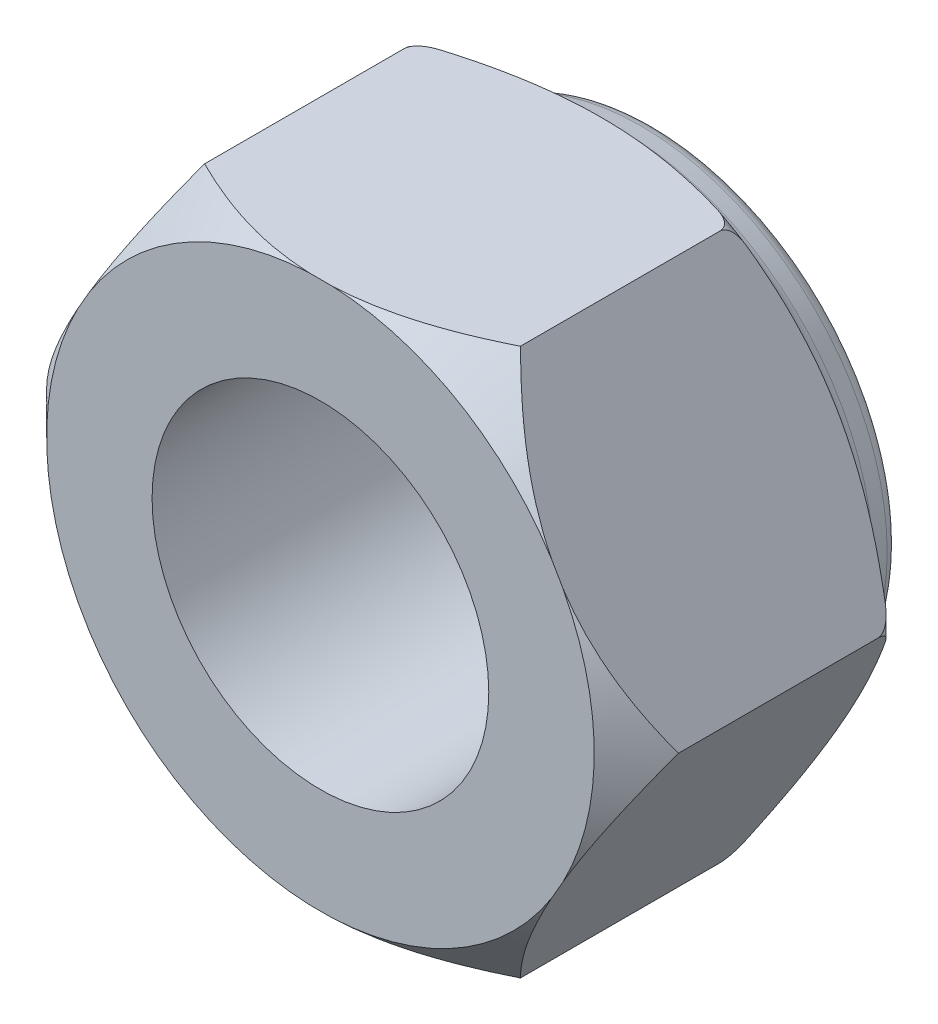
ISO-10303-21;
HEADER;
FILE_DESCRIPTION(('STEP AP214'),'2;1');
FILE_NAME('part.step','',(''),(''),'','','');
FILE_SCHEMA(('AUTOMOTIVE_DESIGN { 1 0 10303 214 1 1 1 1 }'));
ENDSEC;
DATA;
#1=APPLICATION_CONTEXT('core data for automotive mechanical design processes');
#2=APPLICATION_PROTOCOL_DEFINITION('international standard','automotive_design',2000,#1);
#3=PRODUCT_CONTEXT('',#1,'mechanical');
#4=PRODUCT('Part','Part','',(#3));
#5=PRODUCT_RELATED_PRODUCT_CATEGORY('part','',(#4));
#6=PRODUCT_DEFINITION_FORMATION('','',#4);
#7=PRODUCT_DEFINITION_CONTEXT('part definition',#1,'design');
#8=PRODUCT_DEFINITION('design','',#6,#7);
#9=PRODUCT_DEFINITION_SHAPE('','',#8);
#10=(LENGTH_UNIT() NAMED_UNIT(*) SI_UNIT(.MILLI.,.METRE.));
#11=(NAMED_UNIT(*) PLANE_ANGLE_UNIT() SI_UNIT($,.RADIAN.));
#12=(NAMED_UNIT(*) SI_UNIT($,.STERADIAN.) SOLID_ANGLE_UNIT());
#13=UNCERTAINTY_MEASURE_WITH_UNIT(LENGTH_MEASURE(1.E-05),#10,'distance_accuracy_value','');
#14=(GEOMETRIC_REPRESENTATION_CONTEXT(3) GLOBAL_UNCERTAINTY_ASSIGNED_CONTEXT((#13)) GLOBAL_UNIT_ASSIGNED_CONTEXT((#10,
#11,#12)) REPRESENTATION_CONTEXT('',''));
#15=CARTESIAN_POINT('',(0.,0.,0.));
#16=DIRECTION('',(0.,0.,1.));
#17=DIRECTION('',(1.,0.,0.));
#18=AXIS2_PLACEMENT_3D('',#15,#16,#17);
#19=CARTESIAN_POINT('',(3.75277674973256,-6.50000000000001,8.));
#20=DIRECTION('',(-0.866025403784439,0.5,0.));
#21=DIRECTION('',(-0.499999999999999,-0.866025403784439,0.));
#22=AXIS2_PLACEMENT_3D('',#19,#20,#21);
#23=PLANE('',#22);
#24=CARTESIAN_POINT('',(1.12968586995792,-11.0433266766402,3.40459614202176));
#25=CARTESIAN_POINT('',(1.2185687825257,-10.8893769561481,3.54868463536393));
#26=CARTESIAN_POINT('',(1.30780369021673,-10.7348175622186,3.69191243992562));
#27=CARTESIAN_POINT('',(1.4870992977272,-10.4242684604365,3.97631743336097));
#28=CARTESIAN_POINT('',(1.57716007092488,-10.2682786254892,4.11749443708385));
#29=CARTESIAN_POINT('',(1.75842634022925,-9.95431623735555,4.39777201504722));
#30=CARTESIAN_POINT('',(1.84963403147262,-9.79633988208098,4.53686692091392));
#31=CARTESIAN_POINT('',(2.03312342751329,-9.47852692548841,4.81218789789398));
#32=CARTESIAN_POINT('',(2.12540510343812,-9.318690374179,4.94841404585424));
#33=CARTESIAN_POINT('',(2.31376666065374,-8.99243858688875,5.22115169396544));
#34=CARTESIAN_POINT('',(2.40988116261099,-8.82596338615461,5.35756778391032));
#35=CARTESIAN_POINT('',(2.60362499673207,-8.4903892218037,5.62602381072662));
#36=CARTESIAN_POINT('',(2.70125427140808,-8.32129035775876,5.75806391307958));
#37=CARTESIAN_POINT('',(2.89819131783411,-7.98018538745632,6.01668899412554));
#38=CARTESIAN_POINT('',(2.99749760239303,-7.80818185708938,6.14327848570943));
#39=CARTESIAN_POINT('',(3.19813203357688,-7.46067282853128,6.38985078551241));
#40=CARTESIAN_POINT('',(3.2994599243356,-7.28516777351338,6.50983442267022));
#41=CARTESIAN_POINT('',(3.50721533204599,-6.92532485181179,6.74472132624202));
#42=CARTESIAN_POINT('',(3.6137066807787,-6.7408764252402,6.85940026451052));
#43=CARTESIAN_POINT('',(3.82949228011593,-6.36712480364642,7.07785828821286));
#44=CARTESIAN_POINT('',(3.93878692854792,-6.17782091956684,7.18163581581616));
#45=CARTESIAN_POINT('',(4.15982456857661,-5.79497249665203,7.37487713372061));
#46=CARTESIAN_POINT('',(4.27155118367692,-5.6014563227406,7.4644150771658));
#47=CARTESIAN_POINT('',(4.49807675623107,-5.20910252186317,7.62639894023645));
#48=CARTESIAN_POINT('',(4.61287477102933,-5.01026652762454,7.69885003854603));
#49=CARTESIAN_POINT('',(4.82245592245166,-4.64726132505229,7.81072478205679));
#50=CARTESIAN_POINT('',(4.91674364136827,-4.48395020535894,7.85384004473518));
#51=CARTESIAN_POINT('',(5.10675662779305,-4.15483805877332,7.92476075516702));
#52=CARTESIAN_POINT('',(5.20248168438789,-3.98903739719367,7.95256842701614));
#53=CARTESIAN_POINT('',(5.39461762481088,-3.65624818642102,7.99144611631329));
#54=CARTESIAN_POINT('',(5.49102698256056,-3.48926228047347,8.00254587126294));
#55=CARTESIAN_POINT('',(5.68395930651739,-3.15509369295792,8.00749252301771));
#56=CARTESIAN_POINT('',(5.78048227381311,-2.98791100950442,8.00133925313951));
#57=CARTESIAN_POINT('',(5.97263366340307,-2.65509503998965,7.97215863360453));
#58=CARTESIAN_POINT('',(6.06826372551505,-2.48945891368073,7.94917378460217));
#59=CARTESIAN_POINT('',(6.25824534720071,-2.16040109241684,7.88756324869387));
#60=CARTESIAN_POINT('',(6.35259679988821,-1.99697958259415,7.84893626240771));
#61=CARTESIAN_POINT('',(6.53986761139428,-1.67261702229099,7.75763503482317));
#62=CARTESIAN_POINT('',(6.63278175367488,-1.5116850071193,7.70491850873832));
#63=CARTESIAN_POINT('',(6.81665954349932,-1.1931993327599,7.58744691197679));
#64=CARTESIAN_POINT('',(6.90762328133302,-1.03564551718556,7.52269239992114));
#65=CARTESIAN_POINT('',(7.11932785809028,-0.668962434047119,7.35838995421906));
#66=CARTESIAN_POINT('',(7.23924787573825,-0.461254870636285,7.254628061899));
#67=CARTESIAN_POINT('',(7.47570766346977,-0.0516945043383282,7.03258564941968));
#68=CARTESIAN_POINT('',(7.59224551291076,0.150154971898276,6.91429707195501));
#69=CARTESIAN_POINT('',(7.82250482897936,0.548975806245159,6.66621331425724));
#70=CARTESIAN_POINT('',(7.93621998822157,0.745936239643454,6.53639489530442));
#71=CARTESIAN_POINT('',(8.16097940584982,1.13523097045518,6.26796602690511));
#72=CARTESIAN_POINT('',(8.27202414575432,1.32756610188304,6.12935717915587));
#73=CARTESIAN_POINT('',(8.49236965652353,1.70921572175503,5.84452754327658));
#74=CARTESIAN_POINT('',(8.60165988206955,1.8985119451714,5.69827427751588));
#75=CARTESIAN_POINT('',(8.8183140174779,2.27376791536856,5.40017211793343));
#76=CARTESIAN_POINT('',(8.92567785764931,2.45972754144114,5.24832302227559));
#77=CARTESIAN_POINT('',(9.13865865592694,2.82862110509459,4.94027391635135));
#78=CARTESIAN_POINT('',(9.24427731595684,3.01155799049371,4.78407859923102));
#79=CARTESIAN_POINT('',(9.45412435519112,3.37502372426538,4.46801397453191));
#80=CARTESIAN_POINT('',(9.55835276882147,3.55555263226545,4.30814475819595));
#81=CARTESIAN_POINT('',(9.74056746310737,3.87115774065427,4.02438976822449));
#82=CARTESIAN_POINT('',(9.81880568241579,4.00667031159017,3.90114938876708));
#83=CARTESIAN_POINT('',(9.97433077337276,4.27604767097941,3.65368423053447));
#84=CARTESIAN_POINT('',(10.051620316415,4.40991708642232,3.5294661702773));
#85=CARTESIAN_POINT('',(10.1286443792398,4.54332667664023,3.40459614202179));
#86=B_SPLINE_CURVE_WITH_KNOTS('',3,(#24,#25,#26,#27,#28,#29,#30,#31,#32,#33,#34,#35,#36,#37,#38,
#39,#40,#41,#42,#43,#44,#45,#46,#47,#48,#49,#50,#51,#52,#53,#54,#55,#56,#57,#58,#59,#60,#61,#62,
#63,#64,#65,#66,#67,#68,#69,#70,#71,#72,#73,#74,#75,#76,#77,#78,#79,#80,#81,#82,#83,#84,#85),
.UNSPECIFIED.,.F.,.F.,(4,2,2,2,2,2,2,2,2,2,2,2,2,2,2,2,2,2,2,2,2,2,2,2,2,2,2,2,2,2,4),(0.,
0.686488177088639,1.37303795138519,2.06120340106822,2.74935039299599,3.45644398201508,
4.16351080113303,4.86998047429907,5.57636129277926,6.30179544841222,7.02733312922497,
7.74895922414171,8.47036632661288,9.05013970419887,9.62982882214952,10.2084849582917,
10.7871466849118,11.3643522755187,11.941605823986,12.52061163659,13.0995905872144,
13.8829026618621,14.6666511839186,15.4520168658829,16.2372398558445,17.0261239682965,
17.8150365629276,18.6031280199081,19.3911999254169,19.9887336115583,20.5836377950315),.UNSPECIFIED.);
#87=CARTESIAN_POINT('',(3.75277674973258,-6.50000000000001,7.));
#88=VERTEX_POINT('',#87);
#89=CARTESIAN_POINT('',(5.49479033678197,-3.48274395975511,8.));
#90=VERTEX_POINT('',#89);
#91=EDGE_CURVE('E356',#88,#90,#86,.T.);
#92=ORIENTED_EDGE('',*,*,#91,.F.);
#93=DIRECTION('',(0.,0.,-1.));
#94=VECTOR('',#93,1.);
#95=CARTESIAN_POINT('',(3.75277674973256,-6.50000000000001,8.));
#96=LINE('',#95,#94);
#97=CARTESIAN_POINT('',(3.75277674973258,-6.50000000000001,2.26814027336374));
#98=VERTEX_POINT('',#97);
#99=EDGE_CURVE('E187',#88,#98,#96,.T.);
#100=ORIENTED_EDGE('',*,*,#99,.T.);
#101=CARTESIAN_POINT('',(5.49429522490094,-3.48360151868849,2.27454187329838));
#102=CARTESIAN_POINT('',(5.49445133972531,-3.48333111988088,2.27353779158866));
#103=CARTESIAN_POINT('',(5.49457260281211,-3.48312108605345,2.27251097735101));
#104=CARTESIAN_POINT('',(5.49473920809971,-3.48283251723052,2.27043660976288));
#105=CARTESIAN_POINT('',(5.49478479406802,-3.48275356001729,2.26938913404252));
#106=CARTESIAN_POINT('',(5.49479640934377,-3.48273344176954,2.26698078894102));
#107=CARTESIAN_POINT('',(5.49473487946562,-3.48284001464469,2.26561897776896));
#108=CARTESIAN_POINT('',(5.49448555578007,-3.4832718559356,2.26294367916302));
#109=CARTESIAN_POINT('',(5.49429763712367,-3.48359734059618,2.26163024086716));
#110=CARTESIAN_POINT('',(5.49374870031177,-3.48454812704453,2.25870061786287));
#111=CARTESIAN_POINT('',(5.49335274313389,-3.48523394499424,2.2571111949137));
#112=CARTESIAN_POINT('',(5.49244260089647,-3.48681035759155,2.25407357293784));
#113=CARTESIAN_POINT('',(5.49192801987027,-3.48770163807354,2.25262587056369));
#114=CARTESIAN_POINT('',(5.49003298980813,-3.49098392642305,2.24787088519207));
#115=CARTESIAN_POINT('',(5.48846710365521,-3.49369612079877,2.24486664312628));
#116=CARTESIAN_POINT('',(5.48514663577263,-3.4994473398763,2.23931001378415));
#117=CARTESIAN_POINT('',(5.48339086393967,-3.50248842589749,2.23676077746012));
#118=CARTESIAN_POINT('',(5.47421415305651,-3.51838295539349,2.22439982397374));
#119=CARTESIAN_POINT('',(5.46613837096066,-3.53237062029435,2.21662853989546));
#120=CARTESIAN_POINT('',(5.44977897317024,-3.5607059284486,2.20222561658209));
#121=CARTESIAN_POINT('',(5.44149473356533,-3.57505465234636,2.19559802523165));
#122=CARTESIAN_POINT('',(5.4166514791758,-3.6180844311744,2.17679237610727));
#123=CARTESIAN_POINT('',(5.39990887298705,-3.64708347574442,2.16551149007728));
#124=CARTESIAN_POINT('',(5.36628869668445,-3.70531532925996,2.14378961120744));
#125=CARTESIAN_POINT('',(5.34941099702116,-3.73454836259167,2.13334956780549));
#126=CARTESIAN_POINT('',(5.3156173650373,-3.79308065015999,2.1130555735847));
#127=CARTESIAN_POINT('',(5.29870169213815,-3.82237945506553,2.10319998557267));
#128=CARTESIAN_POINT('',(5.26482417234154,-3.88105704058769,2.08388061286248));
#129=CARTESIAN_POINT('',(5.24786234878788,-3.91043578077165,2.07441665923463));
#130=CARTESIAN_POINT('',(5.19197959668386,-4.00722754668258,2.04381223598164));
#131=CARTESIAN_POINT('',(5.15296300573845,-4.07480626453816,2.02336118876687));
#132=CARTESIAN_POINT('',(5.07472451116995,-4.21031931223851,1.98404846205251));
#133=CARTESIAN_POINT('',(5.03550256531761,-4.27825371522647,1.96518712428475));
#134=CARTESIAN_POINT('',(4.91737638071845,-4.48285426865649,1.91120895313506));
#135=CARTESIAN_POINT('',(4.83814981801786,-4.62007870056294,1.87877436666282));
#136=CARTESIAN_POINT('',(4.71711080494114,-4.82972442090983,1.83724752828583));
#137=CARTESIAN_POINT('',(4.67561718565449,-4.90159347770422,1.82442869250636));
#138=CARTESIAN_POINT('',(4.59240624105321,-5.04571906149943,1.80217881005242));
#139=CARTESIAN_POINT('',(4.55068896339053,-5.11797550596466,1.79274706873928));
#140=CARTESIAN_POINT('',(4.46718860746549,-5.2626023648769,1.77806629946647));
#141=CARTESIAN_POINT('',(4.42540608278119,-5.33497182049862,1.77280506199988));
#142=CARTESIAN_POINT('',(4.34176828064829,-5.47983674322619,1.76744910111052));
#143=CARTESIAN_POINT('',(4.29991306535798,-5.55233210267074,1.76735113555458));
#144=CARTESIAN_POINT('',(4.22966410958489,-5.67400686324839,1.77275052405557));
#145=CARTESIAN_POINT('',(4.20123842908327,-5.72324158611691,1.77647167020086));
#146=CARTESIAN_POINT('',(4.14449497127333,-5.82152413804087,1.78765519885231));
#147=CARTESIAN_POINT('',(4.11617766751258,-5.87057114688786,1.79512729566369));
#148=CARTESIAN_POINT('',(4.05405046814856,-5.9781786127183,1.81674192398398));
#149=CARTESIAN_POINT('',(4.02032317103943,-6.03659600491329,1.83194859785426));
#150=CARTESIAN_POINT('',(3.97082698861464,-6.12232590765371,1.86164043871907));
#151=CARTESIAN_POINT('',(3.95453804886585,-6.15053917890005,1.87265963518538));
#152=CARTESIAN_POINT('',(3.92250070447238,-6.20602948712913,1.89745914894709));
#153=CARTESIAN_POINT('',(3.90675168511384,-6.23330758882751,1.91123619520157));
#154=CARTESIAN_POINT('',(3.88051809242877,-6.2787455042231,1.93770414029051));
#155=CARTESIAN_POINT('',(3.86982478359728,-6.29726685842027,1.94956307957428));
#156=CARTESIAN_POINT('',(3.84903460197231,-6.33327650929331,1.97529650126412));
#157=CARTESIAN_POINT('',(3.83893842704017,-6.35076359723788,1.98917327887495));
#158=CARTESIAN_POINT('',(3.81955285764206,-6.38434038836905,2.01939521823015));
#159=CARTESIAN_POINT('',(3.81027159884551,-6.40041600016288,2.03576159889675));
#160=CARTESIAN_POINT('',(3.79309177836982,-6.43017232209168,2.07119869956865));
#161=CARTESIAN_POINT('',(3.78519010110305,-6.44385842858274,2.09026314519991));
#162=CARTESIAN_POINT('',(3.77384613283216,-6.46350675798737,2.12411784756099));
#163=CARTESIAN_POINT('',(3.76980700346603,-6.47050273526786,2.13810331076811));
#164=CARTESIAN_POINT('',(3.76287478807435,-6.48250968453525,2.16714198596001));
#165=CARTESIAN_POINT('',(3.75997838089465,-6.4875264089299,2.18219195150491));
#166=CARTESIAN_POINT('',(3.75556644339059,-6.49516810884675,2.21315228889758));
#167=CARTESIAN_POINT('',(3.75405537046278,-6.49778536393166,2.22906526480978));
#168=CARTESIAN_POINT('',(3.75255032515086,-6.5003921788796,2.26135369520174));
#169=CARTESIAN_POINT('',(3.7525739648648,-6.50035123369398,2.27773236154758));
#170=CARTESIAN_POINT('',(3.75344472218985,-6.49884303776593,2.29397507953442));
#171=B_SPLINE_CURVE_WITH_KNOTS('',3,(#101,#102,#103,#104,#105,#106,#107,#108,#109,#110,#111,
#112,#113,#114,#115,#116,#117,#118,#119,#120,#121,#122,#123,#124,#125,#126,#127,#128,#129,#130,
#131,#132,#133,#134,#135,#136,#137,#138,#139,#140,#141,#142,#143,#144,#145,#146,#147,#148,#149,
#150,#151,#152,#153,#154,#155,#156,#157,#158,#159,#160,#161,#162,#163,#164,#165,#166,#167,#168,
#169,#170),.UNSPECIFIED.,.F.,.F.,(4,2,2,2,2,2,2,2,2,2,2,2,2,2,2,2,2,2,2,2,2,2,2,2,2,2,2,2,2,2,2,
2,2,2,4),(0.,0.00315343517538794,0.00629669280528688,0.010370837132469,0.0144490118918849,
0.0197453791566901,0.0250596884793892,0.037977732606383,0.050982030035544,0.104384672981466,
0.157972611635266,0.263870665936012,0.369886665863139,0.475590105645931,0.581247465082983,
0.823229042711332,1.06526250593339,1.55018818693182,1.8020511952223,2.05386252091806,
2.30493389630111,2.55584761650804,2.72666226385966,2.89792159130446,3.10480116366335,
3.20788375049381,3.31084478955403,3.38412230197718,3.45748382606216,3.53150982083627,
3.60536641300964,3.6536575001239,3.70180718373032,3.75011125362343,3.79896974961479),.UNSPECIFIED.);
#172=CARTESIAN_POINT('',(3.98749286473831,-6.09345976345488,1.85164301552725));
#173=VERTEX_POINT('',#172);
#174=EDGE_CURVE('E253',#173,#98,#171,.T.);
#175=ORIENTED_EDGE('',*,*,#174,.F.);
#176=CARTESIAN_POINT('',(7.27117127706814,-0.405961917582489,1.85184301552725));
#177=CARTESIAN_POINT('',(7.18925040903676,-0.547853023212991,1.8027693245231));
#178=CARTESIAN_POINT('',(7.10691425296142,-0.690463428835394,1.75637089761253));
#179=CARTESIAN_POINT('',(6.9414070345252,-0.977130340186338,1.66964963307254));
#180=CARTESIAN_POINT('',(6.85823560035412,-1.12118748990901,1.62932964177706));
#181=CARTESIAN_POINT('',(6.69094780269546,-1.41093845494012,1.55545704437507));
#182=CARTESIAN_POINT('',(6.60682977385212,-1.55663515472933,1.52191939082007));
#183=CARTESIAN_POINT('',(6.43793183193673,-1.8491749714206,1.46246142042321));
#184=CARTESIAN_POINT('',(6.35315202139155,-1.99601791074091,1.43653994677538));
#185=CARTESIAN_POINT('',(6.1854936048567,-2.28641080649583,1.39357678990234));
#186=CARTESIAN_POINT('',(6.10263001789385,-2.42993474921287,1.37630222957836));
#187=CARTESIAN_POINT('',(5.93657730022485,-2.71754649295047,1.34999182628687));
#188=CARTESIAN_POINT('',(5.85338818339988,-2.86163426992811,1.34095563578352));
#189=CARTESIAN_POINT('',(5.68699089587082,-3.1498428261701,1.33137712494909));
#190=CARTESIAN_POINT('',(5.60378288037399,-3.29396333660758,1.33082414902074));
#191=CARTESIAN_POINT('',(5.43746928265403,-3.58202693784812,1.33819734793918));
#192=CARTESIAN_POINT('',(5.35436369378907,-3.72597004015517,1.34612294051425));
#193=CARTESIAN_POINT('',(5.1635487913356,-4.05647114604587,1.37386250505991));
#194=CARTESIAN_POINT('',(5.05594149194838,-4.24285245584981,1.39653071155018));
#195=CARTESIAN_POINT('',(4.84157620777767,-4.61414401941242,1.45487632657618));
#196=CARTESIAN_POINT('',(4.73481863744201,-4.7990535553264,1.49055972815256));
#197=CARTESIAN_POINT('',(4.52044991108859,-5.17035108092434,1.57434564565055));
#198=CARTESIAN_POINT('',(4.41286075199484,-5.35670097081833,1.62267011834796));
#199=CARTESIAN_POINT('',(4.19899819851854,-5.7271217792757,1.72979712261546));
#200=CARTESIAN_POINT('',(4.09272469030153,-5.91119289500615,1.78859874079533));
#201=CARTESIAN_POINT('',(3.98715897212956,-6.09403808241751,1.85184301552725));
#202=B_SPLINE_CURVE_WITH_KNOTS('',3,(#176,#177,#178,#179,#180,#181,#182,#183,#184,#185,#186,
#187,#188,#189,#190,#191,#192,#193,#194,#195,#196,#197,#198,#199,#200,#201),.UNSPECIFIED.,.F.,
.F.,(4,2,2,2,2,2,2,2,2,2,2,2,4),(0.,0.513118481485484,1.02647649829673,1.54095422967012,
2.05535377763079,2.55503330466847,3.05469175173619,3.55372253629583,4.05271905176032,
4.7014861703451,5.3505524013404,6.01188492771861,6.67315982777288),.UNSPECIFIED.);
#203=CARTESIAN_POINT('',(7.2708373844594,-0.406540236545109,1.85164301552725));
#204=VERTEX_POINT('',#203);
#205=EDGE_CURVE('E394',#204,#173,#202,.T.);
#206=ORIENTED_EDGE('',*,*,#205,.F.);
#207=CARTESIAN_POINT('',(7.4991207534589,-0.0111418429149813,2.34803517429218));
#208=CARTESIAN_POINT('',(7.50122053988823,-0.00750490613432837,2.33518469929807));
#209=CARTESIAN_POINT('',(7.50282699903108,-0.00472243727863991,2.32200088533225));
#210=CARTESIAN_POINT('',(7.50498926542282,-0.000977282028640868,2.29532594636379));
#211=CARTESIAN_POINT('',(7.50554747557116,-1.04336904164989E-05,2.28183559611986));
#212=CARTESIAN_POINT('',(7.50556009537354,1.14244484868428E-05,2.25337447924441));
#213=CARTESIAN_POINT('',(7.50488760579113,-0.00115336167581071,2.23840256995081));
#214=CARTESIAN_POINT('',(7.50225417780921,-0.00571459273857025,2.2089309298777));
#215=CARTESIAN_POINT('',(7.50029309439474,-0.00911128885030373,2.1944312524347));
#216=CARTESIAN_POINT('',(7.49526822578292,-0.017814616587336,2.16634403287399));
#217=CARTESIAN_POINT('',(7.49221205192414,-0.02310806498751,2.15275094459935));
#218=CARTESIAN_POINT('',(7.48519517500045,-0.0352616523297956,2.12653923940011));
#219=CARTESIAN_POINT('',(7.4812337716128,-0.0421230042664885,2.11392138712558));
#220=CARTESIAN_POINT('',(7.46953758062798,-0.0623814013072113,2.0811419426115));
#221=CARTESIAN_POINT('',(7.46111641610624,-0.0769672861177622,2.06196127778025));
#222=CARTESIAN_POINT('',(7.44290670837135,-0.108507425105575,2.02639231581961));
#223=CARTESIAN_POINT('',(7.43311365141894,-0.125469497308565,2.01001364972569));
#224=CARTESIAN_POINT('',(7.40480467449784,-0.1745020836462,1.96808517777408));
#225=CARTESIAN_POINT('',(7.3853467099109,-0.208204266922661,1.94510415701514));
#226=CARTESIAN_POINT('',(7.3450630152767,-0.277977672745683,1.90488197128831));
#227=CARTESIAN_POINT('',(7.32423608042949,-0.314050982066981,1.88764594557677));
#228=CARTESIAN_POINT('',(7.29227778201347,-0.369404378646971,1.86501785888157));
#229=CARTESIAN_POINT('',(7.28142862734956,-0.388195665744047,1.85797599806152));
#230=CARTESIAN_POINT('',(7.25492518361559,-0.43410097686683,1.84212800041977));
#231=CARTESIAN_POINT('',(7.23919207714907,-0.461351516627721,1.833847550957));
#232=CARTESIAN_POINT('',(7.1922054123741,-0.542734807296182,1.8118867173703));
#233=CARTESIAN_POINT('',(7.1606581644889,-0.597376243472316,1.80072949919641));
#234=CARTESIAN_POINT('',(7.09720043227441,-0.707288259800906,1.78362206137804));
#235=CARTESIAN_POINT('',(7.06528954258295,-0.762559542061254,1.77767837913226));
#236=CARTESIAN_POINT('',(7.00122111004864,-0.873529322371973,1.76995132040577));
#237=CARTESIAN_POINT('',(6.96906309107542,-0.929228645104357,1.76818463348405));
#238=CARTESIAN_POINT('',(6.90474294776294,-1.04063440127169,1.76809761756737));
#239=CARTESIAN_POINT('',(6.87258082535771,-1.09634083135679,1.76977838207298));
#240=CARTESIAN_POINT('',(6.79067031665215,-1.23821399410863,1.77771938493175));
#241=CARTESIAN_POINT('',(6.74097134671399,-1.32429513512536,1.78598879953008));
#242=CARTESIAN_POINT('',(6.64205890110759,-1.49561651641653,1.80779454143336));
#243=CARTESIAN_POINT('',(6.59284432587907,-1.58085866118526,1.82131197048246));
#244=CARTESIAN_POINT('',(6.50267404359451,-1.73703817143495,1.84998261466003));
#245=CARTESIAN_POINT('',(6.461668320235,-1.80806216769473,1.86451895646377));
#246=CARTESIAN_POINT('',(6.37987740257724,-1.94972819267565,1.89600849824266));
#247=CARTESIAN_POINT('',(6.33909228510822,-2.02037008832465,1.91296249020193));
#248=CARTESIAN_POINT('',(6.25752629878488,-2.16164652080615,1.94898346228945));
#249=CARTESIAN_POINT('',(6.21674664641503,-2.23227895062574,1.96806137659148));
#250=CARTESIAN_POINT('',(6.13543652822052,-2.37311220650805,2.00795358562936));
#251=CARTESIAN_POINT('',(6.09490588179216,-2.44331334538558,2.02876640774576));
#252=CARTESIAN_POINT('',(6.03231479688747,-2.55172428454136,2.06236207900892));
#253=CARTESIAN_POINT('',(6.0101714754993,-2.59007764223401,2.07453119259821));
#254=CARTESIAN_POINT('',(5.96592251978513,-2.6667190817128,2.09951731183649));
#255=CARTESIAN_POINT('',(5.94381707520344,-2.7050068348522,2.11233568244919));
#256=CARTESIAN_POINT('',(5.91085918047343,-2.76209158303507,2.1322196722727));
#257=CARTESIAN_POINT('',(5.89995229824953,-2.78098285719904,2.13892734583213));
#258=CARTESIAN_POINT('',(5.87817665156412,-2.81869938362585,2.15267937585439));
#259=CARTESIAN_POINT('',(5.86730793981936,-2.83752454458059,2.15972408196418));
#260=CARTESIAN_POINT('',(5.84571455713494,-2.87492538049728,2.17433045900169));
#261=CARTESIAN_POINT('',(5.83498947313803,-2.89350177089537,2.18188983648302));
#262=CARTESIAN_POINT('',(5.81371243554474,-2.93035468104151,2.19792565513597));
#263=CARTESIAN_POINT('',(5.80316010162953,-2.94863185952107,2.20639963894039));
#264=CARTESIAN_POINT('',(5.78877625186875,-2.97354541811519,2.22033924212));
#265=CARTESIAN_POINT('',(5.78465316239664,-2.98068681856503,2.22462946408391));
#266=CARTESIAN_POINT('',(5.77674383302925,-2.99438617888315,2.23404430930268));
#267=CARTESIAN_POINT('',(5.77295145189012,-3.00095477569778,2.2391427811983));
#268=CARTESIAN_POINT('',(5.76903112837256,-3.00774497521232,2.24660195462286));
#269=CARTESIAN_POINT('',(5.76840751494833,-3.00882510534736,2.24787015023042));
#270=CARTESIAN_POINT('',(5.76722435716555,-3.01087439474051,2.25052771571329));
#271=CARTESIAN_POINT('',(5.76666495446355,-3.01184330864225,2.25191734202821));
#272=CARTESIAN_POINT('',(5.76563369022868,-3.01362951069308,2.25485822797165));
#273=CARTESIAN_POINT('',(5.76516338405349,-3.01444410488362,2.25641173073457));
#274=CARTESIAN_POINT('',(5.76437651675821,-3.01580699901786,2.25966171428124));
#275=CARTESIAN_POINT('',(5.76405884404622,-3.01635722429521,2.2613570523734));
#276=CARTESIAN_POINT('',(5.76370617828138,-3.01696805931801,2.264259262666));
#277=CARTESIAN_POINT('',(5.76361188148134,-3.01713138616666,2.26543706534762));
#278=CARTESIAN_POINT('',(5.7635231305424,-3.01728510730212,2.26782328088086));
#279=CARTESIAN_POINT('',(5.76353004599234,-3.01727312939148,2.26903189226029));
#280=CARTESIAN_POINT('',(5.76359286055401,-3.01716433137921,2.27023204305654));
#281=B_SPLINE_CURVE_WITH_KNOTS('',3,(#207,#208,#209,#210,#211,#212,#213,#214,#215,#216,#217,
#218,#219,#220,#221,#222,#223,#224,#225,#226,#227,#228,#229,#230,#231,#232,#233,#234,#235,#236,
#237,#238,#239,#240,#241,#242,#243,#244,#245,#246,#247,#248,#249,#250,#251,#252,#253,#254,#255,
#256,#257,#258,#259,#260,#261,#262,#263,#264,#265,#266,#267,#268,#269,#270,#271,#272,#273,#274,
#275,#276,#277,#278,#279,#280),.UNSPECIFIED.,.F.,.F.,(4,2,2,2,2,2,2,2,2,2,2,2,2,2,2,2,2,2,2,2,2,
2,2,2,2,2,2,2,2,2,2,2,2,2,2,2,4),(0.,0.0405347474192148,0.0809764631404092,0.12582477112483,
0.170678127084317,0.215225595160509,0.25980764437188,0.335940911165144,0.412330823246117,
0.547156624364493,0.682102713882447,0.750518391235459,0.848068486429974,1.03996740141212,
1.23210660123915,1.42501222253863,1.61797904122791,1.91699967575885,2.21495336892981,
2.46478114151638,2.71469094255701,2.96595264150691,3.21700319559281,3.35478545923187,
3.49287049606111,3.5613363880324,3.62987491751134,3.69812583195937,3.76619773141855,
3.794101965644,3.82123985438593,3.8265691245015,3.8319099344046,3.83733677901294,
3.84272347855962,3.84628547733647,3.8498957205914),.UNSPECIFIED.);
#282=CARTESIAN_POINT('',(7.50555349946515,0.,2.26814027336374));
#283=VERTEX_POINT('',#282);
#284=EDGE_CURVE('E304',#283,#204,#281,.T.);
#285=ORIENTED_EDGE('',*,*,#284,.F.);
#286=DIRECTION('',(0.,0.,-1.));
#287=VECTOR('',#286,1.);
#288=CARTESIAN_POINT('',(7.50555349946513,0.,8.));
#289=LINE('',#288,#287);
#290=CARTESIAN_POINT('',(7.50555349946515,0.,7.));
#291=VERTEX_POINT('',#290);
#292=EDGE_CURVE('E196',#291,#283,#289,.T.);
#293=ORIENTED_EDGE('',*,*,#292,.F.);
#294=CARTESIAN_POINT('',(5.76353991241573,-3.01725604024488,8.));
#295=VERTEX_POINT('',#294);
#296=EDGE_CURVE('E468',#295,#291,#86,.T.);
#297=ORIENTED_EDGE('',*,*,#296,.F.);
#298=DIRECTION('',(0.499999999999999,0.866025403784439,0.));
#299=VECTOR('',#298,1.);
#300=CARTESIAN_POINT('',(3.75277674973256,-6.50000000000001,8.));
#301=LINE('',#300,#299);
#302=EDGE_CURVE('E202',#90,#295,#301,.T.);
#303=ORIENTED_EDGE('',*,*,#302,.F.);
#304=EDGE_LOOP('',(#92,#100,#175,#206,#285,#293,#297,#303));
#305=FACE_BOUND('',#304,.T.);
#306=ADVANCED_FACE('F30',(#305),#23,.F.);
#307=CARTESIAN_POINT('',(7.50555349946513,0.,8.));
#308=DIRECTION('',(-0.866025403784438,-0.5,0.));
#309=DIRECTION('',(0.5,-0.866025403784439,0.));
#310=AXIS2_PLACEMENT_3D('',#307,#308,#309);
#311=PLANE('',#310);
#312=CARTESIAN_POINT('',(10.1286443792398,-4.54332667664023,3.40459614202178));
#313=CARTESIAN_POINT('',(10.039761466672,-4.38937695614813,3.54868463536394));
#314=CARTESIAN_POINT('',(9.95052655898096,-4.23481756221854,3.69191243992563));
#315=CARTESIAN_POINT('',(9.77123095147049,-3.92426846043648,3.97631743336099));
#316=CARTESIAN_POINT('',(9.68117017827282,-3.76827862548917,4.11749443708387));
#317=CARTESIAN_POINT('',(9.49990390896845,-3.45431623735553,4.39777201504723));
#318=CARTESIAN_POINT('',(9.40869621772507,-3.29633988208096,4.53686692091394));
#319=CARTESIAN_POINT('',(9.22520682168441,-2.97852692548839,4.812187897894));
#320=CARTESIAN_POINT('',(9.13292514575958,-2.81869037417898,4.94841404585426));
#321=CARTESIAN_POINT('',(8.94456358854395,-2.49243858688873,5.22115169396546));
#322=CARTESIAN_POINT('',(8.8484490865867,-2.32596338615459,5.35756778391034));
#323=CARTESIAN_POINT('',(8.65470525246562,-1.99038922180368,5.62602381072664));
#324=CARTESIAN_POINT('',(8.55707597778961,-1.82129035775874,5.7580639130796));
#325=CARTESIAN_POINT('',(8.36013893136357,-1.48018538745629,6.01668899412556));
#326=CARTESIAN_POINT('',(8.26083264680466,-1.30818185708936,6.14327848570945));
#327=CARTESIAN_POINT('',(8.06019821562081,-0.960672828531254,6.38985078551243));
#328=CARTESIAN_POINT('',(7.95887032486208,-0.785167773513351,6.50983442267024));
#329=CARTESIAN_POINT('',(7.7511149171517,-0.425324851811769,6.74472132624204));
#330=CARTESIAN_POINT('',(7.64462356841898,-0.24087642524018,6.85940026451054));
#331=CARTESIAN_POINT('',(7.42883796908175,0.132875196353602,7.07785828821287));
#332=CARTESIAN_POINT('',(7.31954332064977,0.32217908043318,7.18163581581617));
#333=CARTESIAN_POINT('',(7.09850568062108,0.705027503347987,7.37487713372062));
#334=CARTESIAN_POINT('',(6.98677906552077,0.898543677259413,7.46441507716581));
#335=CARTESIAN_POINT('',(6.76025349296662,1.29089747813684,7.62639894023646));
#336=CARTESIAN_POINT('',(6.64545547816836,1.48973347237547,7.69885003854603));
#337=CARTESIAN_POINT('',(6.43587432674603,1.85273867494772,7.8107247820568));
#338=CARTESIAN_POINT('',(6.34158660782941,2.01604979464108,7.85384004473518));
#339=CARTESIAN_POINT('',(6.15157362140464,2.34516194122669,7.92476075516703));
#340=CARTESIAN_POINT('',(6.0558485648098,2.51096260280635,7.95256842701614));
#341=CARTESIAN_POINT('',(5.86371262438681,2.84375181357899,7.99144611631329));
#342=CARTESIAN_POINT('',(5.76730326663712,3.01073771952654,8.00254587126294));
#343=CARTESIAN_POINT('',(5.5743709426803,3.34490630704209,8.00749252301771));
#344=CARTESIAN_POINT('',(5.47784797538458,3.51208899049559,8.00133925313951));
#345=CARTESIAN_POINT('',(5.28569658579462,3.84490496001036,7.97215863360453));
#346=CARTESIAN_POINT('',(5.19006652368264,4.01054108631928,7.94917378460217));
#347=CARTESIAN_POINT('',(5.00008490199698,4.33959890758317,7.88756324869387));
#348=CARTESIAN_POINT('',(4.90573344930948,4.50302041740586,7.8489362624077));
#349=CARTESIAN_POINT('',(4.71846263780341,4.82738297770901,7.75763503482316));
#350=CARTESIAN_POINT('',(4.62554849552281,4.98831499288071,7.70491850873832));
#351=CARTESIAN_POINT('',(4.44167070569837,5.30680066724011,7.58744691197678));
#352=CARTESIAN_POINT('',(4.35070696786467,5.46435448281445,7.52269239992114));
#353=CARTESIAN_POINT('',(4.13900239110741,5.83103756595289,7.35838995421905));
#354=CARTESIAN_POINT('',(4.01908237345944,6.03874512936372,7.254628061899));
#355=CARTESIAN_POINT('',(3.78262258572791,6.44830549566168,7.03258564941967));
#356=CARTESIAN_POINT('',(3.66608473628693,6.65015497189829,6.914297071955));
#357=CARTESIAN_POINT('',(3.43582542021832,7.04897580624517,6.66621331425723));
#358=CARTESIAN_POINT('',(3.32211026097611,7.24593623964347,6.53639489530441));
#359=CARTESIAN_POINT('',(3.09735084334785,7.6352309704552,6.2679660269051));
#360=CARTESIAN_POINT('',(2.98630610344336,7.82756610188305,6.12935717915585));
#361=CARTESIAN_POINT('',(2.76596059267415,8.20921572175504,5.84452754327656));
#362=CARTESIAN_POINT('',(2.65667036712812,8.39851194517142,5.69827427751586));
#363=CARTESIAN_POINT('',(2.44001623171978,8.77376791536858,5.40017211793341));
#364=CARTESIAN_POINT('',(2.33265239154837,8.95972754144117,5.24832302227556));
#365=CARTESIAN_POINT('',(2.11967159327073,9.32862110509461,4.94027391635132));
#366=CARTESIAN_POINT('',(2.01405293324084,9.51155799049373,4.78407859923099));
#367=CARTESIAN_POINT('',(1.80420589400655,9.87502372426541,4.46801397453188));
#368=CARTESIAN_POINT('',(1.6999774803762,10.0555526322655,4.30814475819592));
#369=CARTESIAN_POINT('',(1.5177627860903,10.3711577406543,4.02438976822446));
#370=CARTESIAN_POINT('',(1.43952456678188,10.5066703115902,3.90114938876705));
#371=CARTESIAN_POINT('',(1.28399947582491,10.7760476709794,3.65368423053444));
#372=CARTESIAN_POINT('',(1.20670993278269,10.9099170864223,3.52946617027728));
#373=CARTESIAN_POINT('',(1.12968586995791,11.0433266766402,3.40459614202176));
#374=B_SPLINE_CURVE_WITH_KNOTS('',3,(#312,#313,#314,#315,#316,#317,#318,#319,#320,#321,#322,
#323,#324,#325,#326,#327,#328,#329,#330,#331,#332,#333,#334,#335,#336,#337,#338,#339,#340,#341,
#342,#343,#344,#345,#346,#347,#348,#349,#350,#351,#352,#353,#354,#355,#356,#357,#358,#359,#360,
#361,#362,#363,#364,#365,#366,#367,#368,#369,#370,#371,#372,#373),.UNSPECIFIED.,.F.,.F.,(4,2,2,
2,2,2,2,2,2,2,2,2,2,2,2,2,2,2,2,2,2,2,2,2,2,2,2,2,2,2,4),(0.,0.686488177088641,1.37303795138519,
2.06120340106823,2.749350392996,3.45644398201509,4.16351080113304,4.86998047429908,
5.57636129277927,6.30179544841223,7.02733312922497,7.74895922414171,8.47036632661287,
9.05013970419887,9.62982882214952,10.2084849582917,10.7871466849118,11.3643522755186,
11.9416058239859,12.52061163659,13.0995905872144,13.8829026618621,14.6666511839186,
15.4520168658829,16.2372398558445,17.0261239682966,17.8150365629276,18.6031280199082,
19.3911999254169,19.9887336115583,20.5836377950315),.UNSPECIFIED.);
#375=CARTESIAN_POINT('',(5.76353991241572,3.01725604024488,8.));
#376=VERTEX_POINT('',#375);
#377=EDGE_CURVE('E332',#291,#376,#374,.T.);
#378=ORIENTED_EDGE('',*,*,#377,.F.);
#379=ORIENTED_EDGE('',*,*,#292,.T.);
#380=CARTESIAN_POINT('',(5.76398641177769,3.01648268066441,2.27421894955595));
#381=CARTESIAN_POINT('',(5.76384557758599,3.01672661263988,2.27326450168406));
#382=CARTESIAN_POINT('',(5.76373635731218,3.01691578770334,2.27229068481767));
#383=CARTESIAN_POINT('',(5.76358624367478,3.01717579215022,2.27032506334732));
#384=CARTESIAN_POINT('',(5.76354516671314,3.0172469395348,2.26933331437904));
#385=CARTESIAN_POINT('',(5.76353386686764,3.01726651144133,2.26698093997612));
#386=CARTESIAN_POINT('',(5.76359536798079,3.01715998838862,2.26561918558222));
#387=CARTESIAN_POINT('',(5.76384465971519,3.01672820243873,2.26294385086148));
#388=CARTESIAN_POINT('',(5.76403259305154,3.01640269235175,2.2616303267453));
#389=CARTESIAN_POINT('',(5.76458156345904,3.0154518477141,2.25870056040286));
#390=CARTESIAN_POINT('',(5.7649775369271,3.01476600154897,2.25711107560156));
#391=CARTESIAN_POINT('',(5.76588768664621,3.01318957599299,2.25407346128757));
#392=CARTESIAN_POINT('',(5.76640224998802,3.01229832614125,2.25262581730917));
#393=CARTESIAN_POINT('',(5.76829723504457,3.00901611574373,2.24787094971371));
#394=CARTESIAN_POINT('',(5.76986308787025,3.00630397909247,2.24486675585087));
#395=CARTESIAN_POINT('',(5.77318354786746,3.00055277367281,2.239310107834));
#396=CARTESIAN_POINT('',(5.77493935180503,2.99751163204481,2.23676082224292));
#397=CARTESIAN_POINT('',(5.78411615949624,2.98161693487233,2.22439973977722));
#398=CARTESIAN_POINT('',(5.7921920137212,2.96762914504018,2.21662840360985));
#399=CARTESIAN_POINT('',(5.80855141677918,2.93929382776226,2.20222550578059));
#400=CARTESIAN_POINT('',(5.81683558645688,2.92494522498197,2.19559797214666));
#401=CARTESIAN_POINT('',(5.84167871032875,2.88191567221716,2.17679242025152));
#402=CARTESIAN_POINT('',(5.85842125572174,2.85291673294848,2.16551157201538));
#403=CARTESIAN_POINT('',(5.89204130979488,2.79468509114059,2.14378976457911));
#404=CARTESIAN_POINT('',(5.90891894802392,2.76545216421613,2.1333497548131));
#405=CARTESIAN_POINT('',(5.94271257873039,2.70691987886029,2.11305575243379));
#406=CARTESIAN_POINT('',(5.9596283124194,2.67762096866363,2.10320012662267));
#407=CARTESIAN_POINT('',(5.99350595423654,2.61894317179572,2.08388068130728));
#408=CARTESIAN_POINT('',(6.01046783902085,2.58956432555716,2.07441669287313));
#409=CARTESIAN_POINT('',(6.06635074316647,2.49277229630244,2.04381218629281));
#410=CARTESIAN_POINT('',(6.10536742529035,2.42519342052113,2.0233610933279));
#411=CARTESIAN_POINT('',(6.18360610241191,2.28968005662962,1.98404828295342));
#412=CARTESIAN_POINT('',(6.22282813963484,2.22174549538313,1.9651869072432));
#413=CARTESIAN_POINT('',(6.34095423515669,2.01714509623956,1.91120880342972));
#414=CARTESIAN_POINT('',(6.42018061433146,1.87992098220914,1.87877430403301));
#415=CARTESIAN_POINT('',(6.54121926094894,1.67027589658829,1.83724759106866));
#416=CARTESIAN_POINT('',(6.58271269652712,1.59840715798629,1.82442880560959));
#417=CARTESIAN_POINT('',(6.66592327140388,1.45428221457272,1.80217899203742));
#418=CARTESIAN_POINT('',(6.70764036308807,1.38202609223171,1.79274726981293));
#419=CARTESIAN_POINT('',(6.79114070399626,1.2373992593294,1.77806642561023));
#420=CARTESIAN_POINT('',(6.83292340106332,1.16502950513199,1.77280512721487));
#421=CARTESIAN_POINT('',(6.91656151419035,1.02016404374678,1.76744911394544));
#422=CARTESIAN_POINT('',(6.95841686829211,0.947668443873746,1.76735116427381));
#423=CARTESIAN_POINT('',(7.02896423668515,0.825476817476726,1.77277339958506));
#424=CARTESIAN_POINT('',(7.05768751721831,0.775726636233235,1.77654969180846));
#425=CARTESIAN_POINT('',(7.11502212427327,0.676420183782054,1.78792984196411));
#426=CARTESIAN_POINT('',(7.14363296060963,0.626864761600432,1.79554369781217));
#427=CARTESIAN_POINT('',(7.20604140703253,0.518770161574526,1.81748075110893));
#428=CARTESIAN_POINT('',(7.23975888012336,0.46036978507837,1.83282501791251));
#429=CARTESIAN_POINT('',(7.28922452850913,0.374692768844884,1.86276614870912));
#430=CARTESIAN_POINT('',(7.30550063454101,0.346501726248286,1.87387534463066));
#431=CARTESIAN_POINT('',(7.33750358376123,0.291070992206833,1.89887402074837));
#432=CARTESIAN_POINT('',(7.35323106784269,0.263830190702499,1.91276011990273));
#433=CARTESIAN_POINT('',(7.37919622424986,0.218857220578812,1.93921384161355));
#434=CARTESIAN_POINT('',(7.38965505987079,0.200741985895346,1.95090903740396));
#435=CARTESIAN_POINT('',(7.40999146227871,0.165518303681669,1.97624219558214));
#436=CARTESIAN_POINT('',(7.41986845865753,0.148410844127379,1.98988202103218));
#437=CARTESIAN_POINT('',(7.43884156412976,0.115548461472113,2.01953095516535));
#438=CARTESIAN_POINT('',(7.44793022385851,0.0998064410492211,2.03555943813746));
#439=CARTESIAN_POINT('',(7.46478668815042,0.0706101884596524,2.07020648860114));
#440=CARTESIAN_POINT('',(7.47255728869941,0.0571511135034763,2.08881941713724));
#441=CARTESIAN_POINT('',(7.48388601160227,0.0375291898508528,2.12215800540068));
#442=CARTESIAN_POINT('',(7.48798802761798,0.0304242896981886,2.1361394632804));
#443=CARTESIAN_POINT('',(7.49505444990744,0.0181848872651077,2.165219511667));
#444=CARTESIAN_POINT('',(7.49801979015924,0.0130487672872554,2.18031717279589));
#445=CARTESIAN_POINT('',(7.50258534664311,0.00514099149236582,2.21149321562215));
#446=CARTESIAN_POINT('',(7.50417195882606,0.00239289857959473,2.22757973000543));
#447=CARTESIAN_POINT('',(7.50575124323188,-0.000342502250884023,2.2600600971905));
#448=CARTESIAN_POINT('',(7.50574638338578,-0.000334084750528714,2.27645343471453));
#449=CARTESIAN_POINT('',(7.50470882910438,0.00146301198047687,2.2976169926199));
#450=CARTESIAN_POINT('',(7.50439194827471,0.00201186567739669,2.30255635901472));
#451=CARTESIAN_POINT('',(7.50361586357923,0.00335608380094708,2.31238075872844));
#452=CARTESIAN_POINT('',(7.50315692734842,0.00415098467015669,2.31726587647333));
#453=CARTESIAN_POINT('',(7.50262906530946,0.00506526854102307,2.32212343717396));
#454=B_SPLINE_CURVE_WITH_KNOTS('',3,(#380,#381,#382,#383,#384,#385,#386,#387,#388,#389,#390,
#391,#392,#393,#394,#395,#396,#397,#398,#399,#400,#401,#402,#403,#404,#405,#406,#407,#408,#409,
#410,#411,#412,#413,#414,#415,#416,#417,#418,#419,#420,#421,#422,#423,#424,#425,#426,#427,#428,
#429,#430,#431,#432,#433,#434,#435,#436,#437,#438,#439,#440,#441,#442,#443,#444,#445,#446,#447,
#448,#449,#450,#451,#452,#453),.UNSPECIFIED.,.F.,.F.,(4,2,2,2,2,2,2,2,2,2,2,2,2,2,2,2,2,2,2,2,2,
2,2,2,2,2,2,2,2,2,2,2,2,2,2,2,4),(0.,0.0029841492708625,0.00596024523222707,0.0100341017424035,
0.0141125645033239,0.0194091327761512,0.0247232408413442,0.0376410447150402,0.0506455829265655,
0.104048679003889,0.157636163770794,0.263533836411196,0.369549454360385,0.475253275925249,
0.580911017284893,0.822893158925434,1.06492718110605,1.54985173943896,1.80171362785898,
2.05352387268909,2.30459616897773,2.55551116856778,2.72811497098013,2.90117079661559,
3.10807742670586,3.21117273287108,3.31414327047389,3.38595648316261,3.45783896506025,
3.5303398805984,3.60268502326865,3.65115581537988,3.69958669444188,3.74849018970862,
3.79731784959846,3.81225176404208,3.8271577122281),.UNSPECIFIED.);
#455=CARTESIAN_POINT('',(7.2708373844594,0.406540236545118,1.85164301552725));
#456=VERTEX_POINT('',#455);
#457=EDGE_CURVE('E299',#456,#283,#454,.T.);
#458=ORIENTED_EDGE('',*,*,#457,.F.);
#459=CARTESIAN_POINT('',(3.98715897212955,6.09403808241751,1.85184301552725));
#460=CARTESIAN_POINT('',(4.06907984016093,5.95214697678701,1.8027693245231));
#461=CARTESIAN_POINT('',(4.15141599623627,5.80953657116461,1.75637089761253));
#462=CARTESIAN_POINT('',(4.31692321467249,5.52286965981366,1.66964963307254));
#463=CARTESIAN_POINT('',(4.40009464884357,5.37881251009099,1.62932964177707));
#464=CARTESIAN_POINT('',(4.56738244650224,5.08906154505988,1.55545704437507));
#465=CARTESIAN_POINT('',(4.65150047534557,4.94336484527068,1.52191939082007));
#466=CARTESIAN_POINT('',(4.82039841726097,4.6508250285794,1.46246142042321));
#467=CARTESIAN_POINT('',(4.90517822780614,4.50398208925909,1.43653994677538));
#468=CARTESIAN_POINT('',(5.072836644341,4.21358919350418,1.39357678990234));
#469=CARTESIAN_POINT('',(5.15570023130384,4.07006525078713,1.37630222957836));
#470=CARTESIAN_POINT('',(5.32175294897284,3.78245350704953,1.34999182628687));
#471=CARTESIAN_POINT('',(5.40494206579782,3.63836573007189,1.34095563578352));
#472=CARTESIAN_POINT('',(5.57133935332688,3.35015717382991,1.33137712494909));
#473=CARTESIAN_POINT('',(5.65454736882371,3.20603666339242,1.33082414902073));
#474=CARTESIAN_POINT('',(5.82086096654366,2.91797306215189,1.33819734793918));
#475=CARTESIAN_POINT('',(5.90396655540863,2.77402995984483,1.34612294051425));
#476=CARTESIAN_POINT('',(6.09478145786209,2.44352885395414,1.3738625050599));
#477=CARTESIAN_POINT('',(6.20238875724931,2.25714754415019,1.39653071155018));
#478=CARTESIAN_POINT('',(6.41675404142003,1.88585598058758,1.45487632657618));
#479=CARTESIAN_POINT('',(6.52351161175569,1.7009464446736,1.49055972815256));
#480=CARTESIAN_POINT('',(6.7378803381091,1.32964891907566,1.57434564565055));
#481=CARTESIAN_POINT('',(6.84546949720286,1.14329902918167,1.62267011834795));
#482=CARTESIAN_POINT('',(7.05933205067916,0.772878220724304,1.72979712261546));
#483=CARTESIAN_POINT('',(7.16560555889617,0.588807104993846,1.78859874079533));
#484=CARTESIAN_POINT('',(7.27117127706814,0.405961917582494,1.85184301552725));
#485=B_SPLINE_CURVE_WITH_KNOTS('',3,(#459,#460,#461,#462,#463,#464,#465,#466,#467,#468,#469,
#470,#471,#472,#473,#474,#475,#476,#477,#478,#479,#480,#481,#482,#483,#484),.UNSPECIFIED.,.F.,
.F.,(4,2,2,2,2,2,2,2,2,2,2,2,4),(0.,0.513118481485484,1.02647649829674,1.54095422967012,
2.05535377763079,2.55503330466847,3.05469175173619,3.55372253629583,4.05271905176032,
4.7014861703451,5.3505524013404,6.01188492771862,6.67315982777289),.UNSPECIFIED.);
#486=CARTESIAN_POINT('',(3.9874928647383,6.09345976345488,1.85164301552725));
#487=VERTEX_POINT('',#486);
#488=EDGE_CURVE('E318',#487,#456,#485,.T.);
#489=ORIENTED_EDGE('',*,*,#488,.F.);
#490=CARTESIAN_POINT('',(3.75341751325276,6.49889016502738,2.29344384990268));
#491=CARTESIAN_POINT('',(3.75299010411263,6.49963045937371,2.2851089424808));
#492=CARTESIAN_POINT('',(3.75277800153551,6.49999783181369,2.2767264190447));
#493=CARTESIAN_POINT('',(3.75277462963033,6.50000367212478,2.25339152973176));
#494=CARTESIAN_POINT('',(3.75344257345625,6.49884675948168,2.2384312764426));
#495=CARTESIAN_POINT('',(3.75607123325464,6.49429378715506,2.20895711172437));
#496=CARTESIAN_POINT('',(3.75803449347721,6.49089332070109,2.19444413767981));
#497=CARTESIAN_POINT('',(3.76306323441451,6.48218328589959,2.16633923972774));
#498=CARTESIAN_POINT('',(3.76612046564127,6.47688800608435,2.15274130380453));
#499=CARTESIAN_POINT('',(3.77313781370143,6.46473360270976,2.12653017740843));
#500=CARTESIAN_POINT('',(3.77709798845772,6.45787437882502,2.11391705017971));
#501=CARTESIAN_POINT('',(3.78879171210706,6.4376202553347,2.0811447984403));
#502=CARTESIAN_POINT('',(3.79721155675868,6.42303665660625,2.06196651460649));
#503=CARTESIAN_POINT('',(3.8154208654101,6.39149720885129,2.026396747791));
#504=CARTESIAN_POINT('',(3.82521520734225,6.37453291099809,2.01001567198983));
#505=CARTESIAN_POINT('',(3.8535259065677,6.32549734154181,1.96808475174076));
#506=CARTESIAN_POINT('',(3.87298420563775,6.29179457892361,1.9451036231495));
#507=CARTESIAN_POINT('',(3.91326801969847,6.2220209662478,1.90488105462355));
#508=CARTESIAN_POINT('',(3.9340946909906,6.18594811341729,1.88764454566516));
#509=CARTESIAN_POINT('',(3.96605239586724,6.13059574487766,1.86501843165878));
#510=CARTESIAN_POINT('',(3.9769014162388,6.11180469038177,1.85797764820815));
#511=CARTESIAN_POINT('',(4.01111326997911,6.05254802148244,1.83751554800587));
#512=CARTESIAN_POINT('',(4.03474759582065,6.01161216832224,1.8258873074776));
#513=CARTESIAN_POINT('',(4.08240208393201,5.92907217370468,1.80629094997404));
#514=CARTESIAN_POINT('',(4.10642267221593,5.88746729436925,1.79832720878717));
#515=CARTESIAN_POINT('',(4.16885689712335,5.7793280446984,1.78161039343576));
#516=CARTESIAN_POINT('',(4.20742345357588,5.71252880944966,1.77514983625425));
#517=CARTESIAN_POINT('',(4.28466988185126,5.57873407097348,1.76801907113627));
#518=CARTESIAN_POINT('',(4.32334977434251,5.51173853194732,1.76734999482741));
#519=CARTESIAN_POINT('',(4.400743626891,5.37768844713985,1.77061348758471));
#520=CARTESIAN_POINT('',(4.43945745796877,5.31063412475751,1.77455673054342));
#521=CARTESIAN_POINT('',(4.51674957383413,5.17676025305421,1.78618754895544));
#522=CARTESIAN_POINT('',(4.55532781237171,5.1099407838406,1.79387629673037));
#523=CARTESIAN_POINT('',(4.6353146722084,4.97139947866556,1.81305698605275));
#524=CARTESIAN_POINT('',(4.67670798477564,4.89970415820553,1.82479990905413));
#525=CARTESIAN_POINT('',(4.75926106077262,4.75671803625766,1.85121598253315));
#526=CARTESIAN_POINT('',(4.80042079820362,4.68542727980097,1.86588945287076));
#527=CARTESIAN_POINT('',(4.88248215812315,4.54329283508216,1.89764411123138));
#528=CARTESIAN_POINT('',(4.92338390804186,4.47244892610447,1.91472399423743));
#529=CARTESIAN_POINT('',(5.0049571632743,4.33115990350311,1.95089467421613));
#530=CARTESIAN_POINT('',(5.04562870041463,4.26071473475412,1.9699851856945));
#531=CARTESIAN_POINT('',(5.11438185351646,4.1416307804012,2.00382530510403));
#532=CARTESIAN_POINT('',(5.14251944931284,4.09289503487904,2.01812270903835));
#533=CARTESIAN_POINT('',(5.19869349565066,3.99559873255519,2.04755292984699));
#534=CARTESIAN_POINT('',(5.22672991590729,3.94703822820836,2.06268597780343));
#535=CARTESIAN_POINT('',(5.28264104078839,3.85019731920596,2.09385416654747));
#536=CARTESIAN_POINT('',(5.31051590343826,3.80191664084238,2.10988815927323));
#537=CARTESIAN_POINT('',(5.35215279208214,3.7297994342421,2.13506337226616));
#538=CARTESIAN_POINT('',(5.3659996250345,3.70581601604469,2.14364055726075));
#539=CARTESIAN_POINT('',(5.39359558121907,3.65801841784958,2.16139680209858));
#540=CARTESIAN_POINT('',(5.40734471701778,3.63420421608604,2.17057578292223));
#541=CARTESIAN_POINT('',(5.43085373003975,3.5934854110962,2.18741729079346));
#542=CARTESIAN_POINT('',(5.44066277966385,3.57649563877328,2.19479470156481));
#543=CARTESIAN_POINT('',(5.45632781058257,3.54936300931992,2.20786580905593));
#544=CARTESIAN_POINT('',(5.46227033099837,3.53907026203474,2.21313491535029));
#545=CARTESIAN_POINT('',(5.47195340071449,3.5222986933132,2.22282423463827));
#546=CARTESIAN_POINT('',(5.47576570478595,3.51569558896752,2.22693900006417));
#547=CARTESIAN_POINT('',(5.48128005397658,3.50614445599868,2.2338606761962));
#548=CARTESIAN_POINT('',(5.48309360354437,3.50300329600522,2.23630847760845));
#549=CARTESIAN_POINT('',(5.48657555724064,3.49697237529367,2.24158546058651));
#550=CARTESIAN_POINT('',(5.48824456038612,3.49408157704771,2.24441293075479));
#551=CARTESIAN_POINT('',(5.49031728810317,3.49049150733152,2.24872885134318));
#552=CARTESIAN_POINT('',(5.49085917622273,3.48955292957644,2.24994788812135));
#553=CARTESIAN_POINT('',(5.49187761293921,3.4877889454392,2.25249552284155));
#554=CARTESIAN_POINT('',(5.49235407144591,3.48696369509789,2.25382426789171));
#555=CARTESIAN_POINT('',(5.49321767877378,3.48546788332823,2.25662473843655));
#556=CARTESIAN_POINT('',(5.49360334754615,3.4847998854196,2.25809834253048));
#557=CARTESIAN_POINT('',(5.49422952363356,3.48371531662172,2.26116076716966));
#558=CARTESIAN_POINT('',(5.49447084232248,3.48329734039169,2.2627488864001));
#559=CARTESIAN_POINT('',(5.49472473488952,3.48285758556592,2.26553831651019));
#560=CARTESIAN_POINT('',(5.49478248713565,3.48275755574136,2.26672316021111));
#561=CARTESIAN_POINT('',(5.49479697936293,3.4827324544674,2.26910944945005));
#562=CARTESIAN_POINT('',(5.4947524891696,3.48280951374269,2.27031092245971));
#563=CARTESIAN_POINT('',(5.49465407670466,3.48297996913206,2.27149640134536));
#564=B_SPLINE_CURVE_WITH_KNOTS('',3,(#490,#491,#492,#493,#494,#495,#496,#497,#498,#499,#500,
#501,#502,#503,#504,#505,#506,#507,#508,#509,#510,#511,#512,#513,#514,#515,#516,#517,#518,#519,
#520,#521,#522,#523,#524,#525,#526,#527,#528,#529,#530,#531,#532,#533,#534,#535,#536,#537,#538,
#539,#540,#541,#542,#543,#544,#545,#546,#547,#548,#549,#550,#551,#552,#553,#554,#555,#556,#557,
#558,#559,#560,#561,#562,#563),.UNSPECIFIED.,.F.,.F.,(4,2,2,2,2,2,2,2,2,2,2,2,2,2,2,2,2,2,2,2,2,
2,2,2,2,2,2,2,2,2,2,2,2,2,2,2,4),(0.,0.0251362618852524,0.0699429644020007,0.114837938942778,
0.159401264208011,0.203967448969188,0.280090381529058,0.356490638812,0.491318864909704,
0.626262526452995,0.694678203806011,0.840494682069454,0.98648483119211,1.21837213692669,
1.45030475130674,1.68277517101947,1.91531839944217,2.16609932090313,2.41690762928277,
2.66758044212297,2.91821770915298,3.09240083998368,3.26663238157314,3.44064672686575,
3.52761730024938,3.61457647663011,3.67742653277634,3.71640793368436,3.74235237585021,
3.75547049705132,3.76853135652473,3.77341835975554,3.77831202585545,3.78328066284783,
3.78822110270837,3.79177561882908,3.79537312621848),.UNSPECIFIED.);
#565=CARTESIAN_POINT('',(3.75277674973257,6.50000000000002,2.26814027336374));
#566=VERTEX_POINT('',#565);
#567=EDGE_CURVE('E294',#566,#487,#564,.T.);
#568=ORIENTED_EDGE('',*,*,#567,.F.);
#569=DIRECTION('',(0.,0.,-1.));
#570=VECTOR('',#569,1.);
#571=CARTESIAN_POINT('',(3.75277674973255,6.50000000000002,8.));
#572=LINE('',#571,#570);
#573=CARTESIAN_POINT('',(3.75277674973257,6.50000000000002,7.));
#574=VERTEX_POINT('',#573);
#575=EDGE_CURVE('E194',#574,#566,#572,.T.);
#576=ORIENTED_EDGE('',*,*,#575,.F.);
#577=CARTESIAN_POINT('',(5.49479033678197,3.48274395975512,8.));
#578=VERTEX_POINT('',#577);
#579=EDGE_CURVE('E325',#578,#574,#374,.T.);
#580=ORIENTED_EDGE('',*,*,#579,.F.);
#581=DIRECTION('',(-0.5,0.866025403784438,0.));
#582=VECTOR('',#581,1.);
#583=CARTESIAN_POINT('',(7.50555349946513,0.,8.));
#584=LINE('',#583,#582);
#585=EDGE_CURVE('E181',#376,#578,#584,.T.);
#586=ORIENTED_EDGE('',*,*,#585,.F.);
#587=EDGE_LOOP('',(#378,#379,#458,#489,#568,#576,#580,#586));
#588=FACE_BOUND('',#587,.T.);
#589=ADVANCED_FACE('F309',(#588),#311,.F.);
#590=CARTESIAN_POINT('',(3.75277674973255,6.50000000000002,8.));
#591=DIRECTION('',(0.,-1.,0.));
#592=DIRECTION('',(0.,0.,-1.));
#593=AXIS2_PLACEMENT_3D('',#590,#591,#592);
#594=PLANE('',#593);
#595=CARTESIAN_POINT('',(8.29610342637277,6.50000000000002,3.96632525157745));
#596=CARTESIAN_POINT('',(8.11036530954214,6.50000000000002,4.11250581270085));
#597=CARTESIAN_POINT('',(7.92373684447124,6.50000000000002,4.25756954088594));
#598=CARTESIAN_POINT('',(7.54835509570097,6.50000000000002,4.54498409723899));
#599=CARTESIAN_POINT('',(7.3596014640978,6.50000000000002,4.68733447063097));
#600=CARTESIAN_POINT('',(6.97873252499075,6.50000000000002,4.96950112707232));
#601=CARTESIAN_POINT('',(6.78660509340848,6.50000000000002,5.1093010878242));
#602=CARTESIAN_POINT('',(6.39953728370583,6.50000000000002,5.38493925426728));
#603=CARTESIAN_POINT('',(6.20459704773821,6.50000000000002,5.5207776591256));
#604=CARTESIAN_POINT('',(5.8017503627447,6.50000000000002,5.79421885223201));
#605=CARTESIAN_POINT('',(5.59367836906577,6.50000000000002,5.93157867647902));
#606=CARTESIAN_POINT('',(5.1732912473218,6.50000000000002,6.19972871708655));
#607=CARTESIAN_POINT('',(4.96097565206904,6.50000000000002,6.33051820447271));
#608=CARTESIAN_POINT('',(4.53185755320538,6.50000000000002,6.58357409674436));
#609=CARTESIAN_POINT('',(4.31506466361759,6.50000000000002,6.70585671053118));
#610=CARTESIAN_POINT('',(3.87593140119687,6.50000000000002,6.9399511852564));
#611=CARTESIAN_POINT('',(3.65359273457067,6.50000000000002,7.05176621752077));
#612=CARTESIAN_POINT('',(3.22593082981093,6.50000000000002,7.25126761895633));
#613=CARTESIAN_POINT('',(3.02121813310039,6.50000000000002,7.34025315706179));
#614=CARTESIAN_POINT('',(2.60646306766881,6.50000000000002,7.50502186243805));
#615=CARTESIAN_POINT('',(2.3964201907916,6.50000000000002,7.58080376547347));
#616=CARTESIAN_POINT('',(1.97356357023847,6.50000000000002,7.71546630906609));
#617=CARTESIAN_POINT('',(1.760809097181,6.50000000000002,7.77453054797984));
#618=CARTESIAN_POINT('',(1.33093571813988,6.50000000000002,7.87398366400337));
#619=CARTESIAN_POINT('',(1.11381737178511,6.50000000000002,7.91437492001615));
#620=CARTESIAN_POINT('',(0.672554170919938,6.50000000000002,7.97457108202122));
#621=CARTESIAN_POINT('',(0.448353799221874,6.50000000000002,7.99397782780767));
#622=CARTESIAN_POINT('',(-0.000845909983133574,6.50000000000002,8.00942901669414));
#623=CARTESIAN_POINT('',(-0.225845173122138,6.50000000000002,8.00547558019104));
#624=CARTESIAN_POINT('',(-0.674887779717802,6.50000000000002,7.9744641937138));
#625=CARTESIAN_POINT('',(-0.898926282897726,6.50000000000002,7.94733749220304));
#626=CARTESIAN_POINT('',(-1.34336613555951,6.50000000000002,7.87180698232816));
#627=CARTESIAN_POINT('',(-1.56376649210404,6.50000000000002,7.8233974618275));
#628=CARTESIAN_POINT('',(-2.06628953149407,6.50000000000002,7.69055568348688));
#629=CARTESIAN_POINT('',(-2.34668289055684,6.50000000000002,7.59963518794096));
#630=CARTESIAN_POINT('',(-2.89824997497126,6.50000000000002,7.39329359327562));
#631=CARTESIAN_POINT('',(-3.16941809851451,6.50000000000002,7.27785790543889));
#632=CARTESIAN_POINT('',(-3.70495151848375,6.50000000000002,7.02757146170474));
#633=CARTESIAN_POINT('',(-3.9692521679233,6.50000000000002,6.89258424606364));
#634=CARTESIAN_POINT('',(-4.49001736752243,6.50000000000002,6.60855044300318));
#635=CARTESIAN_POINT('',(-4.7464837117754,6.50000000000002,6.45950710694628));
#636=CARTESIAN_POINT('',(-5.29071545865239,6.50000000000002,6.12770091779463));
#637=CARTESIAN_POINT('',(-5.57743102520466,6.50000000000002,5.94322742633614));
#638=CARTESIAN_POINT('',(-6.14392762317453,6.50000000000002,5.56387292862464));
#639=CARTESIAN_POINT('',(-6.42370706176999,6.50000000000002,5.36898956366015));
#640=CARTESIAN_POINT('',(-6.97140928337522,6.50000000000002,4.97586119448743));
#641=CARTESIAN_POINT('',(-7.23945723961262,6.50000000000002,4.7777898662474));
#642=CARTESIAN_POINT('',(-7.63813759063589,6.50000000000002,4.47641508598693));
#643=CARTESIAN_POINT('',(-7.77042024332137,6.50000000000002,4.37528153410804));
#644=CARTESIAN_POINT('',(-8.03398507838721,6.50000000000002,4.17172940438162));
#645=CARTESIAN_POINT('',(-8.16526730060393,6.50000000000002,4.06931087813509));
#646=CARTESIAN_POINT('',(-8.29610342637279,6.50000000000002,3.96632525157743));
#647=B_SPLINE_CURVE_WITH_KNOTS('',3,(#595,#596,#597,#598,#599,#600,#601,#602,#603,#604,#605,
#606,#607,#608,#609,#610,#611,#612,#613,#614,#615,#616,#617,#618,#619,#620,#621,#622,#623,#624,
#625,#626,#627,#628,#629,#630,#631,#632,#633,#634,#635,#636,#637,#638,#639,#640,#641,#642,#643,
#644,#645,#646),.UNSPECIFIED.,.F.,.F.,(4,2,2,2,2,2,2,2,2,2,2,2,2,2,2,2,2,2,2,2,2,2,2,2,2,4),(0.,
0.709097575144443,1.41831297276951,2.13109111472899,2.8438333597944,3.59170118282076,
4.33965179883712,5.08613586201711,5.83239302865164,6.50167333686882,7.17101769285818,
7.83269743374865,8.49429285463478,9.16823229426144,9.84211056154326,10.5179950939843,
11.1940611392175,12.0768086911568,12.9600830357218,13.8498492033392,14.7394100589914,
15.7619006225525,16.7846238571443,17.7843881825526,18.2839221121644,18.7834360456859),.UNSPECIFIED.);
#648=CARTESIAN_POINT('',(0.268749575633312,6.50000000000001,8.));
#649=VERTEX_POINT('',#648);
#650=EDGE_CURVE('E333',#574,#649,#647,.T.);
#651=ORIENTED_EDGE('',*,*,#650,.F.);
#652=ORIENTED_EDGE('',*,*,#575,.T.);
#653=CARTESIAN_POINT('',(0.268790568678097,6.50000000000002,2.26683889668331));
#654=CARTESIAN_POINT('',(0.268883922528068,6.50000000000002,2.26536113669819));
#655=CARTESIAN_POINT('',(0.269137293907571,6.50000000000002,2.26389281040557));
#656=CARTESIAN_POINT('',(0.269920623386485,6.50000000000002,2.261031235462));
#657=CARTESIAN_POINT('',(0.270451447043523,6.50000000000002,2.25963823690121));
#658=CARTESIAN_POINT('',(0.271959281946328,6.50000000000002,2.25644646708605));
#659=CARTESIAN_POINT('',(0.273029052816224,6.50000000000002,2.25469259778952));
#660=CARTESIAN_POINT('',(0.275416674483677,6.50000000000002,2.25136530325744));
#661=CARTESIAN_POINT('',(0.27673514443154,6.50000000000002,2.24979234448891));
#662=CARTESIAN_POINT('',(0.282043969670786,6.50000000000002,2.24406721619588));
#663=CARTESIAN_POINT('',(0.286547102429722,6.50000000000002,2.24040561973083));
#664=CARTESIAN_POINT('',(0.295966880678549,6.50000000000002,2.23365848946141));
#665=CARTESIAN_POINT('',(0.300886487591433,6.50000000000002,2.23057769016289));
#666=CARTESIAN_POINT('',(0.317084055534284,6.50000000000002,2.22118171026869));
#667=CARTESIAN_POINT('',(0.328751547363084,6.50000000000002,2.21554038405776));
#668=CARTESIAN_POINT('',(0.35240278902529,6.50000000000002,2.20495420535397));
#669=CARTESIAN_POINT('',(0.364387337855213,6.50000000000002,2.20001136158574));
#670=CARTESIAN_POINT('',(0.400550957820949,6.50000000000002,2.18579846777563));
#671=CARTESIAN_POINT('',(0.424968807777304,6.50000000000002,2.1771304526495));
#672=CARTESIAN_POINT('',(0.49806722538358,6.50000000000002,2.15227135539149));
#673=CARTESIAN_POINT('',(0.547056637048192,6.50000000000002,2.13703953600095));
#674=CARTESIAN_POINT('',(0.64535358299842,6.50000000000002,2.10762446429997));
#675=CARTESIAN_POINT('',(0.694661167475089,6.50000000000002,2.09344138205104));
#676=CARTESIAN_POINT('',(0.793550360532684,6.50000000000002,2.06580824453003));
#677=CARTESIAN_POINT('',(0.843132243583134,6.50000000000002,2.05235917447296));
#678=CARTESIAN_POINT('',(0.94246207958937,6.50000000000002,2.02611368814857));
#679=CARTESIAN_POINT('',(0.992210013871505,6.50000000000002,2.01331720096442));
#680=CARTESIAN_POINT('',(1.12912236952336,6.50000000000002,1.97905331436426));
#681=CARTESIAN_POINT('',(1.21645577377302,6.50000000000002,1.95825533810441));
#682=CARTESIAN_POINT('',(1.39159329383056,6.50000000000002,1.91894808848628));
#683=CARTESIAN_POINT('',(1.47939715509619,6.50000000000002,1.90043768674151));
#684=CARTESIAN_POINT('',(1.65593874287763,6.50000000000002,1.86610586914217));
#685=CARTESIAN_POINT('',(1.74467888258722,6.50000000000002,1.85029671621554));
#686=CARTESIAN_POINT('',(1.92270840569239,6.50000000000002,1.82211197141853));
#687=CARTESIAN_POINT('',(2.01199777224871,6.50000000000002,1.80973627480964));
#688=CARTESIAN_POINT('',(2.19225510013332,6.50000000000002,1.78911421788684));
#689=CARTESIAN_POINT('',(2.28322972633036,6.50000000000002,1.78092408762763));
#690=CARTESIAN_POINT('',(2.46561530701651,6.50000000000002,1.77006682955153));
#691=CARTESIAN_POINT('',(2.55702660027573,6.50000000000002,1.76740509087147));
#692=CARTESIAN_POINT('',(2.7392229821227,6.50000000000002,1.76922274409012));
#693=CARTESIAN_POINT('',(2.83000801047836,6.50000000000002,1.7736526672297));
#694=CARTESIAN_POINT('',(2.96537538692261,6.50000000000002,1.78741812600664));
#695=CARTESIAN_POINT('',(3.01032124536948,6.50000000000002,1.79318468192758));
#696=CARTESIAN_POINT('',(3.09975148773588,6.50000000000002,1.80754373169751));
#697=CARTESIAN_POINT('',(3.14423608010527,6.50000000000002,1.81613488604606));
#698=CARTESIAN_POINT('',(3.23668651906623,6.50000000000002,1.83772858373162));
#699=CARTESIAN_POINT('',(3.28457340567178,6.50000000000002,1.85107717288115));
#700=CARTESIAN_POINT('',(3.3786363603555,6.50000000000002,1.88300224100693));
#701=CARTESIAN_POINT('',(3.42481346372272,6.50000000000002,1.90157549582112));
#702=CARTESIAN_POINT('',(3.49830241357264,6.50000000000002,1.93797660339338));
#703=CARTESIAN_POINT('',(3.52658959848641,6.50000000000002,1.95381681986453));
#704=CARTESIAN_POINT('',(3.58083818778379,6.50000000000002,1.9891203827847));
#705=CARTESIAN_POINT('',(3.60680349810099,6.50000000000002,2.0085774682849));
#706=CARTESIAN_POINT('',(3.64618711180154,6.50000000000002,2.04408331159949));
#707=CARTESIAN_POINT('',(3.66075989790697,6.50000000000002,2.05884202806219));
#708=CARTESIAN_POINT('',(3.68761823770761,6.50000000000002,2.09032651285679));
#709=CARTESIAN_POINT('',(3.69990724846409,6.50000000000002,2.10704924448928));
#710=CARTESIAN_POINT('',(3.71887538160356,6.50000000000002,2.13846446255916));
#711=CARTESIAN_POINT('',(3.72619460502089,6.50000000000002,2.15276665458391));
#712=CARTESIAN_POINT('',(3.73840253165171,6.50000000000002,2.18238010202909));
#713=CARTESIAN_POINT('',(3.7432935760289,6.50000000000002,2.1976903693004));
#714=CARTESIAN_POINT('',(3.75022569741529,6.50000000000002,2.22908751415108));
#715=CARTESIAN_POINT('',(3.75224361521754,6.50000000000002,2.24517963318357));
#716=CARTESIAN_POINT('',(3.75312351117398,6.50000000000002,2.2774493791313));
#717=CARTESIAN_POINT('',(3.75198640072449,6.50000000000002,2.29362698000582));
#718=CARTESIAN_POINT('',(3.74701114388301,6.50000000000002,2.32356396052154));
#719=CARTESIAN_POINT('',(3.74351096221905,6.50000000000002,2.33738180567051));
#720=CARTESIAN_POINT('',(3.73445116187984,6.50000000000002,2.36431793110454));
#721=CARTESIAN_POINT('',(3.72889068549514,6.50000000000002,2.3774359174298));
#722=CARTESIAN_POINT('',(3.71313385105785,6.50000000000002,2.40856463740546));
#723=CARTESIAN_POINT('',(3.70197914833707,6.50000000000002,2.42608875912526));
#724=CARTESIAN_POINT('',(3.6770440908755,6.50000000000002,2.45915478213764));
#725=CARTESIAN_POINT('',(3.66325712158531,6.50000000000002,2.47469152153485));
#726=CARTESIAN_POINT('',(3.6246831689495,6.50000000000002,2.51298349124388));
#727=CARTESIAN_POINT('',(3.59839188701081,6.50000000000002,2.53421032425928));
#728=CARTESIAN_POINT('',(3.54302261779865,6.50000000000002,2.57259085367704));
#729=CARTESIAN_POINT('',(3.51393810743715,6.50000000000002,2.58973467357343));
#730=CARTESIAN_POINT('',(3.45508905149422,6.50000000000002,2.62018916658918));
#731=CARTESIAN_POINT('',(3.42538016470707,6.50000000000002,2.63360925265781));
#732=CARTESIAN_POINT('',(3.36492716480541,6.50000000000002,2.65789863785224));
#733=CARTESIAN_POINT('',(3.33418209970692,6.50000000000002,2.66876551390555));
#734=CARTESIAN_POINT('',(3.24084363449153,6.50000000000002,2.6981996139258));
#735=CARTESIAN_POINT('',(3.1772366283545,6.50000000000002,2.71355789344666));
#736=CARTESIAN_POINT('',(3.06940220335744,6.50000000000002,2.73405213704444));
#737=CARTESIAN_POINT('',(3.02546286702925,6.50000000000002,2.74088609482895));
#738=CARTESIAN_POINT('',(2.93726514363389,6.50000000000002,2.75207644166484));
#739=CARTESIAN_POINT('',(2.89300674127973,6.50000000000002,2.75643271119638));
#740=CARTESIAN_POINT('',(2.75986444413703,6.50000000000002,2.76636222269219));
#741=CARTESIAN_POINT('',(2.67074645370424,6.50000000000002,2.76877348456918));
#742=CARTESIAN_POINT('',(2.4924244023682,6.50000000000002,2.76723523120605));
#743=CARTESIAN_POINT('',(2.40322059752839,6.50000000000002,2.76327142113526));
#744=CARTESIAN_POINT('',(2.22516352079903,6.50000000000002,2.75033052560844));
#745=CARTESIAN_POINT('',(2.13631037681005,6.50000000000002,2.74135175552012));
#746=CARTESIAN_POINT('',(1.94751534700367,6.50000000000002,2.71795585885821));
#747=CARTESIAN_POINT('',(1.84764438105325,6.50000000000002,2.70298071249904));
#748=CARTESIAN_POINT('',(1.64882041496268,6.50000000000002,2.66904755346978));
#749=CARTESIAN_POINT('',(1.54986587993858,6.50000000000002,2.65009836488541));
#750=CARTESIAN_POINT('',(1.38404774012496,6.50000000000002,2.61555444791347));
#751=CARTESIAN_POINT('',(1.31700332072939,6.50000000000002,2.6008141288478));
#752=CARTESIAN_POINT('',(1.18318445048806,6.50000000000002,2.57003173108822));
#753=CARTESIAN_POINT('',(1.11641012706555,6.50000000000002,2.55398909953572));
#754=CARTESIAN_POINT('',(0.960165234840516,6.50000000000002,2.5150131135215));
#755=CARTESIAN_POINT('',(0.870811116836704,6.50000000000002,2.49161172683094));
#756=CARTESIAN_POINT('',(0.722235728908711,6.50000000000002,2.45071309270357));
#757=CARTESIAN_POINT('',(0.662845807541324,6.50000000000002,2.4338306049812));
#758=CARTESIAN_POINT('',(0.564221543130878,6.50000000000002,2.40441400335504));
#759=CARTESIAN_POINT('',(0.524861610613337,6.50000000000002,2.39230415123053));
#760=CARTESIAN_POINT('',(0.459576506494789,6.50000000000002,2.3710246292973));
#761=CARTESIAN_POINT('',(0.433537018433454,6.50000000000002,2.36221667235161));
#762=CARTESIAN_POINT('',(0.390424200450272,6.50000000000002,2.34650999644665));
#763=CARTESIAN_POINT('',(0.373230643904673,6.50000000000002,2.33994179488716));
#764=CARTESIAN_POINT('',(0.344801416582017,6.50000000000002,2.32802716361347));
#765=CARTESIAN_POINT('',(0.33344997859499,6.50000000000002,2.32298003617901));
#766=CARTESIAN_POINT('',(0.314803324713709,6.50000000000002,2.3136434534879));
#767=CARTESIAN_POINT('',(0.307366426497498,6.50000000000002,2.30962367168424));
#768=CARTESIAN_POINT('',(0.292913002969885,6.50000000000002,2.30069619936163));
#769=CARTESIAN_POINT('',(0.285896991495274,6.50000000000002,2.29578745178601));
#770=CARTESIAN_POINT('',(0.278636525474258,6.50000000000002,2.28856110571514));
#771=CARTESIAN_POINT('',(0.277423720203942,6.50000000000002,2.28726302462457));
#772=CARTESIAN_POINT('',(0.275143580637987,6.50000000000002,2.28454182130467));
#773=CARTESIAN_POINT('',(0.274076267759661,6.50000000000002,2.28311868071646));
#774=CARTESIAN_POINT('',(0.27229782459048,6.50000000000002,2.28035044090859));
#775=CARTESIAN_POINT('',(0.271557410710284,6.50000000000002,2.27902452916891));
#776=CARTESIAN_POINT('',(0.270300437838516,6.50000000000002,2.27627042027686));
#777=CARTESIAN_POINT('',(0.269783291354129,6.50000000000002,2.27484250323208));
#778=CARTESIAN_POINT('',(0.2691430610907,6.50000000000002,2.27231135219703));
#779=CARTESIAN_POINT('',(0.268950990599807,6.50000000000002,2.27122569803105));
#780=CARTESIAN_POINT('',(0.268740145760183,6.50000000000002,2.26903792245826));
#781=CARTESIAN_POINT('',(0.268721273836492,6.50000000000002,2.26793581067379));
#782=CARTESIAN_POINT('',(0.268790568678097,6.50000000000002,2.26683889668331));
#783=B_SPLINE_CURVE_WITH_KNOTS('',3,(#653,#654,#655,#656,#657,#658,#659,#660,#661,#662,#663,
#664,#665,#666,#667,#668,#669,#670,#671,#672,#673,#674,#675,#676,#677,#678,#679,#680,#681,#682,
#683,#684,#685,#686,#687,#688,#689,#690,#691,#692,#693,#694,#695,#696,#697,#698,#699,#700,#701,
#702,#703,#704,#705,#706,#707,#708,#709,#710,#711,#712,#713,#714,#715,#716,#717,#718,#719,#720,
#721,#722,#723,#724,#725,#726,#727,#728,#729,#730,#731,#732,#733,#734,#735,#736,#737,#738,#739,
#740,#741,#742,#743,#744,#745,#746,#747,#748,#749,#750,#751,#752,#753,#754,#755,#756,#757,#758,
#759,#760,#761,#762,#763,#764,#765,#766,#767,#768,#769,#770,#771,#772,#773,#774,#775,#776,#777,
#778,#779,#780,#781,#782),.UNSPECIFIED.,.T.,.F.,(4,2,2,2,2,2,2,2,2,2,2,2,2,2,2,2,2,2,2,2,2,2,2,
2,2,2,2,2,2,2,2,2,2,2,2,2,2,2,2,2,2,2,2,2,2,2,2,2,2,2,2,2,2,2,2,2,2,2,2,2,2,2,2,2,4),(0.,
0.00443640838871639,0.00888674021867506,0.0150141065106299,0.0211569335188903,
0.0384296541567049,0.0558376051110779,0.0946220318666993,0.133515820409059,0.211208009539,
0.365096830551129,0.519010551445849,0.673126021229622,0.827224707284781,1.0965241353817,
1.36569019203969,1.6360474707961,1.90639650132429,2.1802878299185,2.45444602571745,
2.72670011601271,2.86257376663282,2.99838307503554,3.14731524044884,3.29615570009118,
3.39322729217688,3.4901323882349,3.55219372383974,3.61416033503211,3.66217869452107,
3.71015066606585,3.75850717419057,3.80684971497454,3.84943235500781,3.89203274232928,
3.9539985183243,4.01612210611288,4.11692441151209,4.21796812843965,4.31561775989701,
4.4133596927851,4.60913829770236,4.74248700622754,4.87584214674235,5.14295527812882,
5.41066819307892,5.67847109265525,5.98132838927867,6.28352020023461,6.48944462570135,
6.6954569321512,6.97253327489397,7.15774869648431,7.28128233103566,7.36372886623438,
7.4189389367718,7.45615850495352,7.48153879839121,7.5069494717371,7.51227107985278,
7.51759347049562,7.52213492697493,7.52666435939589,7.52995927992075,7.5332523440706),.UNSPECIFIED.);
#784=CARTESIAN_POINT('',(3.28334451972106,6.50000000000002,1.85164301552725));
#785=VERTEX_POINT('',#784);
#786=EDGE_CURVE('E290',#785,#566,#783,.T.);
#787=ORIENTED_EDGE('',*,*,#786,.F.);
#788=CARTESIAN_POINT('',(-9.29875982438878,6.50000000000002,4.55042087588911));
#789=CARTESIAN_POINT('',(-9.04022479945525,6.50000000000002,4.40971590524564));
#790=CARTESIAN_POINT('',(-8.78090164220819,6.50000000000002,4.27043308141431));
#791=CARTESIAN_POINT('',(-8.26028387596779,6.50000000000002,3.9954785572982));
#792=CARTESIAN_POINT('',(-7.99898888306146,6.50000000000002,3.85980758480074));
#793=CARTESIAN_POINT('',(-7.47248563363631,6.50000000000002,3.59206154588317));
#794=CARTESIAN_POINT('',(-7.20726310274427,6.50000000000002,3.46001444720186));
#795=CARTESIAN_POINT('',(-6.67410541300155,6.50000000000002,3.20153501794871));
#796=CARTESIAN_POINT('',(-6.40617041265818,6.50000000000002,3.07510236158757));
#797=CARTESIAN_POINT('',(-5.86268771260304,6.50000000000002,2.82728873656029));
#798=CARTESIAN_POINT('',(-5.58708706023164,6.50000000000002,2.70602326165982));
#799=CARTESIAN_POINT('',(-5.031930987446,6.50000000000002,2.47275038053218));
#800=CARTESIAN_POINT('',(-4.75237510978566,6.50000000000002,2.36074405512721));
#801=CARTESIAN_POINT('',(-4.18939264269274,6.50000000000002,2.14884099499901));
#802=CARTESIAN_POINT('',(-3.90597637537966,6.50000000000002,2.04891713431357));
#803=CARTESIAN_POINT('',(-3.33432331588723,6.50000000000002,1.86416888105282));
#804=CARTESIAN_POINT('',(-3.04608814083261,6.50000000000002,1.77933953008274));
#805=CARTESIAN_POINT('',(-2.43890770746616,6.50000000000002,1.62196327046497));
#806=CARTESIAN_POINT('',(-2.11949576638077,6.50000000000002,1.55115916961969));
#807=CARTESIAN_POINT('',(-1.63673793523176,6.50000000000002,1.46567865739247));
#808=CARTESIAN_POINT('',(-1.47519745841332,6.50000000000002,1.44063811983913));
#809=CARTESIAN_POINT('',(-1.15114230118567,6.50000000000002,1.398017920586));
#810=CARTESIAN_POINT('',(-0.9886277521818,6.50000000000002,1.38043727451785));
#811=CARTESIAN_POINT('',(-0.664291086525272,6.50000000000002,1.35328687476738));
#812=CARTESIAN_POINT('',(-0.502474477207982,6.50000000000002,1.34365161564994));
#813=CARTESIAN_POINT('',(-0.178562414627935,6.50000000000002,1.33239654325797));
#814=CARTESIAN_POINT('',(-0.0164669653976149,6.50000000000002,1.33077661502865));
#815=CARTESIAN_POINT('',(0.307571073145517,6.50000000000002,1.33559550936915));
#816=CARTESIAN_POINT('',(0.469513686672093,6.50000000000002,1.34203270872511));
#817=CARTESIAN_POINT('',(0.792894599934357,6.50000000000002,1.36279203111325));
#818=CARTESIAN_POINT('',(0.954332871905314,6.50000000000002,1.3771145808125));
#819=CARTESIAN_POINT('',(1.3102969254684,6.50000000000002,1.41710197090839));
#820=CARTESIAN_POINT('',(1.50462680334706,6.50000000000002,1.4445208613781));
#821=CARTESIAN_POINT('',(1.89157244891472,6.50000000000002,1.50948072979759));
#822=CARTESIAN_POINT('',(2.08418805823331,6.50000000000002,1.54702263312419));
#823=CARTESIAN_POINT('',(2.65969572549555,6.50000000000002,1.67334099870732));
#824=CARTESIAN_POINT('',(3.03963986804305,6.50000000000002,1.77573551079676));
#825=CARTESIAN_POINT('',(3.60758057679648,6.50000000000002,1.95118859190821));
#826=CARTESIAN_POINT('',(3.79884250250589,6.50000000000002,2.01420860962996));
#827=CARTESIAN_POINT('',(4.17927328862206,6.50000000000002,2.14637847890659));
#828=CARTESIAN_POINT('',(4.36844195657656,6.50000000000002,2.21552888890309));
#829=CARTESIAN_POINT('',(4.74385003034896,6.50000000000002,2.35865693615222));
#830=CARTESIAN_POINT('',(4.93009932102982,6.50000000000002,2.43260887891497));
#831=CARTESIAN_POINT('',(5.30073653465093,6.50000000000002,2.58486901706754));
#832=CARTESIAN_POINT('',(5.48512507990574,6.50000000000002,2.6631756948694));
#833=CARTESIAN_POINT('',(5.66870420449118,6.50000000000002,2.74329770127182));
#834=B_SPLINE_CURVE_WITH_KNOTS('',3,(#788,#789,#790,#791,#792,#793,#794,#795,#796,#797,#798,
#799,#800,#801,#802,#803,#804,#805,#806,#807,#808,#809,#810,#811,#812,#813,#814,#815,#816,#817,
#818,#819,#820,#821,#822,#823,#824,#825,#826,#827,#828,#829,#830,#831,#832,#833),.UNSPECIFIED.,
.F.,.F.,(4,2,2,2,2,2,2,2,2,2,2,2,2,2,2,2,2,2,2,2,2,2,4),(0.,0.88304533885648,1.76626728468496,
2.65504166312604,3.54376440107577,4.44693060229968,5.35020208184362,6.25140644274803,
7.15231421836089,8.1326684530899,8.62293288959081,9.11313261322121,9.59924931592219,
10.0853590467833,10.5713708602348,11.0574089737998,11.645861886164,12.2343686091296,
13.4132140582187,14.0172866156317,14.62141425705,15.2225399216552,15.8234573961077),.UNSPECIFIED.);
#835=CARTESIAN_POINT('',(-3.28334451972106,6.50000000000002,1.85164301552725));
#836=VERTEX_POINT('',#835);
#837=EDGE_CURVE('E380',#836,#785,#834,.T.);
#838=ORIENTED_EDGE('',*,*,#837,.F.);
#839=CARTESIAN_POINT('',(-3.5804323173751,6.50000000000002,1.98974863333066));
#840=CARTESIAN_POINT('',(-3.54619634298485,6.50000000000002,1.9650968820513));
#841=CARTESIAN_POINT('',(-3.50960494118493,6.50000000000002,1.94371229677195));
#842=CARTESIAN_POINT('',(-3.43387433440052,6.50000000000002,1.90593462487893));
#843=CARTESIAN_POINT('',(-3.39472465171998,6.50000000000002,1.88956385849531));
#844=CARTESIAN_POINT('',(-3.311503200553,6.50000000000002,1.85953579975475));
#845=CARTESIAN_POINT('',(-3.26730145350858,6.50000000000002,1.84624403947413));
#846=CARTESIAN_POINT('',(-3.17792528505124,6.50000000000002,1.82338973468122));
#847=CARTESIAN_POINT('',(-3.13274984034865,6.50000000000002,1.8138313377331));
#848=CARTESIAN_POINT('',(-3.04179897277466,6.50000000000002,1.79776411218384));
#849=CARTESIAN_POINT('',(-2.99602272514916,6.50000000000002,1.79126005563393));
#850=CARTESIAN_POINT('',(-2.90421057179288,6.50000000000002,1.78082524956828));
#851=CARTESIAN_POINT('',(-2.85817480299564,6.50000000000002,1.77689325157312));
#852=CARTESIAN_POINT('',(-2.74199185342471,6.50000000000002,1.76973302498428));
#853=CARTESIAN_POINT('',(-2.67175717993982,6.50000000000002,1.76793444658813));
#854=CARTESIAN_POINT('',(-2.53128838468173,6.50000000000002,1.76838262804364));
#855=CARTESIAN_POINT('',(-2.46105428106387,6.50000000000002,1.77063142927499));
#856=CARTESIAN_POINT('',(-2.32065311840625,6.50000000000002,1.77846455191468));
#857=CARTESIAN_POINT('',(-2.25048640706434,6.50000000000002,1.7840548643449));
#858=CARTESIAN_POINT('',(-2.11042639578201,6.50000000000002,1.79802191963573));
#859=CARTESIAN_POINT('',(-2.04053314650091,6.50000000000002,1.80639915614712));
#860=CARTESIAN_POINT('',(-1.83081144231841,6.50000000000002,1.83510161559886));
#861=CARTESIAN_POINT('',(-1.69146732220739,6.50000000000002,1.85896117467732));
#862=CARTESIAN_POINT('',(-1.41428637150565,6.50000000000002,1.91336138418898));
#863=CARTESIAN_POINT('',(-1.27644815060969,6.50000000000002,1.94389520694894));
#864=CARTESIAN_POINT('',(-1.08040961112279,6.50000000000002,1.99115178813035));
#865=CARTESIAN_POINT('',(-1.02169939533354,6.50000000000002,2.00579931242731));
#866=CARTESIAN_POINT('',(-0.904488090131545,6.50000000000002,2.03598854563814));
#867=CARTESIAN_POINT('',(-0.845987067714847,6.50000000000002,2.05153051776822));
#868=CARTESIAN_POINT('',(-0.729419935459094,6.50000000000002,2.0835647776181));
#869=CARTESIAN_POINT('',(-0.671353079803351,6.50000000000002,2.10005440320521));
#870=CARTESIAN_POINT('',(-0.555601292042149,6.50000000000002,2.1343107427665));
#871=CARTESIAN_POINT('',(-0.497916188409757,6.50000000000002,2.15207683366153));
#872=CARTESIAN_POINT('',(-0.417372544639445,6.50000000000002,2.179842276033));
#873=CARTESIAN_POINT('',(-0.393978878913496,6.50000000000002,2.18826650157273));
#874=CARTESIAN_POINT('',(-0.357240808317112,6.50000000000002,2.20291173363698));
#875=CARTESIAN_POINT('',(-0.34370722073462,6.50000000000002,2.20862070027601));
#876=CARTESIAN_POINT('',(-0.321749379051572,6.50000000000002,2.21904802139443));
#877=CARTESIAN_POINT('',(-0.313162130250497,6.50000000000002,2.22343639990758));
#878=CARTESIAN_POINT('',(-0.296857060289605,6.50000000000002,2.23293955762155));
#879=CARTESIAN_POINT('',(-0.28911723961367,6.50000000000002,2.23800737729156));
#880=CARTESIAN_POINT('',(-0.28092532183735,6.50000000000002,2.24543878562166));
#881=CARTESIAN_POINT('',(-0.279564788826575,6.50000000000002,2.24675614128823));
#882=CARTESIAN_POINT('',(-0.276974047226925,6.50000000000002,2.2495211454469));
#883=CARTESIAN_POINT('',(-0.275744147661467,6.50000000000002,2.25096908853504));
#884=CARTESIAN_POINT('',(-0.273465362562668,6.50000000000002,2.25404148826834));
#885=CARTESIAN_POINT('',(-0.272419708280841,6.50000000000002,2.25566841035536));
#886=CARTESIAN_POINT('',(-0.270657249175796,6.50000000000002,2.25909049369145));
#887=CARTESIAN_POINT('',(-0.26993860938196,6.50000000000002,2.26088464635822));
#888=CARTESIAN_POINT('',(-0.269151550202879,6.50000000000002,2.26390176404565));
#889=CARTESIAN_POINT('',(-0.268940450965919,6.50000000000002,2.26508727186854));
#890=CARTESIAN_POINT('',(-0.268725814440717,6.50000000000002,2.26747718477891));
#891=CARTESIAN_POINT('',(-0.268722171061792,6.50000000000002,2.26868157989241));
#892=CARTESIAN_POINT('',(-0.268922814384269,6.50000000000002,2.27107037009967));
#893=CARTESIAN_POINT('',(-0.269126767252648,6.50000000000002,2.27225479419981));
#894=CARTESIAN_POINT('',(-0.269718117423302,6.50000000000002,2.27457669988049));
#895=CARTESIAN_POINT('',(-0.270105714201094,6.50000000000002,2.2757141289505));
#896=CARTESIAN_POINT('',(-0.271278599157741,6.50000000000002,2.27852440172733));
#897=CARTESIAN_POINT('',(-0.272165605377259,6.50000000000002,2.28015429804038));
#898=CARTESIAN_POINT('',(-0.274174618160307,6.50000000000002,2.28326155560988));
#899=CARTESIAN_POINT('',(-0.275297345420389,6.50000000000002,2.28473842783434));
#900=CARTESIAN_POINT('',(-0.279600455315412,6.50000000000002,2.28982178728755));
#901=CARTESIAN_POINT('',(-0.283202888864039,6.50000000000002,2.29306160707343));
#902=CARTESIAN_POINT('',(-0.290803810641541,6.50000000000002,2.29904116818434));
#903=CARTESIAN_POINT('',(-0.294805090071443,6.50000000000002,2.30177693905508));
#904=CARTESIAN_POINT('',(-0.316753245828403,6.50000000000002,2.3157458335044));
#905=CARTESIAN_POINT('',(-0.336199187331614,6.50000000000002,2.32450282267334));
#906=CARTESIAN_POINT('',(-0.375468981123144,6.50000000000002,2.34079823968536));
#907=CARTESIAN_POINT('',(-0.395293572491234,6.50000000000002,2.34833393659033));
#908=CARTESIAN_POINT('',(-0.454690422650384,6.50000000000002,2.36976588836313));
#909=CARTESIAN_POINT('',(-0.494648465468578,6.50000000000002,2.38269017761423));
#910=CARTESIAN_POINT('',(-0.57484011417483,6.50000000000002,2.40764959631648));
#911=CARTESIAN_POINT('',(-0.615073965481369,6.50000000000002,2.41968377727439));
#912=CARTESIAN_POINT('',(-0.695717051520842,6.50000000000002,2.44311607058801));
#913=CARTESIAN_POINT('',(-0.73612619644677,6.50000000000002,2.45451447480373));
#914=CARTESIAN_POINT('',(-0.817050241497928,6.50000000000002,2.47683194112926));
#915=CARTESIAN_POINT('',(-0.857565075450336,6.50000000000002,2.48775125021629));
#916=CARTESIAN_POINT('',(-0.980428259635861,6.50000000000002,2.52016169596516));
#917=CARTESIAN_POINT('',(-1.06295646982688,6.50000000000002,2.54097857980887));
#918=CARTESIAN_POINT('',(-1.22846542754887,6.50000000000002,2.58075690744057));
#919=CARTESIAN_POINT('',(-1.31144620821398,6.50000000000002,2.59971821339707));
#920=CARTESIAN_POINT('',(-1.47804199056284,6.50000000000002,2.63548609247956));
#921=CARTESIAN_POINT('',(-1.5616579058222,6.50000000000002,2.65228844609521));
#922=CARTESIAN_POINT('',(-1.72937801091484,6.50000000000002,2.68323965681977));
#923=CARTESIAN_POINT('',(-1.8134821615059,6.50000000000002,2.69738872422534));
#924=CARTESIAN_POINT('',(-1.98175495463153,6.50000000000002,2.72238704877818));
#925=CARTESIAN_POINT('',(-2.06592114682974,6.50000000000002,2.73325253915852));
#926=CARTESIAN_POINT('',(-2.23465856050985,6.50000000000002,2.75104283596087));
#927=CARTESIAN_POINT('',(-2.31922965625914,6.50000000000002,2.75796879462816));
#928=CARTESIAN_POINT('',(-2.48836810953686,6.50000000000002,2.76690291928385));
#929=CARTESIAN_POINT('',(-2.5729345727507,6.50000000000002,2.76892711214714));
#930=CARTESIAN_POINT('',(-2.74196528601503,6.50000000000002,2.76679551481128));
#931=CARTESIAN_POINT('',(-2.82642955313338,6.50000000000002,2.7626459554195));
#932=CARTESIAN_POINT('',(-2.95269101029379,6.50000000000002,2.75029619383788));
#933=CARTESIAN_POINT('',(-2.99478795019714,6.50000000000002,2.74514251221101));
#934=CARTESIAN_POINT('',(-3.07865040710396,6.50000000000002,2.7324119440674));
#935=CARTESIAN_POINT('',(-3.12041570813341,6.50000000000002,2.72483359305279));
#936=CARTESIAN_POINT('',(-3.2032774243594,6.50000000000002,2.70680444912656));
#937=CARTESIAN_POINT('',(-3.24437463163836,6.50000000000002,2.69635736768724));
#938=CARTESIAN_POINT('',(-3.32549704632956,6.50000000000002,2.67196261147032));
#939=CARTESIAN_POINT('',(-3.36552342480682,6.50000000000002,2.65801894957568));
#940=CARTESIAN_POINT('',(-3.44404155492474,6.50000000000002,2.62564881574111));
#941=CARTESIAN_POINT('',(-3.48252236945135,6.50000000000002,2.60719533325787));
#942=CARTESIAN_POINT('',(-3.55615366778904,6.50000000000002,2.56459649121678));
#943=CARTESIAN_POINT('',(-3.59132086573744,6.50000000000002,2.54048210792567));
#944=CARTESIAN_POINT('',(-3.63782762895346,6.50000000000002,2.50008407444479));
#945=CARTESIAN_POINT('',(-3.6516898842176,6.50000000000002,2.48671790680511));
#946=CARTESIAN_POINT('',(-3.67761371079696,6.50000000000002,2.45829200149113));
#947=CARTESIAN_POINT('',(-3.68967404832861,6.50000000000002,2.44323111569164));
#948=CARTESIAN_POINT('',(-3.71143795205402,6.50000000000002,2.41116281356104));
#949=CARTESIAN_POINT('',(-3.72110809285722,6.50000000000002,2.3941322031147));
#950=CARTESIAN_POINT('',(-3.7369549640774,6.50000000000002,2.35851941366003));
#951=CARTESIAN_POINT('',(-3.74314188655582,6.50000000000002,2.33994194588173));
#952=CARTESIAN_POINT('',(-3.75015554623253,6.50000000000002,2.30695744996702));
#953=CARTESIAN_POINT('',(-3.75197152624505,6.50000000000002,2.29275886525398));
#954=CARTESIAN_POINT('',(-3.75315183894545,6.50000000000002,2.26426003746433));
#955=CARTESIAN_POINT('',(-3.75251708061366,6.50000000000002,2.24995983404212));
#956=CARTESIAN_POINT('',(-3.74885627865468,6.50000000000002,2.22170724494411));
#957=CARTESIAN_POINT('',(-3.74583542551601,6.50000000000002,2.20775417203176));
#958=CARTESIAN_POINT('',(-3.73765771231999,6.50000000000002,2.18049045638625));
#959=CARTESIAN_POINT('',(-3.73249905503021,6.50000000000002,2.16718036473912));
#960=CARTESIAN_POINT('',(-3.71793703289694,6.50000000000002,2.13620791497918));
#961=CARTESIAN_POINT('',(-3.70766080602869,6.50000000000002,2.11895766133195));
#962=CARTESIAN_POINT('',(-3.68450326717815,6.50000000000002,2.08631414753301));
#963=CARTESIAN_POINT('',(-3.6716168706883,6.50000000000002,2.07092460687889));
#964=CARTESIAN_POINT('',(-3.64603361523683,6.50000000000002,2.04408073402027));
#965=CARTESIAN_POINT('',(-3.63358952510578,6.50000000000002,2.03238083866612));
#966=CARTESIAN_POINT('',(-3.60770161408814,6.50000000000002,2.01019353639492));
#967=CARTESIAN_POINT('',(-3.59425905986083,6.50000000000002,1.99970463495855));
#968=CARTESIAN_POINT('',(-3.5804323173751,6.50000000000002,1.98974863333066));
#969=B_SPLINE_CURVE_WITH_KNOTS('',3,(#839,#840,#841,#842,#843,#844,#845,#846,#847,#848,#849,
#850,#851,#852,#853,#854,#855,#856,#857,#858,#859,#860,#861,#862,#863,#864,#865,#866,#867,#868,
#869,#870,#871,#872,#873,#874,#875,#876,#877,#878,#879,#880,#881,#882,#883,#884,#885,#886,#887,
#888,#889,#890,#891,#892,#893,#894,#895,#896,#897,#898,#899,#900,#901,#902,#903,#904,#905,#906,
#907,#908,#909,#910,#911,#912,#913,#914,#915,#916,#917,#918,#919,#920,#921,#922,#923,#924,#925,
#926,#927,#928,#929,#930,#931,#932,#933,#934,#935,#936,#937,#938,#939,#940,#941,#942,#943,#944,
#945,#946,#947,#948,#949,#950,#951,#952,#953,#954,#955,#956,#957,#958,#959,#960,#961,#962,#963,
#964,#965,#966,#967,#968),.UNSPECIFIED.,.T.,.F.,(4,2,2,2,2,2,2,2,2,2,2,2,2,2,2,2,2,2,2,2,2,2,2,
2,2,2,2,2,2,2,2,2,2,2,2,2,2,2,2,2,2,2,2,2,2,2,2,2,2,2,2,2,2,2,2,2,2,2,2,2,2,2,2,2,4),(0.,
0.126514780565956,0.253584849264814,0.391836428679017,0.530241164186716,0.668861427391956,
0.80741435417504,1.01802861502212,1.22874913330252,1.43984859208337,1.65098546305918,
2.0748381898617,2.49825933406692,2.67978493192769,2.86136422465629,3.04245624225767,
3.22346045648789,3.298041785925,3.34205670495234,3.37100310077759,3.39851041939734,
3.40418487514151,3.40987246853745,3.41565158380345,3.42139785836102,3.42499411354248,
3.4285885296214,3.43217717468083,3.43576972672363,3.44130431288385,3.44685607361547,
3.46127621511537,3.47580549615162,3.53936025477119,3.6030552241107,3.7289282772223,
3.85493358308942,3.98088056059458,4.10676182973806,4.36207807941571,4.61741327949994,
4.8732401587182,5.12904675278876,5.38356719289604,5.63801315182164,5.89162604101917,
6.14498314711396,6.2721624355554,6.39941868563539,6.52651106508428,6.65345824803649,
6.78118523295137,6.9082289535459,6.96587811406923,7.02356656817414,7.08202113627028,
7.14030376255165,7.18304947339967,7.22577933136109,7.26841649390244,7.31108957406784,
7.37098924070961,7.43100673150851,7.4821655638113,7.53326056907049),.UNSPECIFIED.);
#970=CARTESIAN_POINT('',(-3.75277674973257,6.50000000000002,2.26814027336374));
#971=VERTEX_POINT('',#970);
#972=EDGE_CURVE('E284',#971,#836,#969,.T.);
#973=ORIENTED_EDGE('',*,*,#972,.F.);
#974=DIRECTION('',(0.,0.,-1.));
#975=VECTOR('',#974,1.);
#976=CARTESIAN_POINT('',(-3.75277674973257,6.50000000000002,8.));
#977=LINE('',#976,#975);
#978=CARTESIAN_POINT('',(-3.75277674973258,6.50000000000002,7.));
#979=VERTEX_POINT('',#978);
#980=EDGE_CURVE('E192',#979,#971,#977,.T.);
#981=ORIENTED_EDGE('',*,*,#980,.F.);
#982=CARTESIAN_POINT('',(-0.268749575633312,6.50000000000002,8.));
#983=VERTEX_POINT('',#982);
#984=EDGE_CURVE('E334',#983,#979,#647,.T.);
#985=ORIENTED_EDGE('',*,*,#984,.F.);
#986=DIRECTION('',(-1.,0.,0.));
#987=VECTOR('',#986,1.);
#988=CARTESIAN_POINT('',(3.75277674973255,6.50000000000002,8.));
#989=LINE('',#988,#987);
#990=EDGE_CURVE('E177',#649,#983,#989,.T.);
#991=ORIENTED_EDGE('',*,*,#990,.F.);
#992=EDGE_LOOP('',(#651,#652,#787,#838,#973,#981,#985,#991));
#993=FACE_BOUND('',#992,.T.);
#994=ADVANCED_FACE('F312',(#993),#594,.F.);
#995=CARTESIAN_POINT('',(-3.75277674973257,6.50000000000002,8.));
#996=DIRECTION('',(0.866025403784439,-0.5,0.));
#997=DIRECTION('',(0.5,0.866025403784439,0.));
#998=AXIS2_PLACEMENT_3D('',#995,#996,#997);
#999=PLANE('',#998);
#1000=CARTESIAN_POINT('',(-1.12968586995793,11.0433266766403,3.40459614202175));
#1001=CARTESIAN_POINT('',(-1.21856878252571,10.8893769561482,3.54868463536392));
#1002=CARTESIAN_POINT('',(-1.30780369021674,10.7348175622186,3.69191243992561));
#1003=CARTESIAN_POINT('',(-1.48709929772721,10.4242684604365,3.97631743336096));
#1004=CARTESIAN_POINT('',(-1.57716007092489,10.2682786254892,4.11749443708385));
#1005=CARTESIAN_POINT('',(-1.75842634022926,9.95431623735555,4.39777201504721));
#1006=CARTESIAN_POINT('',(-1.84963403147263,9.79633988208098,4.53686692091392));
#1007=CARTESIAN_POINT('',(-2.0331234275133,9.47852692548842,4.81218789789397));
#1008=CARTESIAN_POINT('',(-2.12540510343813,9.31869037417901,4.94841404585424));
#1009=CARTESIAN_POINT('',(-2.31376666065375,8.99243858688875,5.22115169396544));
#1010=CARTESIAN_POINT('',(-2.40988116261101,8.82596338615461,5.35756778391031));
#1011=CARTESIAN_POINT('',(-2.60362499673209,8.4903892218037,5.62602381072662));
#1012=CARTESIAN_POINT('',(-2.7012542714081,8.32129035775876,5.75806391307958));
#1013=CARTESIAN_POINT('',(-2.89819131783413,7.98018538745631,6.01668899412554));
#1014=CARTESIAN_POINT('',(-2.99749760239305,7.80818185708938,6.14327848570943));
#1015=CARTESIAN_POINT('',(-3.1981320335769,7.46067282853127,6.38985078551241));
#1016=CARTESIAN_POINT('',(-3.29945992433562,7.28516777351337,6.50983442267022));
#1017=CARTESIAN_POINT('',(-3.50721533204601,6.92532485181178,6.74472132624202));
#1018=CARTESIAN_POINT('',(-3.61370668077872,6.74087642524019,6.85940026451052));
#1019=CARTESIAN_POINT('',(-3.82949228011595,6.36712480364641,7.07785828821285));
#1020=CARTESIAN_POINT('',(-3.93878692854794,6.17782091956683,7.18163581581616));
#1021=CARTESIAN_POINT('',(-4.15982456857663,5.79497249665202,7.37487713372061));
#1022=CARTESIAN_POINT('',(-4.27155118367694,5.6014563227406,7.4644150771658));
#1023=CARTESIAN_POINT('',(-4.49807675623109,5.20910252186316,7.62639894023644));
#1024=CARTESIAN_POINT('',(-4.61287477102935,5.01026652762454,7.69885003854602));
#1025=CARTESIAN_POINT('',(-4.82245592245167,4.64726132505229,7.81072478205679));
#1026=CARTESIAN_POINT('',(-4.91674364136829,4.48395020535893,7.85384004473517));
#1027=CARTESIAN_POINT('',(-5.10675662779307,4.15483805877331,7.92476075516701));
#1028=CARTESIAN_POINT('',(-5.20248168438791,3.98903739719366,7.95256842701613));
#1029=CARTESIAN_POINT('',(-5.3946176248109,3.65624818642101,7.99144611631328));
#1030=CARTESIAN_POINT('',(-5.49102698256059,3.48926228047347,8.00254587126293));
#1031=CARTESIAN_POINT('',(-5.68395930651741,3.15509369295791,8.00749252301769));
#1032=CARTESIAN_POINT('',(-5.78048227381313,2.98791100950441,8.00133925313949));
#1033=CARTESIAN_POINT('',(-5.97263366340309,2.65509503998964,7.97215863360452));
#1034=CARTESIAN_POINT('',(-6.06826372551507,2.48945891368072,7.94917378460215));
#1035=CARTESIAN_POINT('',(-6.25824534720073,2.16040109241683,7.88756324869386));
#1036=CARTESIAN_POINT('',(-6.35259679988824,1.99697958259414,7.84893626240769));
#1037=CARTESIAN_POINT('',(-6.5398676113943,1.67261702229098,7.75763503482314));
#1038=CARTESIAN_POINT('',(-6.6327817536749,1.51168500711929,7.7049185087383));
#1039=CARTESIAN_POINT('',(-6.81665954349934,1.19319933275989,7.58744691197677));
#1040=CARTESIAN_POINT('',(-6.90762328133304,1.03564551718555,7.52269239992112));
#1041=CARTESIAN_POINT('',(-7.1193278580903,0.668962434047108,7.35838995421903));
#1042=CARTESIAN_POINT('',(-7.23924787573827,0.461254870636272,7.25462806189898));
#1043=CARTESIAN_POINT('',(-7.4757076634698,0.0516945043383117,7.03258564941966));
#1044=CARTESIAN_POINT('',(-7.59224551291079,-0.150154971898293,6.91429707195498));
#1045=CARTESIAN_POINT('',(-7.82250482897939,-0.54897580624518,6.66621331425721));
#1046=CARTESIAN_POINT('',(-7.9362199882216,-0.745936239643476,6.53639489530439));
#1047=CARTESIAN_POINT('',(-8.16097940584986,-1.13523097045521,6.26796602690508));
#1048=CARTESIAN_POINT('',(-8.27202414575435,-1.32756610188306,6.12935717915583));
#1049=CARTESIAN_POINT('',(-8.49236965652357,-1.70921572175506,5.84452754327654));
#1050=CARTESIAN_POINT('',(-8.60165988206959,-1.89851194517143,5.69827427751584));
#1051=CARTESIAN_POINT('',(-8.81831401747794,-2.2737679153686,5.40017211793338));
#1052=CARTESIAN_POINT('',(-8.92567785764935,-2.45972754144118,5.24832302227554));
#1053=CARTESIAN_POINT('',(-9.13865865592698,-2.82862110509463,4.9402739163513));
#1054=CARTESIAN_POINT('',(-9.24427731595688,-3.01155799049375,4.78407859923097));
#1055=CARTESIAN_POINT('',(-9.45412435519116,-3.37502372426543,4.46801397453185));
#1056=CARTESIAN_POINT('',(-9.55835276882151,-3.5555526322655,4.30814475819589));
#1057=CARTESIAN_POINT('',(-9.74056746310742,-3.87115774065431,4.02438976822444));
#1058=CARTESIAN_POINT('',(-9.81880568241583,-4.0066703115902,3.90114938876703));
#1059=CARTESIAN_POINT('',(-9.97433077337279,-4.27604767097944,3.65368423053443));
#1060=CARTESIAN_POINT('',(-10.051620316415,-4.40991708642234,3.52946617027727));
#1061=CARTESIAN_POINT('',(-10.1286443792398,-4.54332667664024,3.40459614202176));
#1062=B_SPLINE_CURVE_WITH_KNOTS('',3,(#1000,#1001,#1002,#1003,#1004,#1005,#1006,#1007,#1008,
#1009,#1010,#1011,#1012,#1013,#1014,#1015,#1016,#1017,#1018,#1019,#1020,#1021,#1022,#1023,#1024,
#1025,#1026,#1027,#1028,#1029,#1030,#1031,#1032,#1033,#1034,#1035,#1036,#1037,#1038,#1039,#1040,
#1041,#1042,#1043,#1044,#1045,#1046,#1047,#1048,#1049,#1050,#1051,#1052,#1053,#1054,#1055,#1056,
#1057,#1058,#1059,#1060,#1061),.UNSPECIFIED.,.F.,.F.,(4,2,2,2,2,2,2,2,2,2,2,2,2,2,2,2,2,2,2,2,2,
2,2,2,2,2,2,2,2,2,4),(0.,0.686488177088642,1.37303795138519,2.06120340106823,2.749350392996,
3.4564439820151,4.16351080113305,4.86998047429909,5.57636129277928,6.30179544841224,
7.02733312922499,7.74895922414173,8.4703663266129,9.05013970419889,9.62982882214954,
10.2084849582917,10.7871466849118,11.3643522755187,11.941605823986,12.52061163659,
13.0995905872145,13.8829026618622,14.6666511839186,15.452016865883,16.2372398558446,
17.0261239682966,17.8150365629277,18.6031280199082,19.3911999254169,19.9887336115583,
20.5836377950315),.UNSPECIFIED.);
#1063=CARTESIAN_POINT('',(-5.49479033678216,3.48274395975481,8.));
#1064=VERTEX_POINT('',#1063);
#1065=EDGE_CURVE('E170',#979,#1064,#1062,.T.);
#1066=ORIENTED_EDGE('',*,*,#1065,.F.);
#1067=ORIENTED_EDGE('',*,*,#980,.T.);
#1068=CARTESIAN_POINT('',(-5.4947536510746,3.48280750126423,2.26988137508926));
#1069=CARTESIAN_POINT('',(-5.49477553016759,3.48276960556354,2.2693691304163));
#1070=CARTESIAN_POINT('',(-5.49478752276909,3.48274883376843,2.26885492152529));
#1071=CARTESIAN_POINT('',(-5.49479599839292,3.48273415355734,2.26698273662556));
#1072=CARTESIAN_POINT('',(-5.49473491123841,3.48283995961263,2.26562214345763));
#1073=CARTESIAN_POINT('',(-5.49448608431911,3.48327094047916,2.2629465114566));
#1074=CARTESIAN_POINT('',(-5.49429793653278,3.48359682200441,2.26163163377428));
#1075=CARTESIAN_POINT('',(-5.49374847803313,3.48454851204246,2.25869969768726));
#1076=CARTESIAN_POINT('',(-5.49335227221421,3.48523476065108,2.25710936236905));
#1077=CARTESIAN_POINT('',(-5.49244201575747,3.48681137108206,2.25407188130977));
#1078=CARTESIAN_POINT('',(-5.49192770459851,3.48770218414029,2.2526250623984));
#1079=CARTESIAN_POINT('',(-5.49003335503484,3.49098329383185,2.24787184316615));
#1080=CARTESIAN_POINT('',(-5.48846796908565,3.49369462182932,2.24486833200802));
#1081=CARTESIAN_POINT('',(-5.48514761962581,3.49944563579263,2.23931142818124));
#1082=CARTESIAN_POINT('',(-5.48339136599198,3.50248755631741,2.23676145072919));
#1083=CARTESIAN_POINT('',(-5.47421321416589,3.51838458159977,2.22439857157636));
#1084=CARTESIAN_POINT('',(-5.46613636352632,3.53237409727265,2.21662651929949));
#1085=CARTESIAN_POINT('',(-5.44977688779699,3.56070954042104,2.20222397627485));
#1086=CARTESIAN_POINT('',(-5.44149368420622,3.5750564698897,2.19559723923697));
#1087=CARTESIAN_POINT('',(-5.41665231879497,3.61808297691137,2.17679299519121));
#1088=CARTESIAN_POINT('',(-5.3999105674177,3.64708054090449,2.16551264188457));
#1089=CARTESIAN_POINT('',(-5.36629210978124,3.70530941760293,2.14379176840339));
#1090=CARTESIAN_POINT('',(-5.34941527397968,3.73454095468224,2.13335219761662));
#1091=CARTESIAN_POINT('',(-5.3156216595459,3.79307321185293,2.11305808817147));
#1092=CARTESIAN_POINT('',(-5.29870513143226,3.82237349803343,2.10320196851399));
#1093=CARTESIAN_POINT('',(-5.2648258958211,3.88105405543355,2.08388157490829));
#1094=CARTESIAN_POINT('',(-5.24786321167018,3.9104342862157,2.07441713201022));
#1095=CARTESIAN_POINT('',(-5.19197889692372,4.00722875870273,2.04381185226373));
#1096=CARTESIAN_POINT('',(-5.15296160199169,4.07480869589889,2.0233604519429));
#1097=CARTESIAN_POINT('',(-5.07472169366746,4.210324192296,1.98404707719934));
#1098=CARTESIAN_POINT('',(-5.03549903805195,4.27825982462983,1.96518544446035));
#1099=CARTESIAN_POINT('',(-4.91737353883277,4.4828591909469,1.91120779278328));
#1100=CARTESIAN_POINT('',(-4.83814839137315,4.6200811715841,1.87877387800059));
#1101=CARTESIAN_POINT('',(-4.71711110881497,4.82972389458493,1.83724763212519));
#1102=CARTESIAN_POINT('',(-4.67561779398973,4.90159242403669,1.82442887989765));
#1103=CARTESIAN_POINT('',(-4.59240746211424,5.04571694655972,1.80217911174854));
#1104=CARTESIAN_POINT('',(-4.55069049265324,5.11797285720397,1.79274740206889));
#1105=CARTESIAN_POINT('',(-4.46719016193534,5.26259967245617,1.77806650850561));
#1106=CARTESIAN_POINT('',(-4.42540735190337,5.33496962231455,1.7728051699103));
#1107=CARTESIAN_POINT('',(-4.3417690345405,5.47983543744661,1.76744912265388));
#1108=CARTESIAN_POINT('',(-4.29991358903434,5.55233119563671,1.76735118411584));
#1109=CARTESIAN_POINT('',(-4.22916888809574,5.67486461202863,1.7727885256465));
#1110=CARTESIAN_POINT('',(-4.20024881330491,5.72495565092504,1.77660146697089));
#1111=CARTESIAN_POINT('',(-4.14252290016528,5.82493986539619,1.78811272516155));
#1112=CARTESIAN_POINT('',(-4.11371756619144,5.87483216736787,1.79582129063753));
#1113=CARTESIAN_POINT('',(-4.05112279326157,5.98324949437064,1.81797368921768));
#1114=CARTESIAN_POINT('',(-4.01741178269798,6.04163867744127,1.83340955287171));
#1115=CARTESIAN_POINT('',(-3.96796710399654,6.12727937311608,1.86351638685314));
#1116=CARTESIAN_POINT('',(-3.95170020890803,6.15545446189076,1.87468506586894));
#1117=CARTESIAN_POINT('',(-3.91972150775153,6.21084319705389,1.89981529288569));
#1118=CARTESIAN_POINT('',(-3.90400904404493,6.23805798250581,1.91377339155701));
#1119=CARTESIAN_POINT('',(-3.87815978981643,6.28283020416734,1.94027956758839));
#1120=CARTESIAN_POINT('',(-3.86779601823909,6.30078078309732,1.95193819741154));
#1121=CARTESIAN_POINT('',(-3.84764686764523,6.33568013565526,1.97717562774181));
#1122=CARTESIAN_POINT('',(-3.83786202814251,6.35262797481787,1.99075618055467));
#1123=CARTESIAN_POINT('',(-3.81906835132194,6.38517957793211,2.0202550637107));
#1124=CARTESIAN_POINT('',(-3.81006676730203,6.40077077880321,2.03619217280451));
#1125=CARTESIAN_POINT('',(-3.79336840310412,6.42969319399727,2.07062010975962));
#1126=CARTESIAN_POINT('',(-3.78566904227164,6.44302887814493,2.0891057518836));
#1127=CARTESIAN_POINT('',(-3.77439978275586,6.46254780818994,2.12230208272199));
#1128=CARTESIAN_POINT('',(-3.77030080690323,6.4696474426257,2.13628941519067));
#1129=CARTESIAN_POINT('',(-3.76324245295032,6.48187287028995,2.16537736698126));
#1130=CARTESIAN_POINT('',(-3.76028188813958,6.48700071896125,2.18047680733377));
#1131=CARTESIAN_POINT('',(-3.75572689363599,6.49489020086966,2.21165231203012));
#1132=CARTESIAN_POINT('',(-3.75414578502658,6.49762876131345,2.22773632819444));
#1133=CARTESIAN_POINT('',(-3.75257629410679,6.50034719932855,2.26021696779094));
#1134=CARTESIAN_POINT('',(-3.75258642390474,6.50032965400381,2.27661328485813));
#1135=CARTESIAN_POINT('',(-3.75372477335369,6.49835797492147,2.29967842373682));
#1136=CARTESIAN_POINT('',(-3.75420401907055,6.49752789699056,2.30649742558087));
#1137=CARTESIAN_POINT('',(-3.75543118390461,6.4954023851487,2.32002408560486));
#1138=CARTESIAN_POINT('',(-3.75617855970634,6.49410789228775,2.32673194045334));
#1139=CARTESIAN_POINT('',(-3.75705424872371,6.49259115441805,2.3333750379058));
#1140=B_SPLINE_CURVE_WITH_KNOTS('',3,(#1068,#1069,#1070,#1071,#1072,#1073,#1074,#1075,#1076,
#1077,#1078,#1079,#1080,#1081,#1082,#1083,#1084,#1085,#1086,#1087,#1088,#1089,#1090,#1091,#1092,
#1093,#1094,#1095,#1096,#1097,#1098,#1099,#1100,#1101,#1102,#1103,#1104,#1105,#1106,#1107,#1108,
#1109,#1110,#1111,#1112,#1113,#1114,#1115,#1116,#1117,#1118,#1119,#1120,#1121,#1122,#1123,#1124,
#1125,#1126,#1127,#1128,#1129,#1130,#1131,#1132,#1133,#1134,#1135,#1136,#1137,#1138,#1139),
.UNSPECIFIED.,.F.,.F.,(4,2,2,2,2,2,2,2,2,2,2,2,2,2,2,2,2,2,2,2,2,2,2,2,2,2,2,2,2,2,2,2,2,2,2,4),
(0.,0.00154280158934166,0.00561239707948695,0.0096951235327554,0.014994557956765,
0.0203057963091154,0.0332202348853,0.0462281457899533,0.0996375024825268,0.15321871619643,
0.259111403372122,0.365122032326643,0.470830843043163,0.576493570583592,0.81847950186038,
1.06051731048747,1.5454342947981,1.79729544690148,2.04910498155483,2.30017788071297,
2.55109372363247,2.72488064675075,2.89912716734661,3.10605271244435,3.20915265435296,
3.31212588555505,3.3833889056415,3.45471732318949,3.52664827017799,3.59843495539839,
3.64691127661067,3.69533692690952,3.74422519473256,3.79306774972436,3.81370810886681,
3.83430687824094),.UNSPECIFIED.);
#1141=CARTESIAN_POINT('',(-3.98749286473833,6.09345976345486,1.85164301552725));
#1142=VERTEX_POINT('',#1141);
#1143=EDGE_CURVE('E278',#1142,#971,#1140,.T.);
#1144=ORIENTED_EDGE('',*,*,#1143,.F.);
#1145=CARTESIAN_POINT('',(-7.27117127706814,0.405961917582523,1.85184301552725));
#1146=CARTESIAN_POINT('',(-7.18925040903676,0.547853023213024,1.8027693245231));
#1147=CARTESIAN_POINT('',(-7.10691425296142,0.690463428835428,1.75637089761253));
#1148=CARTESIAN_POINT('',(-6.94140703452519,0.977130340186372,1.66964963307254));
#1149=CARTESIAN_POINT('',(-6.85823560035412,1.12118748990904,1.62932964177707));
#1150=CARTESIAN_POINT('',(-6.69094780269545,1.41093845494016,1.55545704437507));
#1151=CARTESIAN_POINT('',(-6.60682977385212,1.55663515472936,1.52191939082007));
#1152=CARTESIAN_POINT('',(-6.43793183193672,1.84917497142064,1.46246142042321));
#1153=CARTESIAN_POINT('',(-6.35315202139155,1.99601791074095,1.43653994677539));
#1154=CARTESIAN_POINT('',(-6.18549360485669,2.28641080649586,1.39357678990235));
#1155=CARTESIAN_POINT('',(-6.10263001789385,2.42993474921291,1.37630222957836));
#1156=CARTESIAN_POINT('',(-5.93657730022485,2.71754649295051,1.34999182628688));
#1157=CARTESIAN_POINT('',(-5.85338818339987,2.86163426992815,1.34095563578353));
#1158=CARTESIAN_POINT('',(-5.68699089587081,3.14984282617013,1.3313771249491));
#1159=CARTESIAN_POINT('',(-5.60378288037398,3.29396333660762,1.33082414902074));
#1160=CARTESIAN_POINT('',(-5.43746928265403,3.58202693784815,1.33819734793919));
#1161=CARTESIAN_POINT('',(-5.35436369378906,3.7259700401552,1.34612294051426));
#1162=CARTESIAN_POINT('',(-5.1635487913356,4.0564711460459,1.37386250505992));
#1163=CARTESIAN_POINT('',(-5.05594149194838,4.24285245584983,1.39653071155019));
#1164=CARTESIAN_POINT('',(-4.84157620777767,4.61414401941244,1.45487632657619));
#1165=CARTESIAN_POINT('',(-4.73481863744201,4.79905355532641,1.49055972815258));
#1166=CARTESIAN_POINT('',(-4.52044991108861,5.17035108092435,1.57434564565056));
#1167=CARTESIAN_POINT('',(-4.41286075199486,5.35670097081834,1.62267011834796));
#1168=CARTESIAN_POINT('',(-4.19899819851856,5.72712177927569,1.72979712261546));
#1169=CARTESIAN_POINT('',(-4.09272469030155,5.91119289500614,1.78859874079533));
#1170=CARTESIAN_POINT('',(-3.98715897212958,6.09403808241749,1.85184301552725));
#1171=B_SPLINE_CURVE_WITH_KNOTS('',3,(#1145,#1146,#1147,#1148,#1149,#1150,#1151,#1152,#1153,
#1154,#1155,#1156,#1157,#1158,#1159,#1160,#1161,#1162,#1163,#1164,#1165,#1166,#1167,#1168,#1169,
#1170),.UNSPECIFIED.,.F.,.F.,(4,2,2,2,2,2,2,2,2,2,2,2,4),(0.,0.513118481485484,1.02647649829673,
1.54095422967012,2.05535377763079,2.55503330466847,3.05469175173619,3.55372253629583,
4.05271905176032,4.70148617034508,5.35055240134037,6.01188492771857,6.67315982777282),.UNSPECIFIED.);
#1172=CARTESIAN_POINT('',(-7.27083738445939,0.406540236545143,1.85164301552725));
#1173=VERTEX_POINT('',#1172);
#1174=EDGE_CURVE('E374',#1173,#1142,#1171,.T.);
#1175=ORIENTED_EDGE('',*,*,#1174,.F.);
#1176=CARTESIAN_POINT('',(-7.50262906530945,0.00506526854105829,2.32212343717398));
#1177=CARTESIAN_POINT('',(-7.5035909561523,0.00339922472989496,2.31329639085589));
#1178=CARTESIAN_POINT('',(-7.50432039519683,0.00213579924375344,2.30437016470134));
#1179=CARTESIAN_POINT('',(-7.50530011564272,0.000438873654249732,2.28641109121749));
#1180=CARTESIAN_POINT('',(-7.50555027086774,5.59209474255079E-06,2.2773782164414));
#1181=CARTESIAN_POINT('',(-7.50555873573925,-9.06949278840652E-06,2.25338489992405));
#1182=CARTESIAN_POINT('',(-7.50488778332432,0.0011530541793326,2.23841564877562));
#1183=CARTESIAN_POINT('',(-7.50225609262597,0.00571127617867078,2.20894124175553));
#1184=CARTESIAN_POINT('',(-7.50029418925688,0.00910939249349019,2.19443651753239));
#1185=CARTESIAN_POINT('',(-7.4952677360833,0.017815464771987,2.16634214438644));
#1186=CARTESIAN_POINT('',(-7.49221106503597,0.0231097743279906,2.15274676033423));
#1187=CARTESIAN_POINT('',(-7.48519395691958,0.0352637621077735,2.12653518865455));
#1188=CARTESIAN_POINT('',(-7.48123310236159,0.0421241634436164,2.1139194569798));
#1189=CARTESIAN_POINT('',(-7.46953802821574,0.0623806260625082,2.08114329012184));
#1190=CARTESIAN_POINT('',(-7.46111746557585,0.0769654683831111,2.06196369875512));
#1191=CARTESIAN_POINT('',(-7.44290793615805,0.108505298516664,2.02639434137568));
#1192=CARTESIAN_POINT('',(-7.43311428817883,0.125468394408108,2.01001456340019));
#1193=CARTESIAN_POINT('',(-7.40480460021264,0.17450221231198,1.96808511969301));
#1194=CARTESIAN_POINT('',(-7.38534658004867,0.208204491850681,1.9451042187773));
#1195=CARTESIAN_POINT('',(-7.3450628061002,0.277978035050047,1.90488157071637));
#1196=CARTESIAN_POINT('',(-7.32423585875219,0.314051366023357,1.88764491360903));
#1197=CARTESIAN_POINT('',(-7.29227784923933,0.369404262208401,1.86501835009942));
#1198=CARTESIAN_POINT('',(-7.28142882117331,0.388195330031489,1.85797741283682));
#1199=CARTESIAN_POINT('',(-7.24824650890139,0.445668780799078,1.8381317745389));
#1200=CARTESIAN_POINT('',(-7.22567189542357,0.484769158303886,1.82692256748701));
#1201=CARTESIAN_POINT('',(-7.18015044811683,0.563614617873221,1.80787427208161));
#1202=CARTESIAN_POINT('',(-7.15720310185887,0.603360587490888,1.80004031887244));
#1203=CARTESIAN_POINT('',(-7.11121259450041,0.683018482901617,1.78720783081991));
#1204=CARTESIAN_POINT('',(-7.08817024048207,0.722929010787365,1.78219752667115));
#1205=CARTESIAN_POINT('',(-7.04198568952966,0.802922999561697,1.77453183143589));
#1206=CARTESIAN_POINT('',(-7.01884346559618,0.843006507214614,1.77187712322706));
#1207=CARTESIAN_POINT('',(-6.94934893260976,0.963374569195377,1.7669307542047));
#1208=CARTESIAN_POINT('',(-6.90294144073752,1.04375470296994,1.76765996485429));
#1209=CARTESIAN_POINT('',(-6.81476368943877,1.19648304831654,1.7748710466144));
#1210=CARTESIAN_POINT('',(-6.77297926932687,1.26885578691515,1.78078939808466));
#1211=CARTESIAN_POINT('',(-6.68959405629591,1.41328321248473,1.79665302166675));
#1212=CARTESIAN_POINT('',(-6.6479933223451,1.48533779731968,1.80659950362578));
#1213=CARTESIAN_POINT('',(-6.52351225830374,1.70094532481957,1.84131803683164));
#1214=CARTESIAN_POINT('',(-6.44097204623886,1.84390916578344,1.87096688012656));
#1215=CARTESIAN_POINT('',(-6.32331113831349,2.04770383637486,1.91978330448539));
#1216=CARTESIAN_POINT('',(-6.28779282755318,2.10922335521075,1.93538530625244));
#1217=CARTESIAN_POINT('',(-6.2169181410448,2.23198191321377,1.96803955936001));
#1218=CARTESIAN_POINT('',(-6.18156177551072,2.29322093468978,1.98509190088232));
#1219=CARTESIAN_POINT('',(-6.11101915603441,2.41540433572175,2.02050554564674));
#1220=CARTESIAN_POINT('',(-6.0758328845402,2.47634874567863,2.03886671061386));
#1221=CARTESIAN_POINT('',(-6.00563762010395,2.59793051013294,2.07689028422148));
#1222=CARTESIAN_POINT('',(-5.97062860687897,2.65856789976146,2.0965525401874));
#1223=CARTESIAN_POINT('',(-5.91651249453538,2.75229975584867,2.1287027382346));
#1224=CARTESIAN_POINT('',(-5.89729717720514,2.78558166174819,2.14046564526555));
#1225=CARTESIAN_POINT('',(-5.85904098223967,2.85184333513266,2.16503998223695));
#1226=CARTESIAN_POINT('',(-5.83999999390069,2.8848232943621,2.17785068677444));
#1227=CARTESIAN_POINT('',(-5.8135885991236,2.93056917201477,2.19816567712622));
#1228=CARTESIAN_POINT('',(-5.80597504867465,2.94375622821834,2.20432833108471));
#1229=CARTESIAN_POINT('',(-5.79365574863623,2.96509388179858,2.21550085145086));
#1230=CARTESIAN_POINT('',(-5.78886818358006,2.97338618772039,2.22015502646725));
#1231=CARTESIAN_POINT('',(-5.7801180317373,2.988541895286,2.22981496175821));
#1232=CARTESIAN_POINT('',(-5.77612751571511,2.99545367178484,2.23470249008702));
#1233=CARTESIAN_POINT('',(-5.77152359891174,3.00342788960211,2.24205209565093));
#1234=CARTESIAN_POINT('',(-5.77058103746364,3.00506045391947,2.24366179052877));
#1235=CARTESIAN_POINT('',(-5.76878154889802,3.00817725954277,2.24706809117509));
#1236=CARTESIAN_POINT('',(-5.76792461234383,3.00966151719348,2.24886467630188));
#1237=CARTESIAN_POINT('',(-5.766595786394,3.011963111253,2.25211080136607));
#1238=CARTESIAN_POINT('',(-5.76608637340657,3.01284544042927,2.25349798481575));
#1239=CARTESIAN_POINT('',(-5.76517260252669,3.0144281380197,2.25640425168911));
#1240=CARTESIAN_POINT('',(-5.76476794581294,3.01512902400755,2.25792294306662));
#1241=CARTESIAN_POINT('',(-5.76419941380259,3.01611375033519,2.2606614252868));
#1242=CARTESIAN_POINT('',(-5.76400002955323,3.01645909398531,2.26185126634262));
#1243=CARTESIAN_POINT('',(-5.76370236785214,3.01697465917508,2.26428077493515));
#1244=CARTESIAN_POINT('',(-5.76360395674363,3.01714511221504,2.26552037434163));
#1245=CARTESIAN_POINT('',(-5.7635214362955,3.01728804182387,2.26801600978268));
#1246=CARTESIAN_POINT('',(-5.76353744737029,3.01726030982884,2.26927206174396));
#1247=CARTESIAN_POINT('',(-5.76367951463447,3.01701424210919,2.27176951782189));
#1248=CARTESIAN_POINT('',(-5.76380645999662,3.01679436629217,2.27301072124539));
#1249=CARTESIAN_POINT('',(-5.76398641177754,3.01648268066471,2.27421894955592));
#1250=B_SPLINE_CURVE_WITH_KNOTS('',3,(#1176,#1177,#1178,#1179,#1180,#1181,#1182,#1183,#1184,
#1185,#1186,#1187,#1188,#1189,#1190,#1191,#1192,#1193,#1194,#1195,#1196,#1197,#1198,#1199,#1200,
#1201,#1202,#1203,#1204,#1205,#1206,#1207,#1208,#1209,#1210,#1211,#1212,#1213,#1214,#1215,#1216,
#1217,#1218,#1219,#1220,#1221,#1222,#1223,#1224,#1225,#1226,#1227,#1228,#1229,#1230,#1231,#1232,
#1233,#1234,#1235,#1236,#1237,#1238,#1239,#1240,#1241,#1242,#1243,#1244,#1245,#1246,#1247,#1248,
#1249),.UNSPECIFIED.,.F.,.F.,(4,2,2,2,2,2,2,2,2,2,2,2,2,2,2,2,2,2,2,2,2,2,2,2,2,2,2,2,2,2,2,2,2,
2,2,2,4),(0.,0.0270852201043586,0.0541775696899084,0.0990081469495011,0.143879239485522,
0.188433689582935,0.23300875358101,0.309137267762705,0.385531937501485,0.520358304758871,
0.655303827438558,0.723719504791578,0.863089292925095,1.00267037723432,1.14166528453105,
1.28070047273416,1.55884720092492,1.81007738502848,2.06138308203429,2.56410820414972,
2.78229550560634,3.00049638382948,3.21867424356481,3.43682654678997,3.55739650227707,
3.67788368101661,3.72712388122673,3.75906410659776,3.78697897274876,3.79440739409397,
3.80183499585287,3.80698652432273,3.81212319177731,3.81587354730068,3.81961893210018,
3.82336825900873,3.82714791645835),.UNSPECIFIED.);
#1251=CARTESIAN_POINT('',(-7.50555349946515,0.,2.26814027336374));
#1252=VERTEX_POINT('',#1251);
#1253=EDGE_CURVE('E272',#1252,#1173,#1250,.T.);
#1254=ORIENTED_EDGE('',*,*,#1253,.F.);
#1255=DIRECTION('',(0.,0.,-1.));
#1256=VECTOR('',#1255,1.);
#1257=CARTESIAN_POINT('',(-7.50555349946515,0.,8.));
#1258=LINE('',#1257,#1256);
#1259=CARTESIAN_POINT('',(-7.50555349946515,0.,7.));
#1260=VERTEX_POINT('',#1259);
#1261=EDGE_CURVE('E169',#1260,#1252,#1258,.T.);
#1262=ORIENTED_EDGE('',*,*,#1261,.F.);
#1263=CARTESIAN_POINT('',(-5.76353991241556,3.01725604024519,8.));
#1264=VERTEX_POINT('',#1263);
#1265=EDGE_CURVE('E156',#1264,#1260,#1062,.T.);
#1266=ORIENTED_EDGE('',*,*,#1265,.F.);
#1267=DIRECTION('',(-0.5,-0.866025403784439,0.));
#1268=VECTOR('',#1267,1.);
#1269=CARTESIAN_POINT('',(-3.75277674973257,6.50000000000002,8.));
#1270=LINE('',#1269,#1268);
#1271=EDGE_CURVE('E167',#1064,#1264,#1270,.T.);
#1272=ORIENTED_EDGE('',*,*,#1271,.F.);
#1273=EDGE_LOOP('',(#1066,#1067,#1144,#1175,#1254,#1262,#1266,#1272));
#1274=FACE_BOUND('',#1273,.T.);
#1275=ADVANCED_FACE('F166',(#1274),#999,.F.);
#1276=CARTESIAN_POINT('',(-7.50555349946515,0.,8.));
#1277=DIRECTION('',(0.866025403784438,0.500000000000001,0.));
#1278=DIRECTION('',(-0.500000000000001,0.866025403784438,0.));
#1279=AXIS2_PLACEMENT_3D('',#1276,#1277,#1278);
#1280=PLANE('',#1279);
#1281=CARTESIAN_POINT('',(-10.1286443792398,4.54332667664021,3.40459614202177));
#1282=CARTESIAN_POINT('',(-10.039761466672,4.38937695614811,3.54868463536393));
#1283=CARTESIAN_POINT('',(-9.95052655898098,4.23481756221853,3.69191243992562));
#1284=CARTESIAN_POINT('',(-9.77123095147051,3.92426846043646,3.97631743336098));
#1285=CARTESIAN_POINT('',(-9.68117017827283,3.76827862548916,4.11749443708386));
#1286=CARTESIAN_POINT('',(-9.49990390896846,3.45431623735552,4.39777201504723));
#1287=CARTESIAN_POINT('',(-9.40869621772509,3.29633988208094,4.53686692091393));
#1288=CARTESIAN_POINT('',(-9.22520682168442,2.97852692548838,4.81218789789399));
#1289=CARTESIAN_POINT('',(-9.13292514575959,2.81869037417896,4.94841404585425));
#1290=CARTESIAN_POINT('',(-8.94456358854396,2.49243858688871,5.22115169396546));
#1291=CARTESIAN_POINT('',(-8.84844908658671,2.32596338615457,5.35756778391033));
#1292=CARTESIAN_POINT('',(-8.65470525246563,1.99038922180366,5.62602381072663));
#1293=CARTESIAN_POINT('',(-8.55707597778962,1.82129035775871,5.7580639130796));
#1294=CARTESIAN_POINT('',(-8.36013893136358,1.48018538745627,6.01668899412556));
#1295=CARTESIAN_POINT('',(-8.26083264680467,1.30818185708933,6.14327848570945));
#1296=CARTESIAN_POINT('',(-8.06019821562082,0.960672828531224,6.38985078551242));
#1297=CARTESIAN_POINT('',(-7.95887032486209,0.785167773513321,6.50983442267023));
#1298=CARTESIAN_POINT('',(-7.7511149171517,0.425324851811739,6.74472132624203));
#1299=CARTESIAN_POINT('',(-7.64462356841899,0.24087642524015,6.85940026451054));
#1300=CARTESIAN_POINT('',(-7.42883796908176,-0.132875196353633,7.07785828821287));
#1301=CARTESIAN_POINT('',(-7.31954332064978,-0.322179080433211,7.18163581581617));
#1302=CARTESIAN_POINT('',(-7.09850568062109,-0.705027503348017,7.37487713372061));
#1303=CARTESIAN_POINT('',(-6.98677906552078,-0.898543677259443,7.4644150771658));
#1304=CARTESIAN_POINT('',(-6.76025349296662,-1.29089747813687,7.62639894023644));
#1305=CARTESIAN_POINT('',(-6.64545547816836,-1.4897334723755,7.69885003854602));
#1306=CARTESIAN_POINT('',(-6.43587432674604,-1.85273867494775,7.81072478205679));
#1307=CARTESIAN_POINT('',(-6.34158660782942,-2.01604979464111,7.85384004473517));
#1308=CARTESIAN_POINT('',(-6.15157362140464,-2.34516194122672,7.92476075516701));
#1309=CARTESIAN_POINT('',(-6.05584856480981,-2.51096260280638,7.95256842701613));
#1310=CARTESIAN_POINT('',(-5.86371262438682,-2.84375181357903,7.99144611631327));
#1311=CARTESIAN_POINT('',(-5.76730326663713,-3.01073771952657,8.00254587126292));
#1312=CARTESIAN_POINT('',(-5.57437094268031,-3.34490630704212,8.00749252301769));
#1313=CARTESIAN_POINT('',(-5.47784797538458,-3.51208899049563,8.00133925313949));
#1314=CARTESIAN_POINT('',(-5.28569658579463,-3.84490496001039,7.97215863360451));
#1315=CARTESIAN_POINT('',(-5.19006652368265,-4.01054108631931,7.94917378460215));
#1316=CARTESIAN_POINT('',(-5.00008490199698,-4.3395989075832,7.88756324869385));
#1317=CARTESIAN_POINT('',(-4.90573344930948,-4.50302041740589,7.84893626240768));
#1318=CARTESIAN_POINT('',(-4.71846263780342,-4.82738297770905,7.75763503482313));
#1319=CARTESIAN_POINT('',(-4.62554849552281,-4.98831499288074,7.70491850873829));
#1320=CARTESIAN_POINT('',(-4.44167070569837,-5.30680066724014,7.58744691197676));
#1321=CARTESIAN_POINT('',(-4.35070696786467,-5.46435448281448,7.52269239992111));
#1322=CARTESIAN_POINT('',(-4.13900239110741,-5.83103756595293,7.35838995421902));
#1323=CARTESIAN_POINT('',(-4.01908237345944,-6.03874512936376,7.25462806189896));
#1324=CARTESIAN_POINT('',(-3.78262258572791,-6.44830549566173,7.03258564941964));
#1325=CARTESIAN_POINT('',(-3.66608473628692,-6.65015497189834,6.91429707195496));
#1326=CARTESIAN_POINT('',(-3.43582542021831,-7.04897580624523,6.66621331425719));
#1327=CARTESIAN_POINT('',(-3.3221102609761,-7.24593623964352,6.53639489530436));
#1328=CARTESIAN_POINT('',(-3.09735084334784,-7.63523097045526,6.26796602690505));
#1329=CARTESIAN_POINT('',(-2.98630610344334,-7.82756610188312,6.1293571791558));
#1330=CARTESIAN_POINT('',(-2.76596059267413,-8.20921572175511,5.8445275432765));
#1331=CARTESIAN_POINT('',(-2.6566703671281,-8.39851194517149,5.6982742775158));
#1332=CARTESIAN_POINT('',(-2.44001623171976,-8.77376791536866,5.40017211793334));
#1333=CARTESIAN_POINT('',(-2.33265239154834,-8.95972754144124,5.24832302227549));
#1334=CARTESIAN_POINT('',(-2.1196715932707,-9.32862110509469,4.94027391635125));
#1335=CARTESIAN_POINT('',(-2.01405293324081,-9.51155799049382,4.78407859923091));
#1336=CARTESIAN_POINT('',(-1.80420589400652,-9.8750237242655,4.4680139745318));
#1337=CARTESIAN_POINT('',(-1.69997748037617,-10.0555526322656,4.30814475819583));
#1338=CARTESIAN_POINT('',(-1.51776278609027,-10.3711577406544,4.02438976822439));
#1339=CARTESIAN_POINT('',(-1.43952456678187,-10.5066703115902,3.901149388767));
#1340=CARTESIAN_POINT('',(-1.28399947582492,-10.7760476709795,3.65368423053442));
#1341=CARTESIAN_POINT('',(-1.20670993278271,-10.9099170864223,3.52946617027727));
#1342=CARTESIAN_POINT('',(-1.12968586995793,-11.0433266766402,3.40459614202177));
#1343=B_SPLINE_CURVE_WITH_KNOTS('',3,(#1281,#1282,#1283,#1284,#1285,#1286,#1287,#1288,#1289,
#1290,#1291,#1292,#1293,#1294,#1295,#1296,#1297,#1298,#1299,#1300,#1301,#1302,#1303,#1304,#1305,
#1306,#1307,#1308,#1309,#1310,#1311,#1312,#1313,#1314,#1315,#1316,#1317,#1318,#1319,#1320,#1321,
#1322,#1323,#1324,#1325,#1326,#1327,#1328,#1329,#1330,#1331,#1332,#1333,#1334,#1335,#1336,#1337,
#1338,#1339,#1340,#1341,#1342),.UNSPECIFIED.,.F.,.F.,(4,2,2,2,2,2,2,2,2,2,2,2,2,2,2,2,2,2,2,2,2,
2,2,2,2,2,2,2,2,2,4),(0.,0.686488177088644,1.3730379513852,2.06120340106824,2.74935039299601,
3.45644398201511,4.16351080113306,4.86998047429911,5.57636129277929,6.30179544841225,
7.02733312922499,7.74895922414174,8.47036632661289,9.05013970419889,9.62982882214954,
10.2084849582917,10.7871466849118,11.3643522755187,11.941605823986,12.52061163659,
13.0995905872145,13.8829026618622,14.6666511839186,15.452016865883,16.2372398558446,
17.0261239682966,17.8150365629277,18.6031280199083,19.391199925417,19.9887336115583,
20.5836377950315),.UNSPECIFIED.);
#1344=CARTESIAN_POINT('',(-5.76353991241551,-3.01725604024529,8.));
#1345=VERTEX_POINT('',#1344);
#1346=EDGE_CURVE('E54',#1260,#1345,#1343,.T.);
#1347=ORIENTED_EDGE('',*,*,#1346,.F.);
#1348=ORIENTED_EDGE('',*,*,#1261,.T.);
#1349=CARTESIAN_POINT('',(-5.76359286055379,-3.01716433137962,2.27023204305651));
#1350=CARTESIAN_POINT('',(-5.76356057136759,-3.01722025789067,2.26960390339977));
#1351=CARTESIAN_POINT('',(-5.76354321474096,-3.01725032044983,2.26897238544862));
#1352=CARTESIAN_POINT('',(-5.76353434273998,-3.01726568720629,2.26698242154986));
#1353=CARTESIAN_POINT('',(-5.7635953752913,-3.0171599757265,2.26562182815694));
#1354=CARTESIAN_POINT('',(-5.76384417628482,-3.01672903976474,2.26294630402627));
#1355=CARTESIAN_POINT('',(-5.76403232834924,-3.01640315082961,2.26163152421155));
#1356=CARTESIAN_POINT('',(-5.76458176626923,-3.01545149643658,2.25869975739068));
#1357=CARTESIAN_POINT('',(-5.7649779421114,-3.01476529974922,2.25710950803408));
#1358=CARTESIAN_POINT('',(-5.76588818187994,-3.01318871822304,2.25407202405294));
#1359=CARTESIAN_POINT('',(-5.76640251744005,-3.01229786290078,2.25262513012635));
#1360=CARTESIAN_POINT('',(-5.76829692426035,-3.00901665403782,2.24787176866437));
#1361=CARTESIAN_POINT('',(-5.76986234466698,-3.00630526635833,2.24486820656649));
#1362=CARTESIAN_POINT('',(-5.77318270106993,-3.00055424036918,2.23931132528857));
#1363=CARTESIAN_POINT('',(-5.77493891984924,-2.99751238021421,2.23676140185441));
#1364=CARTESIAN_POINT('',(-5.78411708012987,-2.98161534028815,2.22439850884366));
#1365=CARTESIAN_POINT('',(-5.79219398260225,-2.96762573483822,2.21662642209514));
#1366=CARTESIAN_POINT('',(-5.80855346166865,-2.93929028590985,2.20222389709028));
#1367=CARTESIAN_POINT('',(-5.81683661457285,-2.92494344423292,2.19559719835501));
#1368=CARTESIAN_POINT('',(-5.84167558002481,-2.88192109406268,2.17679478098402));
#1369=CARTESIAN_POINT('',(-5.85841491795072,-2.85292771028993,2.16551589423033));
#1370=CARTESIAN_POINT('',(-5.89202854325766,-2.79470720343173,2.14379781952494));
#1371=CARTESIAN_POINT('',(-5.90890296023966,-2.7654798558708,2.13335958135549));
#1372=CARTESIAN_POINT('',(-5.94269655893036,-2.70694762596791,2.11306513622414));
#1373=CARTESIAN_POINT('',(-5.95961551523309,-2.67764313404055,2.1032075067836));
#1374=CARTESIAN_POINT('',(-5.99349956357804,-2.61895424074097,2.08388424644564));
#1375=CARTESIAN_POINT('',(-6.01046463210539,-2.58956988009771,2.07441844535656));
#1376=CARTESIAN_POINT('',(-6.06638783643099,-2.49270804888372,2.04379188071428));
#1377=CARTESIAN_POINT('',(-6.10544191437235,-2.42506440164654,2.02332210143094));
#1378=CARTESIAN_POINT('',(-6.1837559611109,-2.28942049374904,1.98397451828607));
#1379=CARTESIAN_POINT('',(-6.22301597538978,-2.22142015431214,1.96509708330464));
#1380=CARTESIAN_POINT('',(-6.34110722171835,-2.01688011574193,1.9111470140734));
#1381=CARTESIAN_POINT('',(-6.42026221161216,-1.87977965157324,1.87874966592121));
#1382=CARTESIAN_POINT('',(-6.51448039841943,-1.71658896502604,1.84642071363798));
#1383=CARTESIAN_POINT('',(-6.52913161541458,-1.69121231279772,1.84157061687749));
#1384=CARTESIAN_POINT('',(-6.58520934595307,-1.59408283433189,1.8237382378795));
#1385=CARTESIAN_POINT('',(-6.62674287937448,-1.52214464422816,1.81205429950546));
#1386=CARTESIAN_POINT('',(-6.71002513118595,-1.37789555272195,1.792311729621));
#1387=CARTESIAN_POINT('',(-6.7517738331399,-1.30558467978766,1.78425282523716));
#1388=CARTESIAN_POINT('',(-6.8354807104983,-1.16060011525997,1.77261146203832));
#1389=CARTESIAN_POINT('',(-6.87743905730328,-1.08792612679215,1.76903362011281));
#1390=CARTESIAN_POINT('',(-6.96135963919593,-0.942571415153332,1.76753831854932));
#1391=CARTESIAN_POINT('',(-7.00332184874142,-0.869890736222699,1.76961669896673));
#1392=CARTESIAN_POINT('',(-7.08720905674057,-0.724593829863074,1.78110833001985));
#1393=CARTESIAN_POINT('',(-7.12913327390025,-0.651978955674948,1.79055011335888));
#1394=CARTESIAN_POINT('',(-7.19129123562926,-0.544318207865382,1.8122471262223));
#1395=CARTESIAN_POINT('',(-7.21185539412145,-0.508700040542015,1.8207147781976));
#1396=CARTESIAN_POINT('',(-7.25260882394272,-0.438113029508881,1.84067056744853));
#1397=CARTESIAN_POINT('',(-7.27279837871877,-0.403143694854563,1.85215631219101));
#1398=CARTESIAN_POINT('',(-7.30859329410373,-0.341145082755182,1.87617269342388));
#1399=CARTESIAN_POINT('',(-7.32430929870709,-0.313924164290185,1.88803716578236));
#1400=CARTESIAN_POINT('',(-7.35516802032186,-0.260475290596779,1.914664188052));
#1401=CARTESIAN_POINT('',(-7.37030950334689,-0.234249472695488,1.92943259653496));
#1402=CARTESIAN_POINT('',(-7.39978179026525,-0.183201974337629,1.96267791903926));
#1403=CARTESIAN_POINT('',(-7.41410155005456,-0.158399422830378,1.98119470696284));
#1404=CARTESIAN_POINT('',(-7.44103618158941,-0.111747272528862,2.0226762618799));
#1405=CARTESIAN_POINT('',(-7.45365796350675,-0.0898857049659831,2.04562201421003));
#1406=CARTESIAN_POINT('',(-7.47045679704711,-0.0607892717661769,2.08418384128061));
#1407=CARTESIAN_POINT('',(-7.47573764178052,-0.0516425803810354,2.09786816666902));
#1408=CARTESIAN_POINT('',(-7.4852664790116,-0.0351381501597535,2.12661556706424));
#1409=CARTESIAN_POINT('',(-7.48951549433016,-0.0277786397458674,2.14167725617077));
#1410=CARTESIAN_POINT('',(-7.49672001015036,-0.01530005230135,2.17323558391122));
#1411=CARTESIAN_POINT('',(-7.49965953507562,-0.0102086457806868,2.18974715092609));
#1412=CARTESIAN_POINT('',(-7.50385861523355,-0.00293562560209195,2.22361602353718));
#1413=CARTESIAN_POINT('',(-7.50511982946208,-0.000751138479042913,2.24097247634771));
#1414=CARTESIAN_POINT('',(-7.50575237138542,0.000344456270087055,2.27351113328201));
#1415=CARTESIAN_POINT('',(-7.50535151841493,-0.000349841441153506,2.28867740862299));
#1416=CARTESIAN_POINT('',(-7.50322303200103,-0.00403648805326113,2.31871765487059));
#1417=CARTESIAN_POINT('',(-7.50148834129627,-0.00704106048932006,2.33358963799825));
#1418=CARTESIAN_POINT('',(-7.4991207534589,-0.0111418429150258,2.34803517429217));
#1419=B_SPLINE_CURVE_WITH_KNOTS('',3,(#1349,#1350,#1351,#1352,#1353,#1354,#1355,#1356,#1357,
#1358,#1359,#1360,#1361,#1362,#1363,#1364,#1365,#1366,#1367,#1368,#1369,#1370,#1371,#1372,#1373,
#1374,#1375,#1376,#1377,#1378,#1379,#1380,#1381,#1382,#1383,#1384,#1385,#1386,#1387,#1388,#1389,
#1390,#1391,#1392,#1393,#1394,#1395,#1396,#1397,#1398,#1399,#1400,#1401,#1402,#1403,#1404,#1405,
#1406,#1407,#1408,#1409,#1410,#1411,#1412,#1413,#1414,#1415,#1416,#1417,#1418),.UNSPECIFIED.,
.F.,.F.,(4,2,2,2,2,2,2,2,2,2,2,2,2,2,2,2,2,2,2,2,2,2,2,2,2,2,2,2,2,2,2,2,2,2,4),(0.,
0.00189467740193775,0.00596466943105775,0.0100469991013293,0.0153461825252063,
0.0206576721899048,0.0335723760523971,0.0465800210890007,0.0999897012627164,0.153570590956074,
0.259448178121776,0.365443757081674,0.4711678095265,0.576845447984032,0.819058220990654,
1.06132695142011,1.54578629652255,1.63488917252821,1.88647183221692,2.13803555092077,
2.38985824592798,2.64149578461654,2.89411327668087,3.02000187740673,3.14579098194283,
3.24647236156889,3.34735898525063,3.44938125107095,3.55097487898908,3.60269381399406,
3.65436127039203,3.7066428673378,3.75887274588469,3.80419721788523,3.84976316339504),.UNSPECIFIED.);
#1420=CARTESIAN_POINT('',(-7.27083738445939,-0.40654023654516,1.85164301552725));
#1421=VERTEX_POINT('',#1420);
#1422=EDGE_CURVE('E266',#1421,#1252,#1419,.T.);
#1423=ORIENTED_EDGE('',*,*,#1422,.F.);
#1424=CARTESIAN_POINT('',(-3.98715897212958,-6.09403808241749,1.85184301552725));
#1425=CARTESIAN_POINT('',(-4.06907984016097,-5.95214697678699,1.8027693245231));
#1426=CARTESIAN_POINT('',(-4.15141599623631,-5.80953657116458,1.75637089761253));
#1427=CARTESIAN_POINT('',(-4.31692321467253,-5.52286965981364,1.66964963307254));
#1428=CARTESIAN_POINT('',(-4.40009464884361,-5.37881251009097,1.62932964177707));
#1429=CARTESIAN_POINT('',(-4.56738244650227,-5.08906154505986,1.55545704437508));
#1430=CARTESIAN_POINT('',(-4.65150047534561,-4.94336484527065,1.52191939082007));
#1431=CARTESIAN_POINT('',(-4.820398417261,-4.65082502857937,1.46246142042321));
#1432=CARTESIAN_POINT('',(-4.90517822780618,-4.50398208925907,1.43653994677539));
#1433=CARTESIAN_POINT('',(-5.07283664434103,-4.21358919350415,1.39357678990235));
#1434=CARTESIAN_POINT('',(-5.15570023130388,-4.07006525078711,1.37630222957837));
#1435=CARTESIAN_POINT('',(-5.32175294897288,-3.7824535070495,1.34999182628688));
#1436=CARTESIAN_POINT('',(-5.40494206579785,-3.63836573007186,1.34095563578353));
#1437=CARTESIAN_POINT('',(-5.57133935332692,-3.35015717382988,1.3313771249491));
#1438=CARTESIAN_POINT('',(-5.65454736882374,-3.2060366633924,1.33082414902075));
#1439=CARTESIAN_POINT('',(-5.8208609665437,-2.91797306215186,1.3381973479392));
#1440=CARTESIAN_POINT('',(-5.90396655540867,-2.77402995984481,1.34612294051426));
#1441=CARTESIAN_POINT('',(-6.09478145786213,-2.44352885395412,1.37386250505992));
#1442=CARTESIAN_POINT('',(-6.20238875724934,-2.25714754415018,1.3965307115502));
#1443=CARTESIAN_POINT('',(-6.41675404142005,-1.88585598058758,1.45487632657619));
#1444=CARTESIAN_POINT('',(-6.52351161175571,-1.70094644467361,1.49055972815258));
#1445=CARTESIAN_POINT('',(-6.73788033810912,-1.32964891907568,1.57434564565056));
#1446=CARTESIAN_POINT('',(-6.84546949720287,-1.14329902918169,1.62267011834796));
#1447=CARTESIAN_POINT('',(-7.05933205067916,-0.772878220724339,1.72979712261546));
#1448=CARTESIAN_POINT('',(-7.16560555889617,-0.588807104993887,1.78859874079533));
#1449=CARTESIAN_POINT('',(-7.27117127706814,-0.40596191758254,1.85184301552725));
#1450=B_SPLINE_CURVE_WITH_KNOTS('',3,(#1424,#1425,#1426,#1427,#1428,#1429,#1430,#1431,#1432,
#1433,#1434,#1435,#1436,#1437,#1438,#1439,#1440,#1441,#1442,#1443,#1444,#1445,#1446,#1447,#1448,
#1449),.UNSPECIFIED.,.F.,.F.,(4,2,2,2,2,2,2,2,2,2,2,2,4),(0.,0.513118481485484,1.02647649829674,
1.54095422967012,2.05535377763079,2.55503330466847,3.05469175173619,3.55372253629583,
4.05271905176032,4.70148617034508,5.35055240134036,6.01188492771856,6.6731598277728),.UNSPECIFIED.);
#1451=CARTESIAN_POINT('',(-3.98749286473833,-6.09345976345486,1.85164301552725));
#1452=VERTEX_POINT('',#1451);
#1453=EDGE_CURVE('E381',#1452,#1421,#1450,.T.);
#1454=ORIENTED_EDGE('',*,*,#1453,.F.);
#1455=CARTESIAN_POINT('',(-3.75344472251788,-6.49884303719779,2.29397508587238));
#1456=CARTESIAN_POINT('',(-3.75299907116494,-6.49961492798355,2.28546499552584));
#1457=CARTESIAN_POINT('',(-3.75277798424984,-6.49999786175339,2.27690446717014));
#1458=CARTESIAN_POINT('',(-3.75277470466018,-6.5000035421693,2.25339116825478));
#1459=CARTESIAN_POINT('',(-3.75344260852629,-6.49884669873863,2.23843089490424));
#1460=CARTESIAN_POINT('',(-3.75607125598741,-6.49429374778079,2.20895684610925));
#1461=CARTESIAN_POINT('',(-3.7580345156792,-6.49089328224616,2.19444399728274));
#1462=CARTESIAN_POINT('',(-3.76306323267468,-6.4821832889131,2.16633926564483));
#1463=CARTESIAN_POINT('',(-3.7661204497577,-6.47688803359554,2.15274137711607));
#1464=CARTESIAN_POINT('',(-3.77313778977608,-6.46473364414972,2.12653025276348));
#1465=CARTESIAN_POINT('',(-3.77709797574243,-6.45787440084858,2.11391708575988));
#1466=CARTESIAN_POINT('',(-3.78879168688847,-6.43762029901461,2.08114486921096));
#1467=CARTESIAN_POINT('',(-3.79721149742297,-6.42303675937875,2.06196664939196));
#1468=CARTESIAN_POINT('',(-3.81542079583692,-6.3914973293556,2.02639686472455));
#1469=CARTESIAN_POINT('',(-3.82521517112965,-6.3745329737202,2.01001572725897));
#1470=CARTESIAN_POINT('',(-3.85352623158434,-6.32549677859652,1.96808426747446));
#1471=CARTESIAN_POINT('',(-3.87298490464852,-6.29179336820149,1.94510278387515));
#1472=CARTESIAN_POINT('',(-3.91326877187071,-6.2220196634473,1.90488044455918));
#1473=CARTESIAN_POINT('',(-3.93409507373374,-6.18594745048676,1.88764431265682));
#1474=CARTESIAN_POINT('',(-3.96605239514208,-6.1305957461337,1.86501841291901));
#1475=CARTESIAN_POINT('',(-3.97690141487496,-6.11180469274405,1.85797759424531));
#1476=CARTESIAN_POINT('',(-4.01081836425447,-6.05305881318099,1.83769204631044));
#1477=CARTESIAN_POINT('',(-4.0341490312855,-6.01264891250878,1.82618283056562));
#1478=CARTESIAN_POINT('',(-4.08119154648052,-5.93116888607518,1.80674137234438));
#1479=CARTESIAN_POINT('',(-4.10490383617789,-5.89009799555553,1.79881363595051));
#1480=CARTESIAN_POINT('',(-4.16570581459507,-5.78478587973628,1.78233722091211));
#1481=CARTESIAN_POINT('',(-4.2029362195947,-5.72030092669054,1.77587305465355));
#1482=CARTESIAN_POINT('',(-4.27756100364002,-5.59104700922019,1.76841157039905));
#1483=CARTESIAN_POINT('',(-4.31495553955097,-5.52627777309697,1.76742194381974));
#1484=CARTESIAN_POINT('',(-4.39435071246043,-5.38876129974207,1.7699684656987));
#1485=CARTESIAN_POINT('',(-4.43634598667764,-5.31602335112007,1.77408259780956));
#1486=CARTESIAN_POINT('',(-4.52018137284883,-5.17081620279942,1.78670990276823));
#1487=CARTESIAN_POINT('',(-4.5620213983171,-5.0983471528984,1.79522523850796));
#1488=CARTESIAN_POINT('',(-4.6452754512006,-4.95414690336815,1.8157696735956));
#1489=CARTESIAN_POINT('',(-4.68669056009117,-4.88241383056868,1.82778160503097));
#1490=CARTESIAN_POINT('',(-4.76926147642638,-4.73939680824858,1.85468717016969));
#1491=CARTESIAN_POINT('',(-4.81041740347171,-4.66811265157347,1.86957935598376));
#1492=CARTESIAN_POINT('',(-4.88829900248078,-4.53321776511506,1.90010211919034));
#1493=CARTESIAN_POINT('',(-4.92504755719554,-4.46956740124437,1.91550166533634));
#1494=CARTESIAN_POINT('',(-4.99840717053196,-4.34250482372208,1.94795281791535));
#1495=CARTESIAN_POINT('',(-5.03501801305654,-4.2790929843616,1.96500637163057));
#1496=CARTESIAN_POINT('',(-5.10878535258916,-4.15132420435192,2.00090466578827));
#1497=CARTESIAN_POINT('',(-5.14593833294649,-4.08697335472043,2.01977814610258));
#1498=CARTESIAN_POINT('',(-5.21991128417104,-3.95884844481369,2.05886205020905));
#1499=CARTESIAN_POINT('',(-5.25673199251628,-3.89507310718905,2.07906682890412));
#1500=CARTESIAN_POINT('',(-5.31012975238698,-3.80258547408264,2.10986074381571));
#1501=CARTESIAN_POINT('',(-5.32681608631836,-3.77368389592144,2.11969729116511));
#1502=CARTESIAN_POINT('',(-5.36028881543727,-3.71570742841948,2.14004800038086));
#1503=CARTESIAN_POINT('',(-5.37707429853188,-3.68663411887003,2.15056841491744));
#1504=CARTESIAN_POINT('',(-5.40178681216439,-3.6438307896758,2.1669580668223));
#1505=CARTESIAN_POINT('',(-5.40978600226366,-3.62997578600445,2.17240453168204));
#1506=CARTESIAN_POINT('',(-5.42576985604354,-3.60229093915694,2.18371881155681));
#1507=CARTESIAN_POINT('',(-5.43375418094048,-3.58846168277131,2.18958883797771));
#1508=CARTESIAN_POINT('',(-5.44937933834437,-3.56139811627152,2.20193741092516));
#1509=CARTESIAN_POINT('',(-5.45702386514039,-3.54815740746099,2.20840021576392));
#1510=CARTESIAN_POINT('',(-5.47203058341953,-3.52216500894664,2.2225512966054));
#1511=CARTESIAN_POINT('',(-5.47939516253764,-3.50940918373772,2.23022239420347));
#1512=CARTESIAN_POINT('',(-5.48633928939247,-3.49738160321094,2.24130603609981));
#1513=CARTESIAN_POINT('',(-5.48686265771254,-3.49647510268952,2.24216925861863));
#1514=CARTESIAN_POINT('',(-5.48788753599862,-3.49469996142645,2.24394610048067));
#1515=CARTESIAN_POINT('',(-5.48838903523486,-3.49383133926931,2.24485974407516));
#1516=CARTESIAN_POINT('',(-5.48985091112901,-3.49129929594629,2.24767909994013));
#1517=CARTESIAN_POINT('',(-5.49077301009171,-3.48970217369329,2.24966989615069));
#1518=CARTESIAN_POINT('',(-5.49207565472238,-3.48744592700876,2.25304258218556));
#1519=CARTESIAN_POINT('',(-5.49252007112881,-3.4866761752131,2.2543248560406));
#1520=CARTESIAN_POINT('',(-5.49331737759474,-3.48529519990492,2.25700081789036));
#1521=CARTESIAN_POINT('',(-5.49367035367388,-3.48468382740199,2.25839439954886));
#1522=CARTESIAN_POINT('',(-5.49419081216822,-3.48378236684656,2.26100105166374));
#1523=CARTESIAN_POINT('',(-5.49438114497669,-3.48345270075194,2.26219554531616));
#1524=CARTESIAN_POINT('',(-5.49465918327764,-3.48297112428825,2.2646311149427));
#1525=CARTESIAN_POINT('',(-5.49474706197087,-3.48281891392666,2.26587210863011));
#1526=CARTESIAN_POINT('',(-5.49480836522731,-3.48271273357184,2.26836589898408));
#1527=CARTESIAN_POINT('',(-5.49478172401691,-3.48275887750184,2.26961870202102));
#1528=CARTESIAN_POINT('',(-5.49461961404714,-3.48303966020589,2.27210651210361));
#1529=CARTESIAN_POINT('',(-5.49448325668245,-3.48327583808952,2.27334128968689));
#1530=CARTESIAN_POINT('',(-5.4942952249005,-3.48360151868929,2.27454187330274));
#1531=B_SPLINE_CURVE_WITH_KNOTS('',3,(#1455,#1456,#1457,#1458,#1459,#1460,#1461,#1462,#1463,
#1464,#1465,#1466,#1467,#1468,#1469,#1470,#1471,#1472,#1473,#1474,#1475,#1476,#1477,#1478,#1479,
#1480,#1481,#1482,#1483,#1484,#1485,#1486,#1487,#1488,#1489,#1490,#1491,#1492,#1493,#1494,#1495,
#1496,#1497,#1498,#1499,#1500,#1501,#1502,#1503,#1504,#1505,#1506,#1507,#1508,#1509,#1510,#1511,
#1512,#1513,#1514,#1515,#1516,#1517,#1518,#1519,#1520,#1521,#1522,#1523,#1524,#1525,#1526,#1527,
#1528,#1529,#1530),.UNSPECIFIED.,.F.,.F.,(4,2,2,2,2,2,2,2,2,2,2,2,2,2,2,2,2,2,2,2,2,2,2,2,2,2,2,
2,2,2,2,2,2,2,2,2,2,4),(0.,0.0256695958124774,0.0704767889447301,0.115371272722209,
0.159934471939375,0.20450078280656,0.280623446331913,0.357023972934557,0.491854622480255,
0.626795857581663,0.695211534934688,0.839181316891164,0.983331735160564,1.20725959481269,
1.43150198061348,1.683624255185,1.93587054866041,2.18689864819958,2.43780088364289,
2.66305950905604,2.88858662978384,3.1185711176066,3.34763638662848,3.45201282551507,
3.55753494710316,3.60824157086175,3.65923534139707,3.70913599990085,3.75838239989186,
3.76245041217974,3.76652039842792,3.77462763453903,3.77929819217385,3.7839643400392,
3.78771057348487,3.79145046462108,3.79519250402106,3.7989651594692),.UNSPECIFIED.);
#1532=CARTESIAN_POINT('',(-3.75277674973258,-6.50000000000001,2.26814027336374));
#1533=VERTEX_POINT('',#1532);
#1534=EDGE_CURVE('E260',#1533,#1452,#1531,.T.);
#1535=ORIENTED_EDGE('',*,*,#1534,.F.);
#1536=DIRECTION('',(0.,0.,-1.));
#1537=VECTOR('',#1536,1.);
#1538=CARTESIAN_POINT('',(-3.75277674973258,-6.50000000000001,8.));
#1539=LINE('',#1538,#1537);
#1540=CARTESIAN_POINT('',(-3.75277674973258,-6.50000000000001,7.));
#1541=VERTEX_POINT('',#1540);
#1542=EDGE_CURVE('E189',#1541,#1533,#1539,.T.);
#1543=ORIENTED_EDGE('',*,*,#1542,.F.);
#1544=CARTESIAN_POINT('',(-5.49479033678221,-3.48274395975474,8.));
#1545=VERTEX_POINT('',#1544);
#1546=EDGE_CURVE('E362',#1545,#1541,#1343,.T.);
#1547=ORIENTED_EDGE('',*,*,#1546,.F.);
#1548=DIRECTION('',(0.500000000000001,-0.866025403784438,0.));
#1549=VECTOR('',#1548,1.);
#1550=CARTESIAN_POINT('',(-7.50555349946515,0.,8.));
#1551=LINE('',#1550,#1549);
#1552=EDGE_CURVE('E176',#1345,#1545,#1551,.T.);
#1553=ORIENTED_EDGE('',*,*,#1552,.F.);
#1554=EDGE_LOOP('',(#1347,#1348,#1423,#1454,#1535,#1543,#1547,#1553));
#1555=FACE_BOUND('',#1554,.T.);
#1556=ADVANCED_FACE('F222',(#1555),#1280,.F.);
#1557=CARTESIAN_POINT('',(-3.75277674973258,-6.50000000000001,8.));
#1558=DIRECTION('',(0.,1.,0.));
#1559=DIRECTION('',(0.,0.,1.));
#1560=AXIS2_PLACEMENT_3D('',#1557,#1558,#1559);
#1561=PLANE('',#1560);
#1562=CARTESIAN_POINT('',(-8.2961034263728,-6.50000000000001,3.96632525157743));
#1563=CARTESIAN_POINT('',(-8.11036530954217,-6.50000000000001,4.11250581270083));
#1564=CARTESIAN_POINT('',(-7.92373684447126,-6.50000000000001,4.25756954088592));
#1565=CARTESIAN_POINT('',(-7.548355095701,-6.50000000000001,4.54498409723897));
#1566=CARTESIAN_POINT('',(-7.35960146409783,-6.50000000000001,4.68733447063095));
#1567=CARTESIAN_POINT('',(-6.97873252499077,-6.50000000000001,4.9695011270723));
#1568=CARTESIAN_POINT('',(-6.7866050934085,-6.50000000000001,5.10930108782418));
#1569=CARTESIAN_POINT('',(-6.39953728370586,-6.50000000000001,5.38493925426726));
#1570=CARTESIAN_POINT('',(-6.20459704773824,-6.50000000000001,5.52077765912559));
#1571=CARTESIAN_POINT('',(-5.80175036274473,-6.50000000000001,5.794218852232));
#1572=CARTESIAN_POINT('',(-5.5936783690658,-6.50000000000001,5.931578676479));
#1573=CARTESIAN_POINT('',(-5.17329124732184,-6.50000000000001,6.19972871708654));
#1574=CARTESIAN_POINT('',(-4.96097565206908,-6.50000000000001,6.33051820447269));
#1575=CARTESIAN_POINT('',(-4.53185755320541,-6.50000000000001,6.58357409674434));
#1576=CARTESIAN_POINT('',(-4.31506466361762,-6.50000000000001,6.70585671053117));
#1577=CARTESIAN_POINT('',(-3.87593140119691,-6.50000000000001,6.93995118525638));
#1578=CARTESIAN_POINT('',(-3.65359273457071,-6.50000000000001,7.05176621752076));
#1579=CARTESIAN_POINT('',(-3.22593082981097,-6.50000000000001,7.25126761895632));
#1580=CARTESIAN_POINT('',(-3.02121813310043,-6.50000000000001,7.34025315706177));
#1581=CARTESIAN_POINT('',(-2.60646306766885,-6.50000000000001,7.50502186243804));
#1582=CARTESIAN_POINT('',(-2.39642019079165,-6.50000000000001,7.58080376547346));
#1583=CARTESIAN_POINT('',(-1.97356357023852,-6.50000000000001,7.71546630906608));
#1584=CARTESIAN_POINT('',(-1.76080909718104,-6.50000000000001,7.77453054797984));
#1585=CARTESIAN_POINT('',(-1.33093571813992,-6.50000000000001,7.87398366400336));
#1586=CARTESIAN_POINT('',(-1.11381737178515,-6.50000000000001,7.91437492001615));
#1587=CARTESIAN_POINT('',(-0.67255417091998,-6.50000000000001,7.97457108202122));
#1588=CARTESIAN_POINT('',(-0.448353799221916,-6.50000000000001,7.99397782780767));
#1589=CARTESIAN_POINT('',(0.000845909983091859,-6.50000000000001,8.00942901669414));
#1590=CARTESIAN_POINT('',(0.225845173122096,-6.50000000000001,8.00547558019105));
#1591=CARTESIAN_POINT('',(0.67488777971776,-6.50000000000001,7.97446419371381));
#1592=CARTESIAN_POINT('',(0.898926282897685,-6.50000000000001,7.94733749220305));
#1593=CARTESIAN_POINT('',(1.34336613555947,-6.50000000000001,7.87180698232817));
#1594=CARTESIAN_POINT('',(1.563766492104,-6.50000000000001,7.82339746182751));
#1595=CARTESIAN_POINT('',(2.06628953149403,-6.50000000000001,7.69055568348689));
#1596=CARTESIAN_POINT('',(2.34668289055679,-6.50000000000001,7.59963518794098));
#1597=CARTESIAN_POINT('',(2.89824997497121,-6.50000000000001,7.39329359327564));
#1598=CARTESIAN_POINT('',(3.16941809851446,-6.50000000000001,7.27785790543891));
#1599=CARTESIAN_POINT('',(3.70495151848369,-6.50000000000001,7.02757146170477));
#1600=CARTESIAN_POINT('',(3.96925216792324,-6.50000000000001,6.89258424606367));
#1601=CARTESIAN_POINT('',(4.49001736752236,-6.50000000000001,6.60855044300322));
#1602=CARTESIAN_POINT('',(4.74648371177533,-6.50000000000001,6.45950710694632));
#1603=CARTESIAN_POINT('',(5.29071545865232,-6.50000000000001,6.12770091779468));
#1604=CARTESIAN_POINT('',(5.5774310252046,-6.50000000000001,5.94322742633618));
#1605=CARTESIAN_POINT('',(6.14392762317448,-6.50000000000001,5.56387292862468));
#1606=CARTESIAN_POINT('',(6.42370706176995,-6.50000000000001,5.36898956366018));
#1607=CARTESIAN_POINT('',(6.97140928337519,-6.50000000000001,4.97586119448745));
#1608=CARTESIAN_POINT('',(7.23945723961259,-6.50000000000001,4.77778986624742));
#1609=CARTESIAN_POINT('',(7.63813759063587,-6.50000000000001,4.47641508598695));
#1610=CARTESIAN_POINT('',(7.77042024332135,-6.50000000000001,4.37528153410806));
#1611=CARTESIAN_POINT('',(8.0339850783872,-6.50000000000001,4.17172940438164));
#1612=CARTESIAN_POINT('',(8.16526730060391,-6.50000000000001,4.0693108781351));
#1613=CARTESIAN_POINT('',(8.29610342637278,-6.50000000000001,3.96632525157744));
#1614=B_SPLINE_CURVE_WITH_KNOTS('',3,(#1562,#1563,#1564,#1565,#1566,#1567,#1568,#1569,#1570,
#1571,#1572,#1573,#1574,#1575,#1576,#1577,#1578,#1579,#1580,#1581,#1582,#1583,#1584,#1585,#1586,
#1587,#1588,#1589,#1590,#1591,#1592,#1593,#1594,#1595,#1596,#1597,#1598,#1599,#1600,#1601,#1602,
#1603,#1604,#1605,#1606,#1607,#1608,#1609,#1610,#1611,#1612,#1613),.UNSPECIFIED.,.F.,.F.,(4,2,2,
2,2,2,2,2,2,2,2,2,2,2,2,2,2,2,2,2,2,2,2,2,2,4),(0.,0.709097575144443,1.41831297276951,
2.13109111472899,2.8438333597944,3.59170118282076,4.33965179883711,5.08613586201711,
5.83239302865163,6.50167333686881,7.17101769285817,7.83269743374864,8.49429285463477,
9.16823229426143,9.84211056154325,10.5179950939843,11.1940611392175,12.0768086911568,
12.9600830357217,13.8498492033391,14.7394100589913,15.7619006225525,16.7846238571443,
17.7843881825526,18.2839221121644,18.7834360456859),.UNSPECIFIED.);
#1615=CARTESIAN_POINT('',(-0.268749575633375,-6.50000000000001,8.));
#1616=VERTEX_POINT('',#1615);
#1617=EDGE_CURVE('E46',#1541,#1616,#1614,.T.);
#1618=ORIENTED_EDGE('',*,*,#1617,.F.);
#1619=ORIENTED_EDGE('',*,*,#1542,.T.);
#1620=CARTESIAN_POINT('',(-3.58043231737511,-6.50000000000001,1.98974863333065));
#1621=CARTESIAN_POINT('',(-3.59902702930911,-6.50000000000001,2.00313835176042));
#1622=CARTESIAN_POINT('',(-3.61693132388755,-6.50000000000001,2.01749259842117));
#1623=CARTESIAN_POINT('',(-3.65073106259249,-6.50000000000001,2.04843694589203));
#1624=CARTESIAN_POINT('',(-3.66662774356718,-6.50000000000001,2.06502565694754));
#1625=CARTESIAN_POINT('',(-3.69243247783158,-6.50000000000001,2.09689389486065));
#1626=CARTESIAN_POINT('',(-3.70289721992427,-6.50000000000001,2.11171778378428));
#1627=CARTESIAN_POINT('',(-3.7213241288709,-6.50000000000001,2.14285284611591));
#1628=CARTESIAN_POINT('',(-3.72929061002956,-6.50000000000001,2.15916139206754));
#1629=CARTESIAN_POINT('',(-3.74079860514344,-6.50000000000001,2.18977222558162));
#1630=CARTESIAN_POINT('',(-3.74489406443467,-6.50000000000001,2.20386457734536));
#1631=CARTESIAN_POINT('',(-3.75065404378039,-6.50000000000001,2.23253911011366));
#1632=CARTESIAN_POINT('',(-3.7523203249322,-6.50000000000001,2.24712092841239));
#1633=CARTESIAN_POINT('',(-3.75306985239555,-6.50000000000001,2.27638014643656));
#1634=CARTESIAN_POINT('',(-3.75214809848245,-6.50000000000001,2.29105767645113));
#1635=CARTESIAN_POINT('',(-3.74779892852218,-6.50000000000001,2.32003629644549));
#1636=CARTESIAN_POINT('',(-3.74437019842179,-6.50000000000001,2.33433718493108));
#1637=CARTESIAN_POINT('',(-3.73536573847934,-6.50000000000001,2.36199978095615));
#1638=CARTESIAN_POINT('',(-3.72982228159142,-6.50000000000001,2.37537219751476));
#1639=CARTESIAN_POINT('',(-3.71695124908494,-6.50000000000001,2.40121712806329));
#1640=CARTESIAN_POINT('',(-3.70962305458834,-6.50000000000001,2.41368932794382));
#1641=CARTESIAN_POINT('',(-3.68802221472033,-6.50000000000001,2.44588900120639));
#1642=CARTESIAN_POINT('',(-3.67243189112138,-6.50000000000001,2.46473185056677));
#1643=CARTESIAN_POINT('',(-3.63853713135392,-6.50000000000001,2.49979980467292));
#1644=CARTESIAN_POINT('',(-3.62022402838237,-6.50000000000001,2.516016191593));
#1645=CARTESIAN_POINT('',(-3.56766213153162,-6.50000000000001,2.55722679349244));
#1646=CARTESIAN_POINT('',(-3.53160612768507,-6.50000000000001,2.57989532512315));
#1647=CARTESIAN_POINT('',(-3.45669845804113,-6.50000000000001,2.61988682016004));
#1648=CARTESIAN_POINT('',(-3.41784042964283,-6.50000000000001,2.63719711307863));
#1649=CARTESIAN_POINT('',(-3.33765449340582,-6.50000000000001,2.66797612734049));
#1650=CARTESIAN_POINT('',(-3.2962906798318,-6.50000000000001,2.68134961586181));
#1651=CARTESIAN_POINT('',(-3.2125761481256,-6.50000000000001,2.70460863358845));
#1652=CARTESIAN_POINT('',(-3.17022444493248,-6.50000000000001,2.7144905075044));
#1653=CARTESIAN_POINT('',(-3.08487815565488,-6.50000000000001,2.73139399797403));
#1654=CARTESIAN_POINT('',(-3.04188246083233,-6.50000000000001,2.73840990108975));
#1655=CARTESIAN_POINT('',(-2.95559345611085,-6.50000000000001,2.75001249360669));
#1656=CARTESIAN_POINT('',(-2.91230028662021,-6.50000000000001,2.75460025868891));
#1657=CARTESIAN_POINT('',(-2.80408255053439,-6.50000000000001,2.76346924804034));
#1658=CARTESIAN_POINT('',(-2.73905389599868,-6.50000000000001,2.76647563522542));
#1659=CARTESIAN_POINT('',(-2.60892199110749,-6.50000000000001,2.76874866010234));
#1660=CARTESIAN_POINT('',(-2.54381871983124,-6.50000000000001,2.76801347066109));
#1661=CARTESIAN_POINT('',(-2.34846362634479,-6.50000000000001,2.76118028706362));
#1662=CARTESIAN_POINT('',(-2.21837399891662,-6.50000000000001,2.75044231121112));
#1663=CARTESIAN_POINT('',(-1.95885873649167,-6.50000000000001,2.72014724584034));
#1664=CARTESIAN_POINT('',(-1.82943709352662,-6.50000000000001,2.70055900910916));
#1665=CARTESIAN_POINT('',(-1.57187864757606,-6.50000000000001,2.65491842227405));
#1666=CARTESIAN_POINT('',(-1.44374078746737,-6.50000000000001,2.62887194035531));
#1667=CARTESIAN_POINT('',(-1.25007916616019,-6.50000000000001,2.58564522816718));
#1668=CARTESIAN_POINT('',(-1.18414716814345,-6.50000000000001,2.57024328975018));
#1669=CARTESIAN_POINT('',(-1.0525592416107,-6.50000000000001,2.53826780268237));
#1670=CARTESIAN_POINT('',(-0.986903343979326,-6.50000000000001,2.52169412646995));
#1671=CARTESIAN_POINT('',(-0.856026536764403,-6.50000000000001,2.48746723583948));
#1672=CARTESIAN_POINT('',(-0.790804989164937,-6.50000000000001,2.46981646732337));
#1673=CARTESIAN_POINT('',(-0.66073408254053,-6.50000000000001,2.43321068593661));
#1674=CARTESIAN_POINT('',(-0.595884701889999,-6.50000000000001,2.41425574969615));
#1675=CARTESIAN_POINT('',(-0.487649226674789,-6.50000000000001,2.38046638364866));
#1676=CARTESIAN_POINT('',(-0.444074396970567,-6.50000000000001,2.36626991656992));
#1677=CARTESIAN_POINT('',(-0.383526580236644,-6.50000000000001,2.34388618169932));
#1678=CARTESIAN_POINT('',(-0.366053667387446,-6.50000000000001,2.33710685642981));
#1679=CARTESIAN_POINT('',(-0.337932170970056,-6.50000000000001,2.3249593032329));
#1680=CARTESIAN_POINT('',(-0.327120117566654,-6.50000000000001,2.31997895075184));
#1681=CARTESIAN_POINT('',(-0.309492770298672,-6.50000000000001,2.31077143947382));
#1682=CARTESIAN_POINT('',(-0.30253432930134,-6.50000000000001,2.30683675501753));
#1683=CARTESIAN_POINT('',(-0.292433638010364,-6.50000000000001,2.30014930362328));
#1684=CARTESIAN_POINT('',(-0.289066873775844,-6.50000000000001,2.297739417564));
#1685=CARTESIAN_POINT('',(-0.282650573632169,-6.50000000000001,2.29253065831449));
#1686=CARTESIAN_POINT('',(-0.27959943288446,-6.50000000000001,2.28973394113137));
#1687=CARTESIAN_POINT('',(-0.275898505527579,-6.50000000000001,2.28547139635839));
#1688=CARTESIAN_POINT('',(-0.274944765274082,-6.50000000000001,2.28427393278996));
#1689=CARTESIAN_POINT('',(-0.273177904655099,-6.50000000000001,2.28177563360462));
#1690=CARTESIAN_POINT('',(-0.272364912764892,-6.50000000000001,2.28047470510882));
#1691=CARTESIAN_POINT('',(-0.270928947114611,-6.50000000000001,2.27774408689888));
#1692=CARTESIAN_POINT('',(-0.270308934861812,-6.50000000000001,2.27631278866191));
#1693=CARTESIAN_POINT('',(-0.26935626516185,-6.50000000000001,2.27335859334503));
#1694=CARTESIAN_POINT('',(-0.269022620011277,-6.50000000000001,2.27183603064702));
#1695=CARTESIAN_POINT('',(-0.268717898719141,-6.50000000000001,2.26891352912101));
#1696=CARTESIAN_POINT('',(-0.268712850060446,-6.50000000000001,2.26751722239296));
#1697=CARTESIAN_POINT('',(-0.268981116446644,-6.50000000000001,2.26475099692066));
#1698=CARTESIAN_POINT('',(-0.269254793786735,-6.50000000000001,2.26338111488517));
#1699=CARTESIAN_POINT('',(-0.270089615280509,-6.50000000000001,2.26054041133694));
#1700=CARTESIAN_POINT('',(-0.270683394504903,-6.50000000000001,2.25907948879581));
#1701=CARTESIAN_POINT('',(-0.272093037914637,-6.50000000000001,2.25627007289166));
#1702=CARTESIAN_POINT('',(-0.27290934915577,-6.50000000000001,2.25492181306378));
#1703=CARTESIAN_POINT('',(-0.275430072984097,-6.50000000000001,2.25126556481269));
#1704=CARTESIAN_POINT('',(-0.277312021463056,-6.50000000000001,2.24908220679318));
#1705=CARTESIAN_POINT('',(-0.281348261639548,-6.50000000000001,2.24498547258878));
#1706=CARTESIAN_POINT('',(-0.283503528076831,-6.50000000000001,2.24307311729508));
#1707=CARTESIAN_POINT('',(-0.293915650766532,-6.50000000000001,2.23454859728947));
#1708=CARTESIAN_POINT('',(-0.303057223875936,-6.50000000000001,2.22906357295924));
#1709=CARTESIAN_POINT('',(-0.321798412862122,-6.50000000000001,2.2189695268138));
#1710=CARTESIAN_POINT('',(-0.33140079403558,-6.50000000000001,2.21436692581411));
#1711=CARTESIAN_POINT('',(-0.360260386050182,-6.50000000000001,2.20141172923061));
#1712=CARTESIAN_POINT('',(-0.379841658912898,-6.50000000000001,2.19375582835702));
#1713=CARTESIAN_POINT('',(-0.419277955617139,-6.50000000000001,2.1791792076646));
#1714=CARTESIAN_POINT('',(-0.439133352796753,-6.50000000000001,2.17225963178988));
#1715=CARTESIAN_POINT('',(-0.498763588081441,-6.50000000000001,2.15219720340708));
#1716=CARTESIAN_POINT('',(-0.538756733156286,-6.50000000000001,2.13969124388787));
#1717=CARTESIAN_POINT('',(-0.658963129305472,-6.50000000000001,2.10331580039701));
#1718=CARTESIAN_POINT('',(-0.739499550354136,-6.50000000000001,2.08055572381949));
#1719=CARTESIAN_POINT('',(-0.901074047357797,-6.50000000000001,2.03674898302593));
#1720=CARTESIAN_POINT('',(-0.982112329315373,-6.50000000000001,2.0157030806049));
#1721=CARTESIAN_POINT('',(-1.1446053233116,-6.50000000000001,1.97536334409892));
#1722=CARTESIAN_POINT('',(-1.22605993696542,-6.50000000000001,1.95606911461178));
#1723=CARTESIAN_POINT('',(-1.38940082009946,-6.50000000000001,1.91947216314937));
#1724=CARTESIAN_POINT('',(-1.47128699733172,-6.50000000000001,1.90216903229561));
#1725=CARTESIAN_POINT('',(-1.62653023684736,-6.50000000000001,1.87171060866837));
#1726=CARTESIAN_POINT('',(-1.6998385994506,-6.50000000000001,1.85830856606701));
#1727=CARTESIAN_POINT('',(-1.84684428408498,-6.50000000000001,1.83374337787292));
#1728=CARTESIAN_POINT('',(-1.92054166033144,-6.50000000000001,1.82258055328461));
#1729=CARTESIAN_POINT('',(-2.0686186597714,-6.50000000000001,1.80288751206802));
#1730=CARTESIAN_POINT('',(-2.14299985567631,-6.50000000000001,1.79436892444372));
#1731=CARTESIAN_POINT('',(-2.29206035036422,-6.50000000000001,1.78058072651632));
#1732=CARTESIAN_POINT('',(-2.36673960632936,-6.50000000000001,1.77531066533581));
#1733=CARTESIAN_POINT('',(-2.51750037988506,-6.50000000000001,1.7686693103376));
#1734=CARTESIAN_POINT('',(-2.59358501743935,-6.50000000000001,1.76736255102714));
#1735=CARTESIAN_POINT('',(-2.74563831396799,-6.50000000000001,1.76982673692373));
#1736=CARTESIAN_POINT('',(-2.82160701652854,-6.50000000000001,1.77359426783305));
#1737=CARTESIAN_POINT('',(-2.97257556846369,-6.50000000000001,1.78756942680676));
#1738=CARTESIAN_POINT('',(-3.04757849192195,-6.50000000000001,1.79773871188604));
#1739=CARTESIAN_POINT('',(-3.15874164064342,-6.50000000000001,1.81941021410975));
#1740=CARTESIAN_POINT('',(-3.19553003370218,-6.50000000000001,1.82769015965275));
#1741=CARTESIAN_POINT('',(-3.26843262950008,-6.50000000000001,1.84679393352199));
#1742=CARTESIAN_POINT('',(-3.30454719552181,-6.50000000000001,1.8576163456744));
#1743=CARTESIAN_POINT('',(-3.38261410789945,-6.50000000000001,1.8847116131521));
#1744=CARTESIAN_POINT('',(-3.42434595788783,-6.50000000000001,1.90163358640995));
#1745=CARTESIAN_POINT('',(-3.50506980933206,-6.50000000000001,1.94107067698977));
#1746=CARTESIAN_POINT('',(-3.54407108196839,-6.50000000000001,1.96356556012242));
#1747=CARTESIAN_POINT('',(-3.58043231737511,-6.50000000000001,1.98974863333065));
#1748=B_SPLINE_CURVE_WITH_KNOTS('',3,(#1620,#1621,#1622,#1623,#1624,#1625,#1626,#1627,#1628,
#1629,#1630,#1631,#1632,#1633,#1634,#1635,#1636,#1637,#1638,#1639,#1640,#1641,#1642,#1643,#1644,
#1645,#1646,#1647,#1648,#1649,#1650,#1651,#1652,#1653,#1654,#1655,#1656,#1657,#1658,#1659,#1660,
#1661,#1662,#1663,#1664,#1665,#1666,#1667,#1668,#1669,#1670,#1671,#1672,#1673,#1674,#1675,#1676,
#1677,#1678,#1679,#1680,#1681,#1682,#1683,#1684,#1685,#1686,#1687,#1688,#1689,#1690,#1691,#1692,
#1693,#1694,#1695,#1696,#1697,#1698,#1699,#1700,#1701,#1702,#1703,#1704,#1705,#1706,#1707,#1708,
#1709,#1710,#1711,#1712,#1713,#1714,#1715,#1716,#1717,#1718,#1719,#1720,#1721,#1722,#1723,#1724,
#1725,#1726,#1727,#1728,#1729,#1730,#1731,#1732,#1733,#1734,#1735,#1736,#1737,#1738,#1739,#1740,
#1741,#1742,#1743,#1744,#1745,#1746,#1747),.UNSPECIFIED.,.T.,.F.,(4,2,2,2,2,2,2,2,2,2,2,2,2,2,2,
2,2,2,2,2,2,2,2,2,2,2,2,2,2,2,2,2,2,2,2,2,2,2,2,2,2,2,2,2,2,2,2,2,2,2,2,2,2,2,2,2,2,2,2,2,2,2,2,
4),(0.,0.0687026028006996,0.137362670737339,0.191616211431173,0.245775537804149,
0.289613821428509,0.333420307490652,0.377311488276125,0.421225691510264,0.464494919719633,
0.507779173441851,0.580722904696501,0.65390399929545,0.780955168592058,0.908304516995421,
1.03852016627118,1.16887173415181,1.29948191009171,1.43003417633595,1.62518240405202,
1.82042593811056,2.21153367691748,2.60402871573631,2.996168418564,3.19928224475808,
3.40241821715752,3.6051089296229,3.80778774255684,3.9452179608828,4.00141641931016,
4.03710640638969,4.06103748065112,4.07344805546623,4.08579205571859,4.09037733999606,
4.09496678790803,4.09962354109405,4.10426416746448,4.10842416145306,4.11258956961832,
4.11729435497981,4.12200866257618,4.1306075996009,4.13923811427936,4.17097869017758,
4.20294211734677,4.26593228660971,4.32901893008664,4.45469658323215,4.70574708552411,
4.95690855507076,5.20801318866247,5.45906616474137,5.6826074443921,5.9061807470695,
6.130723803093,6.3552356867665,6.58338418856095,6.81137925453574,7.03802158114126,
7.15107732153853,7.26407023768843,7.39889804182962,7.5332433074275),.UNSPECIFIED.);
#1749=CARTESIAN_POINT('',(-3.28334451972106,-6.50000000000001,1.85164301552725));
#1750=VERTEX_POINT('',#1749);
#1751=EDGE_CURVE('E232',#1750,#1533,#1748,.T.);
#1752=ORIENTED_EDGE('',*,*,#1751,.F.);
#1753=CARTESIAN_POINT('',(-9.29875982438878,-6.50000000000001,4.55042087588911));
#1754=CARTESIAN_POINT('',(-9.04022479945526,-6.50000000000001,4.40971590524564));
#1755=CARTESIAN_POINT('',(-8.78090164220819,-6.50000000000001,4.27043308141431));
#1756=CARTESIAN_POINT('',(-8.26028387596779,-6.50000000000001,3.9954785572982));
#1757=CARTESIAN_POINT('',(-7.99898888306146,-6.50000000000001,3.85980758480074));
#1758=CARTESIAN_POINT('',(-7.47248563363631,-6.50000000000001,3.59206154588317));
#1759=CARTESIAN_POINT('',(-7.20726310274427,-6.50000000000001,3.46001444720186));
#1760=CARTESIAN_POINT('',(-6.67410541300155,-6.50000000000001,3.20153501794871));
#1761=CARTESIAN_POINT('',(-6.40617041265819,-6.50000000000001,3.07510236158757));
#1762=CARTESIAN_POINT('',(-5.86268771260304,-6.50000000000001,2.82728873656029));
#1763=CARTESIAN_POINT('',(-5.58708706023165,-6.50000000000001,2.70602326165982));
#1764=CARTESIAN_POINT('',(-5.031930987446,-6.50000000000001,2.47275038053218));
#1765=CARTESIAN_POINT('',(-4.75237510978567,-6.50000000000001,2.36074405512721));
#1766=CARTESIAN_POINT('',(-4.18939264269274,-6.50000000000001,2.14884099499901));
#1767=CARTESIAN_POINT('',(-3.90597637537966,-6.50000000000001,2.04891713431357));
#1768=CARTESIAN_POINT('',(-3.33432331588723,-6.50000000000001,1.86416888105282));
#1769=CARTESIAN_POINT('',(-3.04608814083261,-6.50000000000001,1.77933953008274));
#1770=CARTESIAN_POINT('',(-2.43890770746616,-6.50000000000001,1.62196327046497));
#1771=CARTESIAN_POINT('',(-2.11949576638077,-6.50000000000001,1.55115916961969));
#1772=CARTESIAN_POINT('',(-1.63673793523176,-6.50000000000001,1.46567865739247));
#1773=CARTESIAN_POINT('',(-1.47519745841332,-6.50000000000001,1.44063811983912));
#1774=CARTESIAN_POINT('',(-1.15114230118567,-6.50000000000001,1.398017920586));
#1775=CARTESIAN_POINT('',(-0.9886277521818,-6.50000000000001,1.38043727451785));
#1776=CARTESIAN_POINT('',(-0.664291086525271,-6.50000000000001,1.35328687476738));
#1777=CARTESIAN_POINT('',(-0.502474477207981,-6.50000000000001,1.34365161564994));
#1778=CARTESIAN_POINT('',(-0.178562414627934,-6.50000000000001,1.33239654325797));
#1779=CARTESIAN_POINT('',(-0.016466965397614,-6.50000000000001,1.33077661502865));
#1780=CARTESIAN_POINT('',(0.307571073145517,-6.50000000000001,1.33559550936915));
#1781=CARTESIAN_POINT('',(0.469513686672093,-6.50000000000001,1.3420327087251));
#1782=CARTESIAN_POINT('',(0.792894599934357,-6.50000000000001,1.36279203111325));
#1783=CARTESIAN_POINT('',(0.954332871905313,-6.50000000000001,1.37711458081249));
#1784=CARTESIAN_POINT('',(1.3102969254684,-6.50000000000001,1.41710197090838));
#1785=CARTESIAN_POINT('',(1.50462680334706,-6.50000000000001,1.4445208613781));
#1786=CARTESIAN_POINT('',(1.89157244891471,-6.50000000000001,1.50948072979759));
#1787=CARTESIAN_POINT('',(2.0841880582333,-6.50000000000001,1.54702263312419));
#1788=CARTESIAN_POINT('',(2.65969572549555,-6.50000000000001,1.67334099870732));
#1789=CARTESIAN_POINT('',(3.03963986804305,-6.50000000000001,1.77573551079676));
#1790=CARTESIAN_POINT('',(3.60758057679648,-6.50000000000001,1.9511885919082));
#1791=CARTESIAN_POINT('',(3.79884250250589,-6.50000000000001,2.01420860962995));
#1792=CARTESIAN_POINT('',(4.17927328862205,-6.50000000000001,2.14637847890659));
#1793=CARTESIAN_POINT('',(4.36844195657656,-6.50000000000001,2.21552888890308));
#1794=CARTESIAN_POINT('',(4.74385003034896,-6.50000000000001,2.35865693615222));
#1795=CARTESIAN_POINT('',(4.93009932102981,-6.50000000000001,2.43260887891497));
#1796=CARTESIAN_POINT('',(5.30073653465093,-6.50000000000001,2.58486901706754));
#1797=CARTESIAN_POINT('',(5.48512507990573,-6.50000000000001,2.6631756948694));
#1798=CARTESIAN_POINT('',(5.66870420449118,-6.50000000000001,2.74329770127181));
#1799=B_SPLINE_CURVE_WITH_KNOTS('',3,(#1753,#1754,#1755,#1756,#1757,#1758,#1759,#1760,#1761,
#1762,#1763,#1764,#1765,#1766,#1767,#1768,#1769,#1770,#1771,#1772,#1773,#1774,#1775,#1776,#1777,
#1778,#1779,#1780,#1781,#1782,#1783,#1784,#1785,#1786,#1787,#1788,#1789,#1790,#1791,#1792,#1793,
#1794,#1795,#1796,#1797,#1798),.UNSPECIFIED.,.F.,.F.,(4,2,2,2,2,2,2,2,2,2,2,2,2,2,2,2,2,2,2,2,2,
2,4),(0.,0.883045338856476,1.76626728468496,2.65504166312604,3.54376440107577,4.44693060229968,
5.35020208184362,6.25140644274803,7.15231421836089,8.1326684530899,8.62293288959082,
9.11313261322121,9.5992493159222,10.0853590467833,10.5713708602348,11.0574089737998,
11.645861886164,12.2343686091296,13.4132140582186,14.0172866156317,14.62141425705,
15.2225399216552,15.8234573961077),.UNSPECIFIED.);
#1800=CARTESIAN_POINT('',(3.28334451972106,-6.50000000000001,1.85164301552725));
#1801=VERTEX_POINT('',#1800);
#1802=EDGE_CURVE('E198',#1801,#1750,#1799,.F.);
#1803=ORIENTED_EDGE('',*,*,#1802,.F.);
#1804=CARTESIAN_POINT('',(0.268790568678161,-6.50000000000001,2.26683889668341));
#1805=CARTESIAN_POINT('',(0.268709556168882,-6.50000000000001,2.26812922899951));
#1806=CARTESIAN_POINT('',(0.268750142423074,-6.50000000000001,2.26942904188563));
#1807=CARTESIAN_POINT('',(0.269069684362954,-6.50000000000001,2.27199955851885));
#1808=CARTESIAN_POINT('',(0.269349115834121,-6.50000000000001,2.27327019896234));
#1809=CARTESIAN_POINT('',(0.270204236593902,-6.50000000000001,2.27605380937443));
#1810=CARTESIAN_POINT('',(0.270836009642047,-6.50000000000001,2.27754922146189));
#1811=CARTESIAN_POINT('',(0.27232765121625,-6.50000000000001,2.28042043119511));
#1812=CARTESIAN_POINT('',(0.273188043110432,-6.50000000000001,2.28179594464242));
#1813=CARTESIAN_POINT('',(0.27585017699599,-6.50000000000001,2.28554250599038));
#1814=CARTESIAN_POINT('',(0.277835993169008,-6.50000000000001,2.28778036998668));
#1815=CARTESIAN_POINT('',(0.282083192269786,-6.50000000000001,2.29197486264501));
#1816=CARTESIAN_POINT('',(0.284345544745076,-6.50000000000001,2.29393044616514));
#1817=CARTESIAN_POINT('',(0.295486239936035,-6.50000000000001,2.30282995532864));
#1818=CARTESIAN_POINT('',(0.305298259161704,-6.50000000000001,2.30855319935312));
#1819=CARTESIAN_POINT('',(0.325383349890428,-6.50000000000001,2.31909118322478));
#1820=CARTESIAN_POINT('',(0.335659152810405,-6.50000000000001,2.32389932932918));
#1821=CARTESIAN_POINT('',(0.366528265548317,-6.50000000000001,2.33744235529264));
#1822=CARTESIAN_POINT('',(0.387450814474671,-6.50000000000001,2.34545643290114));
#1823=CARTESIAN_POINT('',(0.429567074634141,-6.50000000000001,2.36074024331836));
#1824=CARTESIAN_POINT('',(0.450761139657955,-6.50000000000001,2.36800886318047));
#1825=CARTESIAN_POINT('',(0.493223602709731,-6.50000000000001,2.38206595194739));
#1826=CARTESIAN_POINT('',(0.514491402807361,-6.50000000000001,2.3888561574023));
#1827=CARTESIAN_POINT('',(0.557101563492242,-6.50000000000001,2.40214024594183));
#1828=CARTESIAN_POINT('',(0.578443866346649,-6.50000000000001,2.4086343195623));
#1829=CARTESIAN_POINT('',(0.685207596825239,-6.50000000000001,2.44058003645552));
#1830=CARTESIAN_POINT('',(0.771073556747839,-6.50000000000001,2.46454775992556));
#1831=CARTESIAN_POINT('',(0.943335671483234,-6.50000000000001,2.51060768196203));
#1832=CARTESIAN_POINT('',(1.02973203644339,-6.50000000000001,2.53269907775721));
#1833=CARTESIAN_POINT('',(1.20315534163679,-6.50000000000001,2.57488361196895));
#1834=CARTESIAN_POINT('',(1.29018304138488,-6.50000000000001,2.59497365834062));
#1835=CARTESIAN_POINT('',(1.46473708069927,-6.50000000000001,2.63277644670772));
#1836=CARTESIAN_POINT('',(1.55226331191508,-6.50000000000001,2.65048968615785));
#1837=CARTESIAN_POINT('',(1.7308083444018,-6.50000000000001,2.68356691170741));
#1838=CARTESIAN_POINT('',(1.82184572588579,-6.50000000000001,2.69883202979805));
#1839=CARTESIAN_POINT('',(2.00451954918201,-6.50000000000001,2.72553118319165));
#1840=CARTESIAN_POINT('',(2.0961561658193,-6.50000000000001,2.73696404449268));
#1841=CARTESIAN_POINT('',(2.27990147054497,-6.50000000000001,2.75501933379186));
#1842=CARTESIAN_POINT('',(2.37201003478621,-6.50000000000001,2.76164296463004));
#1843=CARTESIAN_POINT('',(2.5564238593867,-6.50000000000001,2.76876139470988));
#1844=CARTESIAN_POINT('',(2.64872894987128,-6.50000000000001,2.76926023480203));
#1845=CARTESIAN_POINT('',(2.83358703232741,-6.50000000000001,2.76224548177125));
#1846=CARTESIAN_POINT('',(2.92613911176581,-6.50000000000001,2.75469372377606));
#1847=CARTESIAN_POINT('',(3.0635989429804,-6.50000000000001,2.7350072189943));
#1848=CARTESIAN_POINT('',(3.1091078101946,-6.50000000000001,2.72707428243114));
#1849=CARTESIAN_POINT('',(3.19943447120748,-6.50000000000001,2.70782661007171));
#1850=CARTESIAN_POINT('',(3.24425225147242,-6.50000000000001,2.69651180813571));
#1851=CARTESIAN_POINT('',(3.32090761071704,-6.50000000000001,2.67324799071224));
#1852=CARTESIAN_POINT('',(3.35303556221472,-6.50000000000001,2.66226288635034));
#1853=CARTESIAN_POINT('',(3.41621660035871,-6.50000000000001,2.63758625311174));
#1854=CARTESIAN_POINT('',(3.4472708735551,-6.50000000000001,2.62389783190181));
#1855=CARTESIAN_POINT('',(3.50803818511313,-6.50000000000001,2.59306306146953));
#1856=CARTESIAN_POINT('',(3.53773440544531,-6.50000000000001,2.57588301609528));
#1857=CARTESIAN_POINT('',(3.59429721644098,-6.50000000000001,2.53736385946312));
#1858=CARTESIAN_POINT('',(3.62117296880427,-6.50000000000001,2.51603889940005));
#1859=CARTESIAN_POINT('',(3.65876610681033,-6.50000000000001,2.47934228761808));
#1860=CARTESIAN_POINT('',(3.67122041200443,-6.50000000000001,2.46575883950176));
#1861=CARTESIAN_POINT('',(3.69419295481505,-6.50000000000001,2.43700953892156));
#1862=CARTESIAN_POINT('',(3.7047109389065,-6.50000000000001,2.42184347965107));
#1863=CARTESIAN_POINT('',(3.72324894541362,-6.50000000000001,2.38975241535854));
#1864=CARTESIAN_POINT('',(3.73123430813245,-6.50000000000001,2.37280690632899));
#1865=CARTESIAN_POINT('',(3.74369337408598,-6.50000000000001,2.33767223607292));
#1866=CARTESIAN_POINT('',(3.74817505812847,-6.50000000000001,2.31948600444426));
#1867=CARTESIAN_POINT('',(3.75272040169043,-6.50000000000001,2.28504050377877));
#1868=CARTESIAN_POINT('',(3.75329464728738,-6.50000000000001,2.26884869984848));
#1869=CARTESIAN_POINT('',(3.7513114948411,-6.50000000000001,2.23665703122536));
#1870=CARTESIAN_POINT('',(3.74875362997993,-6.50000000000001,2.2206571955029));
#1871=CARTESIAN_POINT('',(3.74126077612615,-6.50000000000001,2.19124500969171));
#1872=CARTESIAN_POINT('',(3.7366407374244,-6.50000000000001,2.1777496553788));
#1873=CARTESIAN_POINT('',(3.72551710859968,-6.50000000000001,2.15157032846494));
#1874=CARTESIAN_POINT('',(3.71901316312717,-6.50000000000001,2.13888650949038));
#1875=CARTESIAN_POINT('',(3.70021097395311,-6.50000000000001,2.10728111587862));
#1876=CARTESIAN_POINT('',(3.68674924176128,-6.50000000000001,2.08905289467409));
#1877=CARTESIAN_POINT('',(3.65715211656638,-6.50000000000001,2.05491104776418));
#1878=CARTESIAN_POINT('',(3.64100882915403,-6.50000000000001,2.03900452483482));
#1879=CARTESIAN_POINT('',(3.59521858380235,-6.50000000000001,1.9991105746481));
#1880=CARTESIAN_POINT('',(3.56390057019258,-6.50000000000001,1.97705803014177));
#1881=CARTESIAN_POINT('',(3.4984650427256,-6.50000000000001,1.93768637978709));
#1882=CARTESIAN_POINT('',(3.46434112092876,-6.50000000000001,1.92037852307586));
#1883=CARTESIAN_POINT('',(3.39454097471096,-6.50000000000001,1.88956360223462));
#1884=CARTESIAN_POINT('',(3.35886851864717,-6.50000000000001,1.87604784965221));
#1885=CARTESIAN_POINT('',(3.28650313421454,-6.50000000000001,1.85204575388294));
#1886=CARTESIAN_POINT('',(3.24980922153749,-6.50000000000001,1.84156245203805));
#1887=CARTESIAN_POINT('',(3.17572345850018,-6.50000000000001,1.82309968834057));
#1888=CARTESIAN_POINT('',(3.13833027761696,-6.50000000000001,1.81512565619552));
#1889=CARTESIAN_POINT('',(3.06317343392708,-6.50000000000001,1.80132518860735));
#1890=CARTESIAN_POINT('',(3.02540992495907,-6.50000000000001,1.79549789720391));
#1891=CARTESIAN_POINT('',(2.93337099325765,-6.50000000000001,1.78357245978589));
#1892=CARTESIAN_POINT('',(2.87897171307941,-6.50000000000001,1.77843346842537));
#1893=CARTESIAN_POINT('',(2.7699625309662,-6.50000000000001,1.7712510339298));
#1894=CARTESIAN_POINT('',(2.71535254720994,-6.50000000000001,1.76920894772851));
#1895=CARTESIAN_POINT('',(2.55130857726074,-6.50000000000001,1.76696653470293));
#1896=CARTESIAN_POINT('',(2.44181952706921,-6.50000000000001,1.77066733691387));
#1897=CARTESIAN_POINT('',(2.22322522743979,-6.50000000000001,1.78569951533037));
#1898=CARTESIAN_POINT('',(2.11412119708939,-6.50000000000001,1.79704626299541));
#1899=CARTESIAN_POINT('',(1.89665956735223,-6.50000000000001,1.8255666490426));
#1900=CARTESIAN_POINT('',(1.7883022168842,-6.50000000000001,1.8427421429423));
#1901=CARTESIAN_POINT('',(1.59856012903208,-6.50000000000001,1.87688658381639));
#1902=CARTESIAN_POINT('',(1.51699834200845,-6.50000000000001,1.89289822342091));
#1903=CARTESIAN_POINT('',(1.35447615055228,-6.50000000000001,1.92704494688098));
#1904=CARTESIAN_POINT('',(1.27351492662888,-6.50000000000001,1.94517614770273));
#1905=CARTESIAN_POINT('',(1.08403433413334,-6.50000000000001,1.98983965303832));
#1906=CARTESIAN_POINT('',(0.97568796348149,-6.50000000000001,2.01710584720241));
#1907=CARTESIAN_POINT('',(0.796264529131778,-6.50000000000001,2.06494554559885));
#1908=CARTESIAN_POINT('',(0.724959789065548,-6.50000000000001,2.0846689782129));
#1909=CARTESIAN_POINT('',(0.607188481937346,-6.50000000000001,2.11888690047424));
#1910=CARTESIAN_POINT('',(0.560572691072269,-6.50000000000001,2.13286091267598));
#1911=CARTESIAN_POINT('',(0.483728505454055,-6.50000000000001,2.15724554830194));
#1912=CARTESIAN_POINT('',(0.453367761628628,-6.50000000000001,2.16723275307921));
#1913=CARTESIAN_POINT('',(0.403411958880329,-6.50000000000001,2.18491507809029));
#1914=CARTESIAN_POINT('',(0.383685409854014,-6.50000000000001,2.19222628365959));
#1915=CARTESIAN_POINT('',(0.351320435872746,-6.50000000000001,2.20541817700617));
#1916=CARTESIAN_POINT('',(0.338541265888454,-6.50000000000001,2.21094633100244));
#1917=CARTESIAN_POINT('',(0.317652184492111,-6.50000000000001,2.22112284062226));
#1918=CARTESIAN_POINT('',(0.309398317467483,-6.50000000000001,2.22545566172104));
#1919=CARTESIAN_POINT('',(0.297509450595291,-6.50000000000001,2.23272209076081));
#1920=CARTESIAN_POINT('',(0.293637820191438,-6.50000000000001,2.23526458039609));
#1921=CARTESIAN_POINT('',(0.286190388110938,-6.50000000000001,2.24075449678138));
#1922=CARTESIAN_POINT('',(0.282613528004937,-6.50000000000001,2.24370036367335));
#1923=CARTESIAN_POINT('',(0.278093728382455,-6.50000000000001,2.24828911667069));
#1924=CARTESIAN_POINT('',(0.276864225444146,-6.50000000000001,2.24964506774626));
#1925=CARTESIAN_POINT('',(0.274568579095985,-6.50000000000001,2.25249201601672));
#1926=CARTESIAN_POINT('',(0.273502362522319,-6.50000000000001,2.25398295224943));
#1927=CARTESIAN_POINT('',(0.271831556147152,-6.50000000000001,2.25676234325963));
#1928=CARTESIAN_POINT('',(0.271177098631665,-6.50000000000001,2.25802036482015));
#1929=CARTESIAN_POINT('',(0.270074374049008,-6.50000000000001,2.26062275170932));
#1930=CARTESIAN_POINT('',(0.269625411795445,-6.50000000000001,2.26196680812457));
#1931=CARTESIAN_POINT('',(0.269173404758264,-6.50000000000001,2.26391491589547));
#1932=CARTESIAN_POINT('',(0.269062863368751,-6.50000000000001,2.26449489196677));
#1933=CARTESIAN_POINT('',(0.268889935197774,-6.50000000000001,2.26566221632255));
#1934=CARTESIAN_POINT('',(0.268827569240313,-6.50000000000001,2.26624956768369));
#1935=CARTESIAN_POINT('',(0.268790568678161,-6.50000000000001,2.26683889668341));
#1936=B_SPLINE_CURVE_WITH_KNOTS('',3,(#1804,#1805,#1806,#1807,#1808,#1809,#1810,#1811,#1812,
#1813,#1814,#1815,#1816,#1817,#1818,#1819,#1820,#1821,#1822,#1823,#1824,#1825,#1826,#1827,#1828,
#1829,#1830,#1831,#1832,#1833,#1834,#1835,#1836,#1837,#1838,#1839,#1840,#1841,#1842,#1843,#1844,
#1845,#1846,#1847,#1848,#1849,#1850,#1851,#1852,#1853,#1854,#1855,#1856,#1857,#1858,#1859,#1860,
#1861,#1862,#1863,#1864,#1865,#1866,#1867,#1868,#1869,#1870,#1871,#1872,#1873,#1874,#1875,#1876,
#1877,#1878,#1879,#1880,#1881,#1882,#1883,#1884,#1885,#1886,#1887,#1888,#1889,#1890,#1891,#1892,
#1893,#1894,#1895,#1896,#1897,#1898,#1899,#1900,#1901,#1902,#1903,#1904,#1905,#1906,#1907,#1908,
#1909,#1910,#1911,#1912,#1913,#1914,#1915,#1916,#1917,#1918,#1919,#1920,#1921,#1922,#1923,#1924,
#1925,#1926,#1927,#1928,#1929,#1930,#1931,#1932,#1933,#1934,#1935),.UNSPECIFIED.,.T.,.F.,(4,2,2,
2,2,2,2,2,2,2,2,2,2,2,2,2,2,2,2,2,2,2,2,2,2,2,2,2,2,2,2,2,2,2,2,2,2,2,2,2,2,2,2,2,2,2,2,2,2,2,2,
2,2,2,2,2,2,2,2,2,2,2,2,2,2,4),(0.,0.00387595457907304,0.00775964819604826,0.0126015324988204,
0.017454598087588,0.0263800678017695,0.0353377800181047,0.069159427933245,0.103216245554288,
0.170344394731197,0.237571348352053,0.30454015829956,0.371465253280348,0.638864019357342,
0.906376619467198,1.17429631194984,1.44215984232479,1.71901871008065,1.99596231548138,
2.27283663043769,2.54952826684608,2.82753745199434,2.96602998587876,3.10452522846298,
3.20629287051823,3.30794419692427,3.41062755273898,3.5129663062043,3.56812184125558,
3.62328459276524,3.67917258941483,3.73493290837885,3.78323791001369,3.83155011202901,
3.87418038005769,3.91681869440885,3.98440894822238,4.05220183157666,4.16646527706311,
4.28099733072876,4.39526478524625,4.50964644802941,4.62427394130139,4.73885568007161,
4.90266297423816,5.06654202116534,5.39477760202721,5.72367504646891,6.05267729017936,
6.30200313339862,6.55087916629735,6.88600389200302,7.10793638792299,7.25391845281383,
7.34978912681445,7.4128791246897,7.45463056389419,7.48254610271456,7.49643258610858,
7.51026681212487,7.51574985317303,7.52123043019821,7.52547189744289,7.52969890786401,
7.53146839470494,7.53323864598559),.UNSPECIFIED.);
#1937=EDGE_CURVE('E210',#98,#1801,#1936,.T.);
#1938=ORIENTED_EDGE('',*,*,#1937,.F.);
#1939=ORIENTED_EDGE('',*,*,#99,.F.);
#1940=CARTESIAN_POINT('',(0.268749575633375,-6.50000000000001,8.));
#1941=VERTEX_POINT('',#1940);
#1942=EDGE_CURVE('E349',#1941,#88,#1614,.T.);
#1943=ORIENTED_EDGE('',*,*,#1942,.F.);
#1944=DIRECTION('',(1.,0.,0.));
#1945=VECTOR('',#1944,1.);
#1946=CARTESIAN_POINT('',(-3.75277674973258,-6.50000000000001,8.));
#1947=LINE('',#1946,#1945);
#1948=EDGE_CURVE('E179',#1616,#1941,#1947,.T.);
#1949=ORIENTED_EDGE('',*,*,#1948,.F.);
#1950=EDGE_LOOP('',(#1618,#1619,#1752,#1803,#1938,#1939,#1943,#1949));
#1951=FACE_BOUND('',#1950,.T.);
#1952=ADVANCED_FACE('F217',(#1951),#1561,.F.);
#1953=CARTESIAN_POINT('',(7.50555349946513,0.,8.));
#1954=DIRECTION('',(0.,0.,1.));
#1955=DIRECTION('',(1.,0.,0.));
#1956=AXIS2_PLACEMENT_3D('',#1953,#1954,#1955);
#1957=PLANE('',#1956);
#1958=CARTESIAN_POINT('',(0.,0.,8.));
#1959=DIRECTION('',(0.,0.,1.));
#1960=DIRECTION('',(1.,0.,0.));
#1961=AXIS2_PLACEMENT_3D('',#1958,#1959,#1960);
#1962=CIRCLE('',#1961,4.);
#1963=CARTESIAN_POINT('',(4.,0.,8.));
#1964=VERTEX_POINT('',#1963);
#1965=EDGE_CURVE('E203',#1964,#1964,#1962,.T.);
#1966=ORIENTED_EDGE('',*,*,#1965,.F.);
#1967=EDGE_LOOP('',(#1966));
#1968=FACE_BOUND('',#1967,.T.);
#1969=ORIENTED_EDGE('',*,*,#585,.T.);
#1970=CARTESIAN_POINT('',(0.,0.,8.));
#1971=DIRECTION('',(0.,0.,1.));
#1972=DIRECTION('',(1.,0.,0.));
#1973=AXIS2_PLACEMENT_3D('',#1970,#1971,#1972);
#1974=CIRCLE('',#1973,6.50555349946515);
#1975=EDGE_CURVE('E11',#578,#649,#1974,.T.);
#1976=ORIENTED_EDGE('',*,*,#1975,.T.);
#1977=ORIENTED_EDGE('',*,*,#990,.T.);
#1978=EDGE_CURVE('E39',#983,#1064,#1974,.T.);
#1979=ORIENTED_EDGE('',*,*,#1978,.T.);
#1980=ORIENTED_EDGE('',*,*,#1271,.T.);
#1981=EDGE_CURVE('E153',#1264,#1345,#1974,.T.);
#1982=ORIENTED_EDGE('',*,*,#1981,.T.);
#1983=ORIENTED_EDGE('',*,*,#1552,.T.);
#1984=EDGE_CURVE('E161',#1545,#1616,#1974,.T.);
#1985=ORIENTED_EDGE('',*,*,#1984,.T.);
#1986=ORIENTED_EDGE('',*,*,#1948,.T.);
#1987=EDGE_CURVE('E474',#1941,#90,#1974,.T.);
#1988=ORIENTED_EDGE('',*,*,#1987,.T.);
#1989=ORIENTED_EDGE('',*,*,#302,.T.);
#1990=EDGE_CURVE('E34',#295,#376,#1974,.T.);
#1991=ORIENTED_EDGE('',*,*,#1990,.T.);
#1992=EDGE_LOOP('',(#1969,#1976,#1977,#1979,#1980,#1982,#1983,#1985,#1986,#1988,#1989,#1991));
#1993=FACE_BOUND('',#1992,.T.);
#1994=ADVANCED_FACE('F174',(#1968,#1993),#1957,.T.);
#1995=CARTESIAN_POINT('',(7.50555349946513,0.,0.));
#1996=DIRECTION('',(0.,0.,1.));
#1997=DIRECTION('',(1.,0.,0.));
#1998=AXIS2_PLACEMENT_3D('',#1995,#1996,#1997);
#1999=PLANE('',#1998);
#2000=CARTESIAN_POINT('',(0.,0.,0.));
#2001=DIRECTION('',(0.,0.,1.));
#2002=DIRECTION('',(1.,0.,0.));
#2003=AXIS2_PLACEMENT_3D('',#2000,#2001,#2002);
#2004=CIRCLE('',#2003,4.);
#2005=CARTESIAN_POINT('',(4.,0.,0.));
#2006=VERTEX_POINT('',#2005);
#2007=EDGE_CURVE('E199',#2006,#2006,#2004,.T.);
#2008=ORIENTED_EDGE('',*,*,#2007,.T.);
#2009=EDGE_LOOP('',(#2008));
#2010=FACE_BOUND('',#2009,.T.);
#2011=CARTESIAN_POINT('',(0.,0.,0.));
#2012=DIRECTION('',(0.,0.,-1.));
#2013=DIRECTION('',(-1.,0.,0.));
#2014=AXIS2_PLACEMENT_3D('',#2011,#2012,#2013);
#2015=CIRCLE('',#2014,5.35961179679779);
#2016=CARTESIAN_POINT('',(-5.35961179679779,0.,0.));
#2017=VERTEX_POINT('',#2016);
#2018=EDGE_CURVE('E457',#2017,#2017,#2015,.T.);
#2019=ORIENTED_EDGE('',*,*,#2018,.T.);
#2020=EDGE_LOOP('',(#2019));
#2021=FACE_BOUND('',#2020,.T.);
#2022=ADVANCED_FACE('F224',(#2010,#2021),#1999,.F.);
#2023=CARTESIAN_POINT('',(0.,0.,-2.8));
#2024=DIRECTION('',(0.,0.,1.));
#2025=DIRECTION('',(1.,0.,0.));
#2026=AXIS2_PLACEMENT_3D('',#2023,#2024,#2025);
#2027=CYLINDRICAL_SURFACE('',#2026,4.);
#2028=CARTESIAN_POINT('',(4.,0.,8.));
#2029=CARTESIAN_POINT('',(4.,0.,7.91666666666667));
#2030=CARTESIAN_POINT('',(4.,0.,7.83333333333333));
#2031=CARTESIAN_POINT('',(4.,0.,7.66666666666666));
#2032=CARTESIAN_POINT('',(4.,0.,7.58333333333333));
#2033=CARTESIAN_POINT('',(4.,0.,7.41666666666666));
#2034=CARTESIAN_POINT('',(4.,0.,7.33333333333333));
#2035=CARTESIAN_POINT('',(4.,0.,7.16666666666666));
#2036=CARTESIAN_POINT('',(4.,0.,7.08333333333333));
#2037=CARTESIAN_POINT('',(4.,0.,6.91666666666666));
#2038=CARTESIAN_POINT('',(4.,0.,6.83333333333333));
#2039=CARTESIAN_POINT('',(4.,0.,6.66666666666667));
#2040=CARTESIAN_POINT('',(4.,0.,6.58333333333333));
#2041=CARTESIAN_POINT('',(4.,0.,6.41666666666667));
#2042=CARTESIAN_POINT('',(4.,0.,6.33333333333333));
#2043=CARTESIAN_POINT('',(4.,0.,6.16666666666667));
#2044=CARTESIAN_POINT('',(4.,0.,6.08333333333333));
#2045=CARTESIAN_POINT('',(4.,0.,5.91666666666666));
#2046=CARTESIAN_POINT('',(4.,0.,5.83333333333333));
#2047=CARTESIAN_POINT('',(4.,0.,5.66666666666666));
#2048=CARTESIAN_POINT('',(4.,0.,5.58333333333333));
#2049=CARTESIAN_POINT('',(4.,0.,5.41666666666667));
#2050=CARTESIAN_POINT('',(4.,0.,5.33333333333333));
#2051=CARTESIAN_POINT('',(4.,0.,5.16666666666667));
#2052=CARTESIAN_POINT('',(4.,0.,5.08333333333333));
#2053=CARTESIAN_POINT('',(4.,0.,4.91666666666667));
#2054=CARTESIAN_POINT('',(4.,0.,4.83333333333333));
#2055=CARTESIAN_POINT('',(4.,0.,4.66666666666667));
#2056=CARTESIAN_POINT('',(4.,0.,4.58333333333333));
#2057=CARTESIAN_POINT('',(4.,0.,4.41666666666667));
#2058=CARTESIAN_POINT('',(4.,0.,4.33333333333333));
#2059=CARTESIAN_POINT('',(4.,0.,4.16666666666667));
#2060=CARTESIAN_POINT('',(4.,0.,4.08333333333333));
#2061=CARTESIAN_POINT('',(4.,0.,3.91666666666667));
#2062=CARTESIAN_POINT('',(4.,0.,3.83333333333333));
#2063=CARTESIAN_POINT('',(4.,0.,3.66666666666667));
#2064=CARTESIAN_POINT('',(4.,0.,3.58333333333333));
#2065=CARTESIAN_POINT('',(4.,0.,3.41666666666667));
#2066=CARTESIAN_POINT('',(4.,0.,3.33333333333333));
#2067=CARTESIAN_POINT('',(4.,0.,3.16666666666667));
#2068=CARTESIAN_POINT('',(4.,0.,3.08333333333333));
#2069=CARTESIAN_POINT('',(4.,0.,2.91666666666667));
#2070=CARTESIAN_POINT('',(4.,0.,2.83333333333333));
#2071=CARTESIAN_POINT('',(4.,0.,2.66666666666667));
#2072=CARTESIAN_POINT('',(4.,0.,2.58333333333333));
#2073=CARTESIAN_POINT('',(4.,0.,2.41666666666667));
#2074=CARTESIAN_POINT('',(4.,0.,2.33333333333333));
#2075=CARTESIAN_POINT('',(4.,0.,2.16666666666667));
#2076=CARTESIAN_POINT('',(4.,0.,2.08333333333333));
#2077=CARTESIAN_POINT('',(4.,0.,1.91666666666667));
#2078=CARTESIAN_POINT('',(4.,0.,1.83333333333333));
#2079=CARTESIAN_POINT('',(4.,0.,1.66666666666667));
#2080=CARTESIAN_POINT('',(4.,0.,1.58333333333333));
#2081=CARTESIAN_POINT('',(4.,0.,1.41666666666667));
#2082=CARTESIAN_POINT('',(4.,0.,1.33333333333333));
#2083=CARTESIAN_POINT('',(4.,0.,1.16666666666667));
#2084=CARTESIAN_POINT('',(4.,0.,1.08333333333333));
#2085=CARTESIAN_POINT('',(4.,0.,0.916666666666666));
#2086=CARTESIAN_POINT('',(4.,0.,0.833333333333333));
#2087=CARTESIAN_POINT('',(4.,0.,0.666666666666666));
#2088=CARTESIAN_POINT('',(4.,0.,0.583333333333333));
#2089=CARTESIAN_POINT('',(4.,0.,0.416666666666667));
#2090=CARTESIAN_POINT('',(4.,0.,0.333333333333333));
#2091=CARTESIAN_POINT('',(4.,0.,0.166666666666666));
#2092=CARTESIAN_POINT('',(4.,0.,0.0833333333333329));
#2093=CARTESIAN_POINT('',(4.,0.,0.));
#2094=B_SPLINE_CURVE_WITH_KNOTS('',3,(#2028,#2029,#2030,#2031,#2032,#2033,#2034,#2035,#2036,
#2037,#2038,#2039,#2040,#2041,#2042,#2043,#2044,#2045,#2046,#2047,#2048,#2049,#2050,#2051,#2052,
#2053,#2054,#2055,#2056,#2057,#2058,#2059,#2060,#2061,#2062,#2063,#2064,#2065,#2066,#2067,#2068,
#2069,#2070,#2071,#2072,#2073,#2074,#2075,#2076,#2077,#2078,#2079,#2080,#2081,#2082,#2083,#2084,
#2085,#2086,#2087,#2088,#2089,#2090,#2091,#2092,#2093),.UNSPECIFIED.,.F.,.F.,(4,2,2,2,2,2,2,2,2,
2,2,2,2,2,2,2,2,2,2,2,2,2,2,2,2,2,2,2,2,2,2,2,4),(0.,0.25,0.5,0.750000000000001,1.,1.25,1.5,
1.75,2.,2.25,2.5,2.75,3.,3.25,3.5,3.75,4.,4.25,4.5,4.75,5.,5.25,5.5,5.75,6.,6.25,6.5,6.75,7.,
7.25,7.5,7.75,8.),.UNSPECIFIED.);
#2095=EDGE_CURVE('BSEAM241',#1964,#2006,#2094,.T.);
#2096=ORIENTED_EDGE('',*,*,#1965,.T.);
#2097=ORIENTED_EDGE('',*,*,#2007,.F.);
#2098=ORIENTED_EDGE('',*,*,#2095,.T.);
#2099=ORIENTED_EDGE('',*,*,#2095,.F.);
#2100=EDGE_LOOP('',(#2096,#2098,#2097,#2099));
#2101=FACE_BOUND('',#2100,.T.);
#2102=ADVANCED_FACE('F241',(#2101),#2027,.F.);
#2103=CARTESIAN_POINT('',(0.,0.,2.26814027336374));
#2104=DIRECTION('',(0.,0.,-1.));
#2105=DIRECTION('',(-1.,0.,0.));
#2106=AXIS2_PLACEMENT_3D('',#2103,#2104,#2105);
#2107=TOROIDAL_SURFACE('',#2106,7.00555349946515,0.5);
#2108=ORIENTED_EDGE('',*,*,#284,.T.);
#2109=CARTESIAN_POINT('',(0.,0.,1.85164301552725));
#2110=DIRECTION('',(0.,0.,-1.));
#2111=DIRECTION('',(-1.,0.,0.));
#2112=AXIS2_PLACEMENT_3D('',#2109,#2110,#2111);
#2113=CIRCLE('',#2112,7.2821941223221);
#2114=EDGE_CURVE('E429',#456,#204,#2113,.T.);
#2115=ORIENTED_EDGE('',*,*,#2114,.F.);
#2116=ORIENTED_EDGE('',*,*,#457,.T.);
#2117=EDGE_LOOP('',(#2108,#2115,#2116));
#2118=FACE_BOUND('',#2117,.T.);
#2119=ADVANCED_FACE('F236',(#2118),#2107,.T.);
#2120=ORIENTED_EDGE('',*,*,#567,.T.);
#2121=EDGE_CURVE('E426',#785,#487,#2113,.T.);
#2122=ORIENTED_EDGE('',*,*,#2121,.F.);
#2123=ORIENTED_EDGE('',*,*,#786,.T.);
#2124=EDGE_LOOP('',(#2120,#2122,#2123));
#2125=FACE_BOUND('',#2124,.T.);
#2126=ADVANCED_FACE('F240',(#2125),#2107,.T.);
#2127=ORIENTED_EDGE('',*,*,#972,.T.);
#2128=EDGE_CURVE('E428',#1142,#836,#2113,.T.);
#2129=ORIENTED_EDGE('',*,*,#2128,.F.);
#2130=ORIENTED_EDGE('',*,*,#1143,.T.);
#2131=EDGE_LOOP('',(#2127,#2129,#2130));
#2132=FACE_BOUND('',#2131,.T.);
#2133=ADVANCED_FACE('F456',(#2132),#2107,.T.);
#2134=ORIENTED_EDGE('',*,*,#1253,.T.);
#2135=EDGE_CURVE('E455',#1421,#1173,#2113,.T.);
#2136=ORIENTED_EDGE('',*,*,#2135,.F.);
#2137=ORIENTED_EDGE('',*,*,#1422,.T.);
#2138=EDGE_LOOP('',(#2134,#2136,#2137));
#2139=FACE_BOUND('',#2138,.T.);
#2140=ADVANCED_FACE('F555',(#2139),#2107,.T.);
#2141=ORIENTED_EDGE('',*,*,#1534,.T.);
#2142=EDGE_CURVE('E461',#1750,#1452,#2113,.T.);
#2143=ORIENTED_EDGE('',*,*,#2142,.F.);
#2144=ORIENTED_EDGE('',*,*,#1751,.T.);
#2145=EDGE_LOOP('',(#2141,#2143,#2144));
#2146=FACE_BOUND('',#2145,.T.);
#2147=ADVANCED_FACE('F481',(#2146),#2107,.T.);
#2148=ORIENTED_EDGE('',*,*,#174,.T.);
#2149=ORIENTED_EDGE('',*,*,#1937,.T.);
#2150=EDGE_CURVE('E463',#173,#1801,#2113,.T.);
#2151=ORIENTED_EDGE('',*,*,#2150,.F.);
#2152=EDGE_LOOP('',(#2148,#2149,#2151));
#2153=FACE_BOUND('',#2152,.T.);
#2154=ADVANCED_FACE('F243',(#2153),#2107,.T.);
#2155=CARTESIAN_POINT('',(0.,0.,1.10722224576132));
#2156=DIRECTION('',(0.,0.,1.));
#2157=DIRECTION('',(1.,0.,0.));
#2158=AXIS2_PLACEMENT_3D('',#2155,#2156,#2157);
#2159=CONICAL_SURFACE('',#2158,6.16142882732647,0.984498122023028);
#2160=CARTESIAN_POINT('',(0.,0.,1.10722224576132));
#2161=DIRECTION('',(0.,0.,-1.));
#2162=DIRECTION('',(-1.,0.,0.));
#2163=AXIS2_PLACEMENT_3D('',#2160,#2161,#2162);
#2164=CIRCLE('',#2163,6.16142882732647);
#2165=CARTESIAN_POINT('',(-6.16142882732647,0.,1.10722224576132));
#2166=VERTEX_POINT('',#2165);
#2167=EDGE_CURVE('E462',#2166,#2166,#2164,.T.);
#2168=ORIENTED_EDGE('',*,*,#2167,.F.);
#2169=EDGE_LOOP('',(#2168));
#2170=FACE_BOUND('',#2169,.T.);
#2171=ORIENTED_EDGE('',*,*,#205,.T.);
#2172=ORIENTED_EDGE('',*,*,#2150,.T.);
#2173=ORIENTED_EDGE('',*,*,#1802,.T.);
#2174=ORIENTED_EDGE('',*,*,#2142,.T.);
#2175=ORIENTED_EDGE('',*,*,#1453,.T.);
#2176=ORIENTED_EDGE('',*,*,#2135,.T.);
#2177=ORIENTED_EDGE('',*,*,#1174,.T.);
#2178=ORIENTED_EDGE('',*,*,#2128,.T.);
#2179=ORIENTED_EDGE('',*,*,#837,.T.);
#2180=ORIENTED_EDGE('',*,*,#2121,.T.);
#2181=ORIENTED_EDGE('',*,*,#488,.T.);
#2182=ORIENTED_EDGE('',*,*,#2114,.T.);
#2183=EDGE_LOOP('',(#2171,#2172,#2173,#2174,#2175,#2176,#2177,#2178,#2179,#2180,#2181,#2182));
#2184=FACE_BOUND('',#2183,.T.);
#2185=ADVANCED_FACE('F214',(#2170,#2184),#2159,.T.);
#2186=CARTESIAN_POINT('',(0.,0.,0.378732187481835));
#2187=DIRECTION('',(0.,0.,1.));
#2188=DIRECTION('',(1.,0.,0.));
#2189=AXIS2_PLACEMENT_3D('',#2186,#2187,#2188);
#2190=CONICAL_SURFACE('',#2189,5.84468304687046,0.244978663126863);
#2191=CARTESIAN_POINT('',(0.,0.,0.811992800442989));
#2192=DIRECTION('',(0.,0.,-1.));
#2193=DIRECTION('',(-1.,0.,0.));
#2194=AXIS2_PLACEMENT_3D('',#2191,#2192,#2193);
#2195=CIRCLE('',#2194,5.95299820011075);
#2196=CARTESIAN_POINT('',(-5.95299820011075,0.,0.811992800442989));
#2197=VERTEX_POINT('',#2196);
#2198=EDGE_CURVE('E338',#2197,#2197,#2195,.T.);
#2199=ORIENTED_EDGE('',*,*,#2198,.T.);
#2200=EDGE_LOOP('',(#2199));
#2201=FACE_BOUND('',#2200,.T.);
#2202=CARTESIAN_POINT('',(0.,0.,0.378732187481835));
#2203=DIRECTION('',(0.,0.,-1.));
#2204=DIRECTION('',(-1.,0.,0.));
#2205=AXIS2_PLACEMENT_3D('',#2202,#2203,#2204);
#2206=CIRCLE('',#2205,5.84468304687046);
#2207=CARTESIAN_POINT('',(-5.84468304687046,0.,0.378732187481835));
#2208=VERTEX_POINT('',#2207);
#2209=EDGE_CURVE('E459',#2208,#2208,#2206,.T.);
#2210=ORIENTED_EDGE('',*,*,#2209,.F.);
#2211=EDGE_LOOP('',(#2210));
#2212=FACE_BOUND('',#2211,.T.);
#2213=ADVANCED_FACE('F489',(#2201,#2212),#2190,.T.);
#2214=CARTESIAN_POINT('',(0.,0.,0.5));
#2215=DIRECTION('',(0.,0.,-1.));
#2216=DIRECTION('',(-1.,0.,0.));
#2217=AXIS2_PLACEMENT_3D('',#2214,#2215,#2216);
#2218=TOROIDAL_SURFACE('',#2217,5.35961179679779,0.499999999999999);
#2219=ORIENTED_EDGE('',*,*,#2018,.F.);
#2220=EDGE_LOOP('',(#2219));
#2221=FACE_BOUND('',#2220,.T.);
#2222=ORIENTED_EDGE('',*,*,#2209,.T.);
#2223=EDGE_LOOP('',(#2222));
#2224=FACE_BOUND('',#2223,.T.);
#2225=ADVANCED_FACE('F244',(#2221,#2224),#2218,.T.);
#2226=CARTESIAN_POINT('',(0.,0.,0.690724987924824));
#2227=DIRECTION('',(0.,0.,-1.));
#2228=DIRECTION('',(-1.,0.,0.));
#2229=AXIS2_PLACEMENT_3D('',#2226,#2227,#2228);
#2230=TOROIDAL_SURFACE('',#2229,6.43806945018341,0.500000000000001);
#2231=ORIENTED_EDGE('',*,*,#2167,.T.);
#2232=EDGE_LOOP('',(#2231));
#2233=FACE_BOUND('',#2232,.T.);
#2234=ORIENTED_EDGE('',*,*,#2198,.F.);
#2235=EDGE_LOOP('',(#2234));
#2236=FACE_BOUND('',#2235,.T.);
#2237=ADVANCED_FACE('F344',(#2233,#2236),#2230,.F.);
#2238=CARTESIAN_POINT('',(0.,0.,7.));
#2239=DIRECTION('',(0.,0.,-1.));
#2240=DIRECTION('',(-1.,0.,0.));
#2241=AXIS2_PLACEMENT_3D('',#2238,#2239,#2240);
#2242=CONICAL_SURFACE('',#2241,7.50555349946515,0.785398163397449);
#2243=ORIENTED_EDGE('',*,*,#296,.T.);
#2244=ORIENTED_EDGE('',*,*,#377,.T.);
#2245=ORIENTED_EDGE('',*,*,#1990,.F.);
#2246=EDGE_LOOP('',(#2243,#2244,#2245));
#2247=FACE_BOUND('',#2246,.T.);
#2248=ADVANCED_FACE('F340',(#2247),#2242,.T.);
#2249=ORIENTED_EDGE('',*,*,#91,.T.);
#2250=ORIENTED_EDGE('',*,*,#1987,.F.);
#2251=ORIENTED_EDGE('',*,*,#1942,.T.);
#2252=EDGE_LOOP('',(#2249,#2250,#2251));
#2253=FACE_BOUND('',#2252,.T.);
#2254=ADVANCED_FACE('F343',(#2253),#2242,.T.);
#2255=ORIENTED_EDGE('',*,*,#1546,.T.);
#2256=ORIENTED_EDGE('',*,*,#1617,.T.);
#2257=ORIENTED_EDGE('',*,*,#1984,.F.);
#2258=EDGE_LOOP('',(#2255,#2256,#2257));
#2259=FACE_BOUND('',#2258,.T.);
#2260=ADVANCED_FACE('F606',(#2259),#2242,.T.);
#2261=ORIENTED_EDGE('',*,*,#1265,.T.);
#2262=ORIENTED_EDGE('',*,*,#1346,.T.);
#2263=ORIENTED_EDGE('',*,*,#1981,.F.);
#2264=EDGE_LOOP('',(#2261,#2262,#2263));
#2265=FACE_BOUND('',#2264,.T.);
#2266=ADVANCED_FACE('F155',(#2265),#2242,.T.);
#2267=ORIENTED_EDGE('',*,*,#984,.T.);
#2268=ORIENTED_EDGE('',*,*,#1065,.T.);
#2269=ORIENTED_EDGE('',*,*,#1978,.F.);
#2270=EDGE_LOOP('',(#2267,#2268,#2269));
#2271=FACE_BOUND('',#2270,.T.);
#2272=ADVANCED_FACE('F452',(#2271),#2242,.T.);
#2273=ORIENTED_EDGE('',*,*,#579,.T.);
#2274=ORIENTED_EDGE('',*,*,#650,.T.);
#2275=ORIENTED_EDGE('',*,*,#1975,.F.);
#2276=EDGE_LOOP('',(#2273,#2274,#2275));
#2277=FACE_BOUND('',#2276,.T.);
#2278=ADVANCED_FACE('F346',(#2277),#2242,.T.);
#2279=CLOSED_SHELL('',(#306,#589,#994,#1275,#1556,#1952,#1994,#2022,#2102,#2119,#2126,#2133,
#2140,#2147,#2154,#2185,#2213,#2225,#2237,#2248,#2254,#2260,#2266,#2272,#2278));
#2280=MANIFOLD_SOLID_BREP('B2',#2279);
#2281=ADVANCED_BREP_SHAPE_REPRESENTATION('',(#18,#2280),#14);
#2282=SHAPE_DEFINITION_REPRESENTATION(#9,#2281);
ENDSEC;
END-ISO-10303-21;
